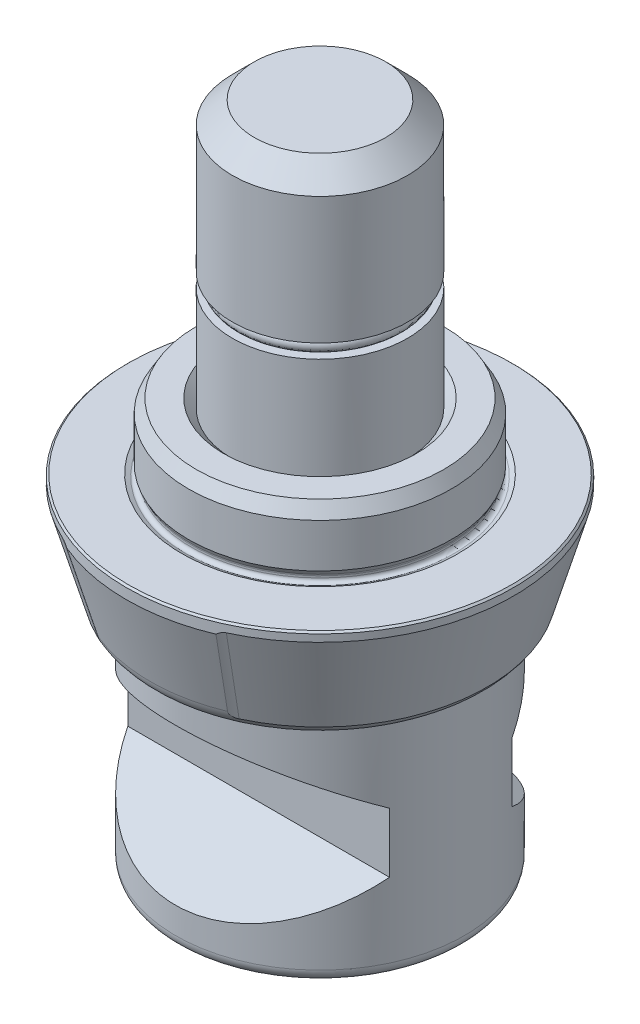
ISO-10303-21;
HEADER;
FILE_DESCRIPTION(('STEP AP214'),'2;1');
FILE_NAME('part.step','',(''),(''),'','','');
FILE_SCHEMA(('AUTOMOTIVE_DESIGN { 1 0 10303 214 1 1 1 1 }'));
ENDSEC;
DATA;
#1=APPLICATION_CONTEXT('core data for automotive mechanical design processes');
#2=APPLICATION_PROTOCOL_DEFINITION('international standard','automotive_design',2000,#1);
#3=PRODUCT_CONTEXT('',#1,'mechanical');
#4=PRODUCT('Part','Part','',(#3));
#5=PRODUCT_RELATED_PRODUCT_CATEGORY('part','',(#4));
#6=PRODUCT_DEFINITION_FORMATION('','',#4);
#7=PRODUCT_DEFINITION_CONTEXT('part definition',#1,'design');
#8=PRODUCT_DEFINITION('design','',#6,#7);
#9=PRODUCT_DEFINITION_SHAPE('','',#8);
#10=(LENGTH_UNIT() NAMED_UNIT(*) SI_UNIT(.MILLI.,.METRE.));
#11=(NAMED_UNIT(*) PLANE_ANGLE_UNIT() SI_UNIT($,.RADIAN.));
#12=(NAMED_UNIT(*) SI_UNIT($,.STERADIAN.) SOLID_ANGLE_UNIT());
#13=UNCERTAINTY_MEASURE_WITH_UNIT(LENGTH_MEASURE(1.E-05),#10,'distance_accuracy_value','');
#14=(GEOMETRIC_REPRESENTATION_CONTEXT(3) GLOBAL_UNCERTAINTY_ASSIGNED_CONTEXT((#13)) GLOBAL_UNIT_ASSIGNED_CONTEXT((#10,
#11,#12)) REPRESENTATION_CONTEXT('',''));
#15=CARTESIAN_POINT('',(0.,0.,0.));
#16=DIRECTION('',(0.,0.,1.));
#17=DIRECTION('',(1.,0.,0.));
#18=AXIS2_PLACEMENT_3D('',#15,#16,#17);
#19=CARTESIAN_POINT('',(0.,-13.,0.));
#20=DIRECTION('',(0.,1.,0.));
#21=DIRECTION('',(0.,0.,1.));
#22=AXIS2_PLACEMENT_3D('',#19,#20,#21);
#23=CONICAL_SURFACE('',#22,18.7723099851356,0.279252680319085);
#24=CARTESIAN_POINT('',(0.,-1.3949657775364,0.));
#25=DIRECTION('',(0.,-1.,0.));
#26=DIRECTION('',(0.,0.,-1.));
#27=AXIS2_PLACEMENT_3D('',#24,#25,#26);
#28=CIRCLE('',#27,22.1);
#29=CARTESIAN_POINT('',(8.51349298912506,-1.39496577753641,20.3943726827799));
#30=VERTEX_POINT('',#29);
#31=CARTESIAN_POINT('',(-8.51349298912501,-1.39496577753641,20.3943726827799));
#32=VERTEX_POINT('',#31);
#33=EDGE_CURVE('E1574',#30,#32,#28,.T.);
#34=ORIENTED_EDGE('',*,*,#33,.T.);
#35=CARTESIAN_POINT('',(-8.51351705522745,-1.3947657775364,20.3944247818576));
#36=CARTESIAN_POINT('',(-8.24755369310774,-3.6048860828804,19.818711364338));
#37=CARTESIAN_POINT('',(-7.98176343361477,-5.81499633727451,19.242879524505));
#38=CARTESIAN_POINT('',(-7.60389422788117,-8.95910351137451,18.4235278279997));
#39=CARTESIAN_POINT('',(-7.49167309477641,-9.89310868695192,18.1801052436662));
#40=CARTESIAN_POINT('',(-7.37948287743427,-10.827112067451,17.9366615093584));
#41=B_SPLINE_CURVE_WITH_KNOTS('',3,(#35,#36,#37,#38,#39,#40),.UNSPECIFIED.,.F.,.F.,(4,2,4),(0.,
6.89792193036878,9.81304186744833),.UNSPECIFIED.);
#42=CARTESIAN_POINT('',(-7.37950690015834,-10.8269120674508,17.9367136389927));
#43=VERTEX_POINT('',#42);
#44=EDGE_CURVE('E679',#32,#43,#41,.T.);
#45=ORIENTED_EDGE('',*,*,#44,.T.);
#46=CARTESIAN_POINT('',(0.,-10.826912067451,0.));
#47=DIRECTION('',(0.,-1.,0.));
#48=DIRECTION('',(0.,0.,-1.));
#49=AXIS2_PLACEMENT_3D('',#46,#47,#48);
#50=CIRCLE('',#49,19.3954329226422);
#51=CARTESIAN_POINT('',(7.37950690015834,-10.826912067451,17.9367136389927));
#52=VERTEX_POINT('',#51);
#53=EDGE_CURVE('E573',#43,#52,#50,.F.);
#54=ORIENTED_EDGE('',*,*,#53,.T.);
#55=CARTESIAN_POINT('',(7.37948287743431,-10.827112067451,17.9366615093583));
#56=CARTESIAN_POINT('',(7.56831744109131,-9.25506429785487,18.3464058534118));
#57=CARTESIAN_POINT('',(7.75723757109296,-7.68301155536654,18.7560916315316));
#58=CARTESIAN_POINT('',(8.13524896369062,-4.53889612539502,19.5753460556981));
#59=CARTESIAN_POINT('',(8.32434022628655,-2.96683343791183,19.9849147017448));
#60=CARTESIAN_POINT('',(8.51351705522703,-1.3947657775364,20.3944247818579));
#61=B_SPLINE_CURVE_WITH_KNOTS('',3,(#55,#56,#57,#58,#59,#60),.UNSPECIFIED.,.F.,.F.,(4,2,4),(0.,
4.90652093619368,9.81304186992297),.UNSPECIFIED.);
#62=EDGE_CURVE('E701',#52,#30,#61,.T.);
#63=ORIENTED_EDGE('',*,*,#62,.T.);
#64=EDGE_LOOP('',(#34,#45,#54,#63));
#65=FACE_BOUND('',#64,.T.);
#66=ADVANCED_FACE('F16',(#65),#23,.T.);
#67=CARTESIAN_POINT('',(0.,0.,0.));
#68=DIRECTION('',(0.,-1.,0.));
#69=DIRECTION('',(0.,0.,-1.));
#70=AXIS2_PLACEMENT_3D('',#67,#68,#69);
#71=CYLINDRICAL_SURFACE('',#70,22.1);
#72=CARTESIAN_POINT('',(0.,-0.199999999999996,0.));
#73=DIRECTION('',(0.,1.,0.));
#74=DIRECTION('',(0.,0.,1.));
#75=AXIS2_PLACEMENT_3D('',#72,#73,#74);
#76=CIRCLE('',#75,22.1);
#77=CARTESIAN_POINT('',(0.,-0.199999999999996,22.1));
#78=VERTEX_POINT('',#77);
#79=EDGE_CURVE('E590',#78,#78,#76,.F.);
#80=ORIENTED_EDGE('',*,*,#79,.T.);
#81=EDGE_LOOP('',(#80));
#82=FACE_BOUND('',#81,.T.);
#83=CARTESIAN_POINT('',(0.,-1.03217024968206,0.));
#84=DIRECTION('',(0.,1.,0.));
#85=DIRECTION('',(0.,0.,1.));
#86=AXIS2_PLACEMENT_3D('',#83,#84,#85);
#87=CIRCLE('',#86,22.1);
#88=CARTESIAN_POINT('',(-9.3398635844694,-1.03217024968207,-20.02940209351));
#89=VERTEX_POINT('',#88);
#90=CARTESIAN_POINT('',(-9.3398635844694,-1.03217024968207,20.02940209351));
#91=VERTEX_POINT('',#90);
#92=EDGE_CURVE('E1547',#89,#91,#87,.T.);
#93=ORIENTED_EDGE('',*,*,#92,.T.);
#94=CARTESIAN_POINT('',(-10.1506280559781,-1.39496577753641,19.6309640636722));
#95=CARTESIAN_POINT('',(-10.097135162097,-1.34633121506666,19.6586212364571));
#96=CARTESIAN_POINT('',(-10.0411826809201,-1.30047984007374,19.6872777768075));
#97=CARTESIAN_POINT('',(-9.92349290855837,-1.21648741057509,19.7468664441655));
#98=CARTESIAN_POINT('',(-9.86168347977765,-1.17846784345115,19.7778255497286));
#99=CARTESIAN_POINT('',(-9.73243072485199,-1.11358922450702,19.8417490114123));
#100=CARTESIAN_POINT('',(-9.66494496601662,-1.08682524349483,19.8747278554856));
#101=CARTESIAN_POINT('',(-9.52658153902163,-1.04841254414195,19.9414159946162));
#102=CARTESIAN_POINT('',(-9.45573000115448,-1.03666246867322,19.9751188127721));
#103=CARTESIAN_POINT('',(-9.32058549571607,-1.03017430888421,20.0385044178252));
#104=CARTESIAN_POINT('',(-9.25639363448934,-1.0337645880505,20.0682345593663));
#105=CARTESIAN_POINT('',(-9.12928394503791,-1.05374959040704,20.1263777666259));
#106=CARTESIAN_POINT('',(-9.06636988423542,-1.07017774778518,20.1547871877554));
#107=CARTESIAN_POINT('',(-8.93009267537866,-1.11879338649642,20.2155925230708));
#108=CARTESIAN_POINT('',(-8.8574800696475,-1.15365492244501,20.2474883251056));
#109=CARTESIAN_POINT('',(-8.71800848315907,-1.23537421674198,20.307933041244));
#110=CARTESIAN_POINT('',(-8.65115371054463,-1.28224065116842,20.3364795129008));
#111=CARTESIAN_POINT('',(-8.5621500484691,-1.35327733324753,20.3740106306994));
#112=CARTESIAN_POINT('',(-8.53760965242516,-1.37385098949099,20.3843048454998));
#113=CARTESIAN_POINT('',(-8.51349298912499,-1.39496577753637,20.3943726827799));
#114=B_SPLINE_CURVE_WITH_KNOTS('',3,(#94,#95,#96,#97,#98,#99,#100,#101,#102,#103,#104,#105,#106,
#107,#108,#109,#110,#111,#112,#113),.UNSPECIFIED.,.F.,.F.,(4,2,2,2,2,2,2,2,2,4),(0.,
0.232597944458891,0.468569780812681,0.706496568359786,0.942808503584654,1.15406503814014,
1.36587359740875,1.62433285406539,1.8829794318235,1.98383460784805),.UNSPECIFIED.);
#115=EDGE_CURVE('E733',#91,#32,#114,.T.);
#116=ORIENTED_EDGE('',*,*,#115,.T.);
#117=ORIENTED_EDGE('',*,*,#33,.F.);
#118=CARTESIAN_POINT('',(8.51349298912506,-1.39496577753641,20.3943726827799));
#119=CARTESIAN_POINT('',(8.56906418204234,-1.3463312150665,20.371172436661));
#120=CARTESIAN_POINT('',(8.62698192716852,-1.30047984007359,20.3467304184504));
#121=CARTESIAN_POINT('',(8.74827902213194,-1.21648741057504,20.2948776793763));
#122=CARTESIAN_POINT('',(8.81172540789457,-1.17846784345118,20.2674290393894));
#123=CARTESIAN_POINT('',(8.94377568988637,-1.113589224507,20.2095048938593));
#124=CARTESIAN_POINT('',(9.01241795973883,-1.08682524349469,20.1790061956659));
#125=CARTESIAN_POINT('',(9.15244233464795,-1.04841254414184,20.1158799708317));
#126=CARTESIAN_POINT('',(9.223802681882,-1.03666246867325,20.0832682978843));
#127=CARTESIAN_POINT('',(9.3592280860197,-1.03017430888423,20.0204850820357));
#128=CARTESIAN_POINT('',(9.42326442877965,-1.03376458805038,19.9904214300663));
#129=CARTESIAN_POINT('',(9.54950924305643,-1.05374959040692,19.9304234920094));
#130=CARTESIAN_POINT('',(9.61171250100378,-1.07017774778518,19.900489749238));
#131=CARTESIAN_POINT('',(9.74588939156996,-1.11879338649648,19.8351802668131));
#132=CARTESIAN_POINT('',(9.81699747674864,-1.15365492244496,19.8000580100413));
#133=CARTESIAN_POINT('',(9.95295142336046,-1.2353742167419,19.7320696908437));
#134=CARTESIAN_POINT('',(10.0177927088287,-1.28224065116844,19.6992052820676));
#135=CARTESIAN_POINT('',(10.1037536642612,-1.35327733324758,19.6551490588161));
#136=CARTESIAN_POINT('',(10.1274137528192,-1.37385098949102,19.6429670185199));
#137=CARTESIAN_POINT('',(10.1506280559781,-1.39496577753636,19.6309640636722));
#138=B_SPLINE_CURVE_WITH_KNOTS('',3,(#118,#119,#120,#121,#122,#123,#124,#125,#126,#127,#128,
#129,#130,#131,#132,#133,#134,#135,#136,#137),.UNSPECIFIED.,.F.,.F.,(4,2,2,2,2,2,2,2,2,4),(0.,
0.232597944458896,0.468569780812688,0.706496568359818,0.942808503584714,1.1540650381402,
1.36587359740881,1.62433285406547,1.8829794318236,1.98383460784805),.UNSPECIFIED.);
#139=CARTESIAN_POINT('',(9.3398635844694,-1.03217024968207,20.02940209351));
#140=VERTEX_POINT('',#139);
#141=EDGE_CURVE('E678',#30,#140,#138,.T.);
#142=ORIENTED_EDGE('',*,*,#141,.T.);
#143=CARTESIAN_POINT('',(0.,-1.03217024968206,0.));
#144=DIRECTION('',(0.,1.,0.));
#145=DIRECTION('',(0.,0.,1.));
#146=AXIS2_PLACEMENT_3D('',#143,#144,#145);
#147=CIRCLE('',#146,22.1);
#148=CARTESIAN_POINT('',(9.3398635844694,-1.03217024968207,-20.02940209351));
#149=VERTEX_POINT('',#148);
#150=EDGE_CURVE('E1546',#149,#140,#147,.F.);
#151=ORIENTED_EDGE('',*,*,#150,.F.);
#152=CARTESIAN_POINT('',(10.1506280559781,-1.39496577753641,-19.6309640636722));
#153=CARTESIAN_POINT('',(10.097135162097,-1.34633121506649,-19.6586212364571));
#154=CARTESIAN_POINT('',(10.0411826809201,-1.30047984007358,-19.6872777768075));
#155=CARTESIAN_POINT('',(9.92349290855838,-1.21648741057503,-19.7468664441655));
#156=CARTESIAN_POINT('',(9.86168347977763,-1.17846784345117,-19.7778255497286));
#157=CARTESIAN_POINT('',(9.73243072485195,-1.113589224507,-19.8417490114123));
#158=CARTESIAN_POINT('',(9.6649449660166,-1.08682524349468,-19.8747278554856));
#159=CARTESIAN_POINT('',(9.52658153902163,-1.04841254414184,-19.9414159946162));
#160=CARTESIAN_POINT('',(9.45573000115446,-1.03666246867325,-19.9751188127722));
#161=CARTESIAN_POINT('',(9.32058549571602,-1.03017430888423,-20.0385044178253));
#162=CARTESIAN_POINT('',(9.25639363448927,-1.03376458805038,-20.0682345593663));
#163=CARTESIAN_POINT('',(9.12928394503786,-1.05374959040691,-20.1263777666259));
#164=CARTESIAN_POINT('',(9.0663698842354,-1.07017774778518,-20.1547871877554));
#165=CARTESIAN_POINT('',(8.93009267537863,-1.11879338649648,-20.2155925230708));
#166=CARTESIAN_POINT('',(8.85748006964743,-1.15365492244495,-20.2474883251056));
#167=CARTESIAN_POINT('',(8.71800848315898,-1.2353742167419,-20.3079330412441));
#168=CARTESIAN_POINT('',(8.65115371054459,-1.28224065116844,-20.3364795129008));
#169=CARTESIAN_POINT('',(8.5621500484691,-1.35327733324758,-20.3740106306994));
#170=CARTESIAN_POINT('',(8.53760965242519,-1.37385098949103,-20.3843048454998));
#171=CARTESIAN_POINT('',(8.51349298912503,-1.39496577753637,-20.3943726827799));
#172=B_SPLINE_CURVE_WITH_KNOTS('',3,(#152,#153,#154,#155,#156,#157,#158,#159,#160,#161,#162,
#163,#164,#165,#166,#167,#168,#169,#170,#171),.UNSPECIFIED.,.F.,.F.,(4,2,2,2,2,2,2,2,2,4),(0.,
0.232597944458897,0.468569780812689,0.70649656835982,0.942808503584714,1.1540650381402,
1.3658735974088,1.62433285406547,1.8829794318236,1.98383460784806),.UNSPECIFIED.);
#173=CARTESIAN_POINT('',(8.51349298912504,-1.3949657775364,-20.3943726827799));
#174=VERTEX_POINT('',#173);
#175=EDGE_CURVE('E31',#149,#174,#172,.T.);
#176=ORIENTED_EDGE('',*,*,#175,.T.);
#177=CARTESIAN_POINT('',(-8.51349298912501,-1.3949657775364,-20.3943726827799));
#178=VERTEX_POINT('',#177);
#179=EDGE_CURVE('E1573',#178,#174,#28,.T.);
#180=ORIENTED_EDGE('',*,*,#179,.F.);
#181=CARTESIAN_POINT('',(-8.51349298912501,-1.39496577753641,-20.3943726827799));
#182=CARTESIAN_POINT('',(-8.56906418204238,-1.34633121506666,-20.371172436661));
#183=CARTESIAN_POINT('',(-8.62698192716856,-1.30047984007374,-20.3467304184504));
#184=CARTESIAN_POINT('',(-8.74827902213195,-1.2164874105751,-20.2948776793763));
#185=CARTESIAN_POINT('',(-8.81172540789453,-1.17846784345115,-20.2674290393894));
#186=CARTESIAN_POINT('',(-8.94377568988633,-1.11358922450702,-20.2095048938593));
#187=CARTESIAN_POINT('',(-9.01241795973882,-1.08682524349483,-20.1790061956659));
#188=CARTESIAN_POINT('',(-9.15244233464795,-1.04841254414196,-20.1158799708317));
#189=CARTESIAN_POINT('',(-9.22380268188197,-1.03666246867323,-20.0832682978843));
#190=CARTESIAN_POINT('',(-9.35922808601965,-1.03017430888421,-20.0204850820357));
#191=CARTESIAN_POINT('',(-9.4232644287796,-1.03376458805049,-19.9904214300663));
#192=CARTESIAN_POINT('',(-9.5495092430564,-1.05374959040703,-19.9304234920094));
#193=CARTESIAN_POINT('',(-9.61171250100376,-1.07017774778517,-19.900489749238));
#194=CARTESIAN_POINT('',(-9.74588939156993,-1.11879338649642,-19.8351802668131));
#195=CARTESIAN_POINT('',(-9.81699747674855,-1.15365492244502,-19.8000580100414));
#196=CARTESIAN_POINT('',(-9.95295142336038,-1.23537421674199,-19.7320696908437));
#197=CARTESIAN_POINT('',(-10.0177927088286,-1.28224065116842,-19.6992052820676));
#198=CARTESIAN_POINT('',(-10.1037536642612,-1.35327733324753,-19.6551490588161));
#199=CARTESIAN_POINT('',(-10.1274137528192,-1.373850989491,-19.6429670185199));
#200=CARTESIAN_POINT('',(-10.1506280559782,-1.39496577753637,-19.6309640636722));
#201=B_SPLINE_CURVE_WITH_KNOTS('',3,(#181,#182,#183,#184,#185,#186,#187,#188,#189,#190,#191,
#192,#193,#194,#195,#196,#197,#198,#199,#200),.UNSPECIFIED.,.F.,.F.,(4,2,2,2,2,2,2,2,2,4),(0.,
0.232597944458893,0.468569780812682,0.706496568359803,0.942808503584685,1.15406503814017,
1.36587359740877,1.6243328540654,1.88297943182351,1.98383460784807),.UNSPECIFIED.);
#202=EDGE_CURVE('E713',#178,#89,#201,.T.);
#203=ORIENTED_EDGE('',*,*,#202,.T.);
#204=EDGE_LOOP('',(#93,#116,#117,#142,#151,#176,#180,#203));
#205=FACE_BOUND('',#204,.T.);
#206=ADVANCED_FACE('F535',(#82,#205),#71,.T.);
#207=CARTESIAN_POINT('',(0.,-10.,0.));
#208=DIRECTION('',(0.,-1.,0.));
#209=DIRECTION('',(0.,0.,-1.));
#210=AXIS2_PLACEMENT_3D('',#207,#208,#209);
#211=TOROIDAL_SURFACE('',#210,16.5116478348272,3.);
#212=CARTESIAN_POINT('',(0.,-13.,0.));
#213=DIRECTION('',(0.,-1.,0.));
#214=DIRECTION('',(0.,0.,-1.));
#215=AXIS2_PLACEMENT_3D('',#212,#213,#214);
#216=CIRCLE('',#215,16.5116478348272);
#217=CARTESIAN_POINT('',(0.,-13.,-16.5116478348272));
#218=VERTEX_POINT('',#217);
#219=EDGE_CURVE('E578',#218,#218,#216,.T.);
#220=ORIENTED_EDGE('',*,*,#219,.F.);
#221=EDGE_LOOP('',(#220));
#222=FACE_BOUND('',#221,.T.);
#223=ORIENTED_EDGE('',*,*,#53,.F.);
#224=CARTESIAN_POINT('',(-7.37953094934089,-10.826712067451,17.9367657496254));
#225=CARTESIAN_POINT('',(-7.37448321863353,-10.8681473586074,17.9260413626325));
#226=CARTESIAN_POINT('',(-7.37298862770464,-10.9092972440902,17.912814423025));
#227=CARTESIAN_POINT('',(-7.37685378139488,-10.9894585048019,17.8822708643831));
#228=CARTESIAN_POINT('',(-7.38217500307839,-11.0284806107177,17.8649776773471));
#229=CARTESIAN_POINT('',(-7.39936177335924,-11.1032850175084,17.8270927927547));
#230=CARTESIAN_POINT('',(-7.41122208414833,-11.1390698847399,17.8065037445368));
#231=CARTESIAN_POINT('',(-7.44088594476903,-11.2065689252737,17.7630486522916));
#232=CARTESIAN_POINT('',(-7.45869399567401,-11.2382799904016,17.7401808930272));
#233=CARTESIAN_POINT('',(-7.49857981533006,-11.2957275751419,17.6942723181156));
#234=CARTESIAN_POINT('',(-7.52042758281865,-11.3216696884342,17.6712862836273));
#235=CARTESIAN_POINT('',(-7.5681695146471,-11.3691284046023,17.6249804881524));
#236=CARTESIAN_POINT('',(-7.59406421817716,-11.3906444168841,17.6016606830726));
#237=CARTESIAN_POINT('',(-7.65315662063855,-11.4319505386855,17.5520688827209));
#238=CARTESIAN_POINT('',(-7.68686921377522,-11.4510633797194,17.5258471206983));
#239=CARTESIAN_POINT('',(-7.75780102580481,-11.4835576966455,17.4746306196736));
#240=CARTESIAN_POINT('',(-7.79502230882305,-11.4969357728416,17.4496366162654));
#241=CARTESIAN_POINT('',(-7.8777057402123,-11.5196052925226,17.3980217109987));
#242=CARTESIAN_POINT('',(-7.92358307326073,-11.5280318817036,17.3716840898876));
#243=CARTESIAN_POINT('',(-8.01772265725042,-11.5376846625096,17.3221135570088));
#244=CARTESIAN_POINT('',(-8.0659862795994,-11.5389066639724,17.2988824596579));
#245=CARTESIAN_POINT('',(-8.16829973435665,-11.5339457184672,17.2540974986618));
#246=CARTESIAN_POINT('',(-8.22247261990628,-11.527069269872,17.2328960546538));
#247=CARTESIAN_POINT('',(-8.33076831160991,-11.5045863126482,17.1954335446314));
#248=CARTESIAN_POINT('',(-8.38489108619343,-11.4889760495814,17.1791746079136));
#249=CARTESIAN_POINT('',(-8.4902058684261,-11.4491378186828,17.1523329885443));
#250=CARTESIAN_POINT('',(-8.54143314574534,-11.4250705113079,17.1416531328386));
#251=CARTESIAN_POINT('',(-8.63966746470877,-11.3681395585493,17.1258955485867));
#252=CARTESIAN_POINT('',(-8.68668306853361,-11.3352943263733,17.1208062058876));
#253=CARTESIAN_POINT('',(-8.76185338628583,-11.2713027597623,17.1169503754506));
#254=CARTESIAN_POINT('',(-8.79164847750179,-11.2421515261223,17.1168346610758));
#255=CARTESIAN_POINT('',(-8.84646221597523,-11.1797473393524,17.1195647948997));
#256=CARTESIAN_POINT('',(-8.87148200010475,-11.1464953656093,17.1224099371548));
#257=CARTESIAN_POINT('',(-8.91573408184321,-11.0764013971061,17.1309367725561));
#258=CARTESIAN_POINT('',(-8.93493494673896,-11.0395412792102,17.1366334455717));
#259=CARTESIAN_POINT('',(-8.96637582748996,-10.963475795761,17.1506015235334));
#260=CARTESIAN_POINT('',(-8.97863052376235,-10.9242755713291,17.158867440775));
#261=CARTESIAN_POINT('',(-8.9912844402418,-10.8653787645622,17.1727660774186));
#262=CARTESIAN_POINT('',(-8.9945379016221,-10.8460634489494,17.1775544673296));
#263=CARTESIAN_POINT('',(-8.99688867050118,-10.8267120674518,17.182579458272));
#264=B_SPLINE_CURVE_WITH_KNOTS('',3,(#224,#225,#226,#227,#228,#229,#230,#231,#232,#233,#234,
#235,#236,#237,#238,#239,#240,#241,#242,#243,#244,#245,#246,#247,#248,#249,#250,#251,#252,#253,
#254,#255,#256,#257,#258,#259,#260,#261,#262,#263),.UNSPECIFIED.,.F.,.F.,(4,2,2,2,2,2,2,2,2,2,2,
2,2,2,2,2,2,2,2,4),(0.,0.128987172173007,0.257248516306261,0.385407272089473,0.513663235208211,
0.636108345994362,0.758569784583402,0.898394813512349,1.03830261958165,1.19833902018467,
1.35846848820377,1.53336981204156,1.70834637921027,1.88016414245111,2.051624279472,
2.17616001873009,2.30066607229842,2.42583316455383,2.55073472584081,2.61114030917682),.UNSPECIFIED.);
#265=CARTESIAN_POINT('',(-8.06676228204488,-11.5377074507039,17.2992275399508));
#266=VERTEX_POINT('',#265);
#267=EDGE_CURVE('E739',#43,#266,#264,.T.);
#268=ORIENTED_EDGE('',*,*,#267,.T.);
#269=CARTESIAN_POINT('',(0.,-11.5377074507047,0.));
#270=DIRECTION('',(0.,1.,0.));
#271=DIRECTION('',(0.,0.,1.));
#272=AXIS2_PLACEMENT_3D('',#269,#270,#271);
#273=CIRCLE('',#272,19.0875856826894);
#274=CARTESIAN_POINT('',(-8.06676228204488,-11.5377074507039,-17.2992275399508));
#275=VERTEX_POINT('',#274);
#276=EDGE_CURVE('E599',#266,#275,#273,.F.);
#277=ORIENTED_EDGE('',*,*,#276,.T.);
#278=CARTESIAN_POINT('',(-8.99688867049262,-10.826712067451,-17.1825794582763));
#279=CARTESIAN_POINT('',(-8.99191793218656,-10.8681473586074,-17.171819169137));
#280=CARTESIAN_POINT('',(-8.98274621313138,-10.9092972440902,-17.1621721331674));
#281=CARTESIAN_POINT('',(-8.95686401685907,-10.9894585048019,-17.1454999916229));
#282=CARTESIAN_POINT('',(-8.94019625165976,-11.0284806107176,-17.1384604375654));
#283=CARTESIAN_POINT('',(-8.90012730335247,-11.1032850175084,-17.1272743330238));
#284=CARTESIAN_POINT('',(-8.87673151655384,-11.1390698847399,-17.1231254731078));
#285=CARTESIAN_POINT('',(-8.82437542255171,-11.2065689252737,-17.1179169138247));
#286=CARTESIAN_POINT('',(-8.79541090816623,-11.2382799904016,-17.1168595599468));
#287=CARTESIAN_POINT('',(-8.73460478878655,-11.2957275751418,-17.117904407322));
#288=CARTESIAN_POINT('',(-8.70295299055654,-11.3216696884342,-17.1198656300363));
#289=CARTESIAN_POINT('',(-8.63679277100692,-11.3691284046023,-17.1266732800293));
#290=CARTESIAN_POINT('',(-8.60228396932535,-11.3906444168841,-17.1315200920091));
#291=CARTESIAN_POINT('',(-8.52631058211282,-11.4319505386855,-17.1449105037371));
#292=CARTESIAN_POINT('',(-8.48455350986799,-11.4510633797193,-17.1538808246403));
#293=CARTESIAN_POINT('',(-8.39972530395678,-11.4835576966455,-17.1752964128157));
#294=CARTESIAN_POINT('',(-8.35665340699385,-11.4969357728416,-17.1877437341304));
#295=CARTESIAN_POINT('',(-8.26396621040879,-11.5196052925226,-17.2179054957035));
#296=CARTESIAN_POINT('',(-8.21430104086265,-11.5280318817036,-17.2361200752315));
#297=CARTESIAN_POINT('',(-8.1158160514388,-11.5376846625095,-17.2763718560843));
#298=CARTESIAN_POINT('',(-8.06699673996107,-11.5389066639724,-17.298411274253));
#299=CARTESIAN_POINT('',(-7.96692364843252,-11.5339457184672,-17.3480007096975));
#300=CARTESIAN_POINT('',(-7.91586074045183,-11.527069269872,-17.3758715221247));
#301=CARTESIAN_POINT('',(-7.81755166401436,-11.5045863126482,-17.4347503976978));
#302=CARTESIAN_POINT('',(-7.77030714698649,-11.4889760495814,-17.4657598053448));
#303=CARTESIAN_POINT('',(-7.68205023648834,-11.4491378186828,-17.5291821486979));
#304=CARTESIAN_POINT('',(-7.64094073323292,-11.4250705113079,-17.5615596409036));
#305=CARTESIAN_POINT('',(-7.56572592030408,-11.3681395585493,-17.6266827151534));
#306=CARTESIAN_POINT('',(-7.53160621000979,-11.3352943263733,-17.6594273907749));
#307=CARTESIAN_POINT('',(-7.48033392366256,-11.2713027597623,-17.7145327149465));
#308=CARTESIAN_POINT('',(-7.46109336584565,-11.2421515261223,-17.7372826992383));
#309=CARTESIAN_POINT('',(-7.4279511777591,-11.1797473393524,-17.7810273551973));
#310=CARTESIAN_POINT('',(-7.41404827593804,-11.1464953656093,-17.8020224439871));
#311=CARTESIAN_POINT('',(-7.39213552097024,-11.0764013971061,-17.8414024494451));
#312=CARTESIAN_POINT('',(-7.38415734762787,-11.0395412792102,-17.8597729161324));
#313=CARTESIAN_POINT('',(-7.37464770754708,-10.963475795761,-17.8928365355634));
#314=CARTESIAN_POINT('',(-7.37310260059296,-10.9242755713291,-17.9075374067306));
#315=CARTESIAN_POINT('',(-7.37561579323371,-10.8653787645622,-17.9261647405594));
#316=CARTESIAN_POINT('',(-7.37719262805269,-10.8460634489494,-17.9317349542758));
#317=CARTESIAN_POINT('',(-7.37953094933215,-10.8267120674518,-17.9367657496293));
#318=B_SPLINE_CURVE_WITH_KNOTS('',3,(#278,#279,#280,#281,#282,#283,#284,#285,#286,#287,#288,
#289,#290,#291,#292,#293,#294,#295,#296,#297,#298,#299,#300,#301,#302,#303,#304,#305,#306,#307,
#308,#309,#310,#311,#312,#313,#314,#315,#316,#317),.UNSPECIFIED.,.F.,.F.,(4,2,2,2,2,2,2,2,2,2,2,
2,2,2,2,2,2,2,2,4),(0.,0.128987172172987,0.257248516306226,0.385407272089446,0.513663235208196,
0.636108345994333,0.758569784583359,0.898394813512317,1.03830261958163,1.19833902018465,
1.35846848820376,1.53336981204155,1.70834637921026,1.88016414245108,2.05162427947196,
2.17616001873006,2.30066607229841,2.4258331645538,2.55073472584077,2.6111403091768),.UNSPECIFIED.);
#319=CARTESIAN_POINT('',(-7.37950690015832,-10.826912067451,-17.9367136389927));
#320=VERTEX_POINT('',#319);
#321=EDGE_CURVE('E39',#275,#320,#318,.T.);
#322=ORIENTED_EDGE('',*,*,#321,.T.);
#323=CARTESIAN_POINT('',(7.37950690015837,-10.8269120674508,-17.9367136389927));
#324=VERTEX_POINT('',#323);
#325=EDGE_CURVE('E566',#324,#320,#50,.F.);
#326=ORIENTED_EDGE('',*,*,#325,.F.);
#327=CARTESIAN_POINT('',(7.37953094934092,-10.826712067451,-17.9367657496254));
#328=CARTESIAN_POINT('',(7.37448321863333,-10.8681473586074,-17.9260413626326));
#329=CARTESIAN_POINT('',(7.37298862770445,-10.9092972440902,-17.9128144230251));
#330=CARTESIAN_POINT('',(7.37685378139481,-10.9894585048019,-17.8822708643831));
#331=CARTESIAN_POINT('',(7.38217500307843,-11.0284806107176,-17.8649776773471));
#332=CARTESIAN_POINT('',(7.39936177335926,-11.1032850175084,-17.8270927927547));
#333=CARTESIAN_POINT('',(7.41122208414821,-11.13906988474,-17.8065037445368));
#334=CARTESIAN_POINT('',(7.44088594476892,-11.2065689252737,-17.7630486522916));
#335=CARTESIAN_POINT('',(7.45869399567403,-11.2382799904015,-17.7401808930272));
#336=CARTESIAN_POINT('',(7.49857981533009,-11.2957275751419,-17.6942723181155));
#337=CARTESIAN_POINT('',(7.52042758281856,-11.3216696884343,-17.6712862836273));
#338=CARTESIAN_POINT('',(7.56816951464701,-11.3691284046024,-17.6249804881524));
#339=CARTESIAN_POINT('',(7.59406421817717,-11.3906444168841,-17.6016606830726));
#340=CARTESIAN_POINT('',(7.6531566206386,-11.4319505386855,-17.5520688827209));
#341=CARTESIAN_POINT('',(7.68686921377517,-11.4510633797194,-17.5258471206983));
#342=CARTESIAN_POINT('',(7.75780102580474,-11.4835576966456,-17.4746306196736));
#343=CARTESIAN_POINT('',(7.79502230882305,-11.4969357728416,-17.4496366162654));
#344=CARTESIAN_POINT('',(7.87770574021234,-11.5196052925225,-17.3980217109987));
#345=CARTESIAN_POINT('',(7.92358307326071,-11.5280318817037,-17.3716840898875));
#346=CARTESIAN_POINT('',(8.01772265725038,-11.5376846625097,-17.3221135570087));
#347=CARTESIAN_POINT('',(8.06598627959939,-11.5389066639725,-17.2988824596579));
#348=CARTESIAN_POINT('',(8.16829973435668,-11.5339457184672,-17.2540974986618));
#349=CARTESIAN_POINT('',(8.2224726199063,-11.5270692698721,-17.2328960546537));
#350=CARTESIAN_POINT('',(8.33076831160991,-11.5045863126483,-17.1954335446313));
#351=CARTESIAN_POINT('',(8.38489108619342,-11.4889760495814,-17.1791746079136));
#352=CARTESIAN_POINT('',(8.49020586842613,-11.4491378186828,-17.1523329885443));
#353=CARTESIAN_POINT('',(8.54143314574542,-11.425070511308,-17.1416531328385));
#354=CARTESIAN_POINT('',(8.63966746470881,-11.3681395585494,-17.1258955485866));
#355=CARTESIAN_POINT('',(8.68668306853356,-11.3352943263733,-17.1208062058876));
#356=CARTESIAN_POINT('',(8.76185338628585,-11.2713027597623,-17.1169503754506));
#357=CARTESIAN_POINT('',(8.79164847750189,-11.2421515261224,-17.1168346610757));
#358=CARTESIAN_POINT('',(8.84646221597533,-11.1797473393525,-17.1195647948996));
#359=CARTESIAN_POINT('',(8.87148200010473,-11.1464953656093,-17.1224099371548));
#360=CARTESIAN_POINT('',(8.91573408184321,-11.0764013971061,-17.1309367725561));
#361=CARTESIAN_POINT('',(8.9349349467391,-11.0395412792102,-17.1366334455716));
#362=CARTESIAN_POINT('',(8.9663758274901,-10.9634757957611,-17.1506015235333));
#363=CARTESIAN_POINT('',(8.97863052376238,-10.9242755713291,-17.158867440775));
#364=CARTESIAN_POINT('',(8.99128444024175,-10.8653787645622,-17.1727660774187));
#365=CARTESIAN_POINT('',(8.99453790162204,-10.8460634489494,-17.1775544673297));
#366=CARTESIAN_POINT('',(8.99688867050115,-10.8267120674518,-17.182579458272));
#367=B_SPLINE_CURVE_WITH_KNOTS('',3,(#327,#328,#329,#330,#331,#332,#333,#334,#335,#336,#337,
#338,#339,#340,#341,#342,#343,#344,#345,#346,#347,#348,#349,#350,#351,#352,#353,#354,#355,#356,
#357,#358,#359,#360,#361,#362,#363,#364,#365,#366),.UNSPECIFIED.,.F.,.F.,(4,2,2,2,2,2,2,2,2,2,2,
2,2,2,2,2,2,2,2,4),(0.,0.128987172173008,0.25724851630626,0.38540727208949,0.513663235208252,
0.636108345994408,0.758569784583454,0.898394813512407,1.03830261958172,1.19833902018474,
1.35846848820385,1.53336981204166,1.70834637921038,1.88016414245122,2.05162427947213,
2.17616001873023,2.30066607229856,2.42583316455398,2.55073472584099,2.61114030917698),.UNSPECIFIED.);
#368=CARTESIAN_POINT('',(8.06676228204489,-11.5377074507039,-17.2992275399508));
#369=VERTEX_POINT('',#368);
#370=EDGE_CURVE('E650',#324,#369,#367,.T.);
#371=ORIENTED_EDGE('',*,*,#370,.T.);
#372=CARTESIAN_POINT('',(0.,-11.5377074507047,0.));
#373=DIRECTION('',(0.,1.,0.));
#374=DIRECTION('',(0.,0.,1.));
#375=AXIS2_PLACEMENT_3D('',#372,#373,#374);
#376=CIRCLE('',#375,19.0875856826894);
#377=CARTESIAN_POINT('',(8.06676228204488,-11.5377074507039,17.2992275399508));
#378=VERTEX_POINT('',#377);
#379=EDGE_CURVE('E596',#378,#369,#376,.T.);
#380=ORIENTED_EDGE('',*,*,#379,.F.);
#381=CARTESIAN_POINT('',(8.99688867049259,-10.826712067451,17.1825794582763));
#382=CARTESIAN_POINT('',(8.99191793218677,-10.8681473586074,17.1718191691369));
#383=CARTESIAN_POINT('',(8.98274621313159,-10.9092972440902,17.1621721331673));
#384=CARTESIAN_POINT('',(8.95686401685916,-10.9894585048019,17.1454999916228));
#385=CARTESIAN_POINT('',(8.94019625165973,-11.0284806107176,17.1384604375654));
#386=CARTESIAN_POINT('',(8.90012730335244,-11.1032850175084,17.1272743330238));
#387=CARTESIAN_POINT('',(8.87673151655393,-11.13906988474,17.1231254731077));
#388=CARTESIAN_POINT('',(8.8243754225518,-11.2065689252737,17.1179169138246));
#389=CARTESIAN_POINT('',(8.7954109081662,-11.2382799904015,17.1168595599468));
#390=CARTESIAN_POINT('',(8.7346047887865,-11.2957275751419,17.117904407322));
#391=CARTESIAN_POINT('',(8.70295299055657,-11.3216696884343,17.1198656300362));
#392=CARTESIAN_POINT('',(8.63679277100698,-11.3691284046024,17.1266732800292));
#393=CARTESIAN_POINT('',(8.60228396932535,-11.3906444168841,17.1315200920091));
#394=CARTESIAN_POINT('',(8.52631058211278,-11.4319505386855,17.1449105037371));
#395=CARTESIAN_POINT('',(8.48455350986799,-11.4510633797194,17.1538808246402));
#396=CARTESIAN_POINT('',(8.3997253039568,-11.4835576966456,17.1752964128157));
#397=CARTESIAN_POINT('',(8.35665340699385,-11.4969357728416,17.1877437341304));
#398=CARTESIAN_POINT('',(8.26396621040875,-11.5196052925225,17.2179054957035));
#399=CARTESIAN_POINT('',(8.21430104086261,-11.5280318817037,17.2361200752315));
#400=CARTESIAN_POINT('',(8.11581605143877,-11.5376846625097,17.2763718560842));
#401=CARTESIAN_POINT('',(8.06699673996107,-11.5389066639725,17.298411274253));
#402=CARTESIAN_POINT('',(7.9669236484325,-11.5339457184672,17.3480007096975));
#403=CARTESIAN_POINT('',(7.91586074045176,-11.5270692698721,17.3758715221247));
#404=CARTESIAN_POINT('',(7.81755166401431,-11.5045863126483,17.4347503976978));
#405=CARTESIAN_POINT('',(7.77030714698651,-11.4889760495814,17.4657598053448));
#406=CARTESIAN_POINT('',(7.68205023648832,-11.4491378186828,17.529182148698));
#407=CARTESIAN_POINT('',(7.64094073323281,-11.425070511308,17.5615596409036));
#408=CARTESIAN_POINT('',(7.565725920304,-11.3681395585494,17.6266827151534));
#409=CARTESIAN_POINT('',(7.53160621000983,-11.3352943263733,17.6594273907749));
#410=CARTESIAN_POINT('',(7.48033392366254,-11.2713027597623,17.7145327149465));
#411=CARTESIAN_POINT('',(7.46109336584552,-11.2421515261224,17.7372826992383));
#412=CARTESIAN_POINT('',(7.427951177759,-11.1797473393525,17.7810273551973));
#413=CARTESIAN_POINT('',(7.41404827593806,-11.1464953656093,17.8020224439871));
#414=CARTESIAN_POINT('',(7.39213552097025,-11.0764013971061,17.8414024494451));
#415=CARTESIAN_POINT('',(7.38415734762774,-11.0395412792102,17.8597729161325));
#416=CARTESIAN_POINT('',(7.37464770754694,-10.9634757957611,17.8928365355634));
#417=CARTESIAN_POINT('',(7.37310260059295,-10.9242755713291,17.9075374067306));
#418=CARTESIAN_POINT('',(7.37561579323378,-10.8653787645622,17.9261647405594));
#419=CARTESIAN_POINT('',(7.37719262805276,-10.8460634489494,17.9317349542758));
#420=CARTESIAN_POINT('',(7.37953094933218,-10.8267120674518,17.9367657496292));
#421=B_SPLINE_CURVE_WITH_KNOTS('',3,(#381,#382,#383,#384,#385,#386,#387,#388,#389,#390,#391,
#392,#393,#394,#395,#396,#397,#398,#399,#400,#401,#402,#403,#404,#405,#406,#407,#408,#409,#410,
#411,#412,#413,#414,#415,#416,#417,#418,#419,#420),.UNSPECIFIED.,.F.,.F.,(4,2,2,2,2,2,2,2,2,2,2,
2,2,2,2,2,2,2,2,4),(0.,0.128987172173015,0.257248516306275,0.385407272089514,0.513663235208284,
0.636108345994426,0.758569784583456,0.89839481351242,1.03830261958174,1.19833902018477,
1.35846848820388,1.53336981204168,1.7083463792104,1.88016414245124,2.05162427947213,
2.17616001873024,2.30066607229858,2.425833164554,2.55073472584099,2.61114030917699),.UNSPECIFIED.);
#422=EDGE_CURVE('E669',#378,#52,#421,.T.);
#423=ORIENTED_EDGE('',*,*,#422,.T.);
#424=EDGE_LOOP('',(#223,#268,#277,#322,#326,#371,#380,#423));
#425=FACE_BOUND('',#424,.T.);
#426=ADVANCED_FACE('F544',(#222,#425),#211,.T.);
#427=ORIENTED_EDGE('',*,*,#325,.T.);
#428=CARTESIAN_POINT('',(-7.37948287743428,-10.827112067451,-17.9366615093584));
#429=CARTESIAN_POINT('',(-7.56831744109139,-9.25506429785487,-18.3464058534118));
#430=CARTESIAN_POINT('',(-7.75723757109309,-7.68301155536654,-18.7560916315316));
#431=CARTESIAN_POINT('',(-8.13524896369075,-4.53889612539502,-19.575346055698));
#432=CARTESIAN_POINT('',(-8.32434022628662,-2.96683343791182,-19.9849147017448));
#433=CARTESIAN_POINT('',(-8.513517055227,-1.39476577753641,-20.3944247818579));
#434=B_SPLINE_CURVE_WITH_KNOTS('',3,(#428,#429,#430,#431,#432,#433),.UNSPECIFIED.,.F.,.F.,(4,2,
4),(0.,4.90652093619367,9.81304186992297),.UNSPECIFIED.);
#435=EDGE_CURVE('E567',#320,#178,#434,.T.);
#436=ORIENTED_EDGE('',*,*,#435,.T.);
#437=ORIENTED_EDGE('',*,*,#179,.T.);
#438=CARTESIAN_POINT('',(8.51351705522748,-1.3947657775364,-20.3944247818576));
#439=CARTESIAN_POINT('',(8.24755369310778,-3.60488608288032,-19.818711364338));
#440=CARTESIAN_POINT('',(7.98176343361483,-5.81499633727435,-19.2428795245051));
#441=CARTESIAN_POINT('',(7.60389422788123,-8.95910351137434,-18.4235278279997));
#442=CARTESIAN_POINT('',(7.49167309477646,-9.89310868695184,-18.1801052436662));
#443=CARTESIAN_POINT('',(7.37948287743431,-10.827112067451,-17.9366615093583));
#444=B_SPLINE_CURVE_WITH_KNOTS('',3,(#438,#439,#440,#441,#442,#443),.UNSPECIFIED.,.F.,.F.,(4,2,
4),(0.,6.89792193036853,9.81304186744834),.UNSPECIFIED.);
#445=EDGE_CURVE('E569',#174,#324,#444,.T.);
#446=ORIENTED_EDGE('',*,*,#445,.T.);
#447=EDGE_LOOP('',(#427,#436,#437,#446));
#448=FACE_BOUND('',#447,.T.);
#449=ADVANCED_FACE('F538',(#448),#23,.T.);
#450=CARTESIAN_POINT('',(0.,0.,0.));
#451=DIRECTION('',(0.,-1.,0.));
#452=DIRECTION('',(0.,0.,-1.));
#453=AXIS2_PLACEMENT_3D('',#450,#451,#452);
#454=CYLINDRICAL_SURFACE('',#453,15.);
#455=CARTESIAN_POINT('',(0.,1.,0.));
#456=DIRECTION('',(0.,-1.,0.));
#457=DIRECTION('',(0.,0.,-1.));
#458=AXIS2_PLACEMENT_3D('',#455,#456,#457);
#459=CIRCLE('',#458,15.);
#460=CARTESIAN_POINT('',(0.,1.,-15.));
#461=VERTEX_POINT('',#460);
#462=EDGE_CURVE('E1571',#461,#461,#459,.T.);
#463=ORIENTED_EDGE('',*,*,#462,.F.);
#464=EDGE_LOOP('',(#463));
#465=FACE_BOUND('',#464,.T.);
#466=CARTESIAN_POINT('',(0.,6.,0.));
#467=DIRECTION('',(0.,1.,0.));
#468=DIRECTION('',(0.,0.,1.));
#469=AXIS2_PLACEMENT_3D('',#466,#467,#468);
#470=CIRCLE('',#469,15.);
#471=CARTESIAN_POINT('',(0.,6.,15.));
#472=VERTEX_POINT('',#471);
#473=EDGE_CURVE('E572',#472,#472,#470,.F.);
#474=ORIENTED_EDGE('',*,*,#473,.T.);
#475=EDGE_LOOP('',(#474));
#476=FACE_BOUND('',#475,.T.);
#477=ADVANCED_FACE('F551',(#465,#476),#454,.T.);
#478=CARTESIAN_POINT('',(15.,0.,0.));
#479=DIRECTION('',(0.,1.,0.));
#480=DIRECTION('',(0.,0.,1.));
#481=AXIS2_PLACEMENT_3D('',#478,#479,#480);
#482=PLANE('',#481);
#483=CARTESIAN_POINT('',(0.,0.,0.));
#484=DIRECTION('',(0.,-1.,0.));
#485=DIRECTION('',(0.,0.,-1.));
#486=AXIS2_PLACEMENT_3D('',#483,#484,#485);
#487=CIRCLE('',#486,15.774174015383);
#488=CARTESIAN_POINT('',(0.,0.,-15.774174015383));
#489=VERTEX_POINT('',#488);
#490=EDGE_CURVE('E1553',#489,#489,#487,.T.);
#491=ORIENTED_EDGE('',*,*,#490,.T.);
#492=EDGE_LOOP('',(#491));
#493=FACE_BOUND('',#492,.T.);
#494=CARTESIAN_POINT('',(0.,0.,0.));
#495=DIRECTION('',(0.,1.,0.));
#496=DIRECTION('',(0.,0.,1.));
#497=AXIS2_PLACEMENT_3D('',#494,#495,#496);
#498=CIRCLE('',#497,21.9);
#499=CARTESIAN_POINT('',(0.,0.,21.9));
#500=VERTEX_POINT('',#499);
#501=EDGE_CURVE('E593',#500,#500,#498,.T.);
#502=ORIENTED_EDGE('',*,*,#501,.T.);
#503=EDGE_LOOP('',(#502));
#504=FACE_BOUND('',#503,.T.);
#505=ADVANCED_FACE('F556',(#493,#504),#482,.T.);
#506=CARTESIAN_POINT('',(10.,-13.,0.));
#507=DIRECTION('',(0.,-1.,0.));
#508=DIRECTION('',(0.,0.,-1.));
#509=AXIS2_PLACEMENT_3D('',#506,#507,#508);
#510=PLANE('',#509);
#511=CARTESIAN_POINT('',(0.,-13.,0.));
#512=DIRECTION('',(0.,-1.,0.));
#513=DIRECTION('',(0.,0.,-1.));
#514=AXIS2_PLACEMENT_3D('',#511,#512,#513);
#515=CIRCLE('',#514,16.);
#516=CARTESIAN_POINT('',(0.,-13.,-16.));
#517=VERTEX_POINT('',#516);
#518=EDGE_CURVE('E602',#517,#517,#515,.T.);
#519=ORIENTED_EDGE('',*,*,#518,.F.);
#520=EDGE_LOOP('',(#519));
#521=FACE_BOUND('',#520,.T.);
#522=ORIENTED_EDGE('',*,*,#219,.T.);
#523=EDGE_LOOP('',(#522));
#524=FACE_BOUND('',#523,.T.);
#525=ADVANCED_FACE('F633',(#521,#524),#510,.T.);
#526=CARTESIAN_POINT('',(10.,7.5,0.));
#527=DIRECTION('',(0.,1.,0.));
#528=DIRECTION('',(0.,0.,1.));
#529=AXIS2_PLACEMENT_3D('',#526,#527,#528);
#530=PLANE('',#529);
#531=CARTESIAN_POINT('',(0.,7.5,0.));
#532=DIRECTION('',(0.,1.,0.));
#533=DIRECTION('',(0.,0.,1.));
#534=AXIS2_PLACEMENT_3D('',#531,#532,#533);
#535=CIRCLE('',#534,11.);
#536=CARTESIAN_POINT('',(0.,7.5,11.));
#537=VERTEX_POINT('',#536);
#538=EDGE_CURVE('E584',#537,#537,#535,.F.);
#539=ORIENTED_EDGE('',*,*,#538,.T.);
#540=EDGE_LOOP('',(#539));
#541=FACE_BOUND('',#540,.T.);
#542=CARTESIAN_POINT('',(0.,7.5,0.));
#543=DIRECTION('',(0.,1.,0.));
#544=DIRECTION('',(0.,0.,1.));
#545=AXIS2_PLACEMENT_3D('',#542,#543,#544);
#546=CIRCLE('',#545,14.1339745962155);
#547=CARTESIAN_POINT('',(0.,7.5,14.1339745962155));
#548=VERTEX_POINT('',#547);
#549=EDGE_CURVE('E576',#548,#548,#546,.T.);
#550=ORIENTED_EDGE('',*,*,#549,.T.);
#551=EDGE_LOOP('',(#550));
#552=FACE_BOUND('',#551,.T.);
#553=ADVANCED_FACE('F630',(#541,#552),#530,.T.);
#554=CARTESIAN_POINT('',(0.,6.,0.));
#555=DIRECTION('',(0.,-1.,0.));
#556=DIRECTION('',(0.,0.,-1.));
#557=AXIS2_PLACEMENT_3D('',#554,#555,#556);
#558=CONICAL_SURFACE('',#557,15.,0.523598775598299);
#559=ORIENTED_EDGE('',*,*,#549,.F.);
#560=EDGE_LOOP('',(#559));
#561=FACE_BOUND('',#560,.T.);
#562=ORIENTED_EDGE('',*,*,#473,.F.);
#563=EDGE_LOOP('',(#562));
#564=FACE_BOUND('',#563,.T.);
#565=ADVANCED_FACE('F627',(#561,#564),#558,.T.);
#566=CARTESIAN_POINT('',(0.,7.5,0.));
#567=DIRECTION('',(0.,1.,0.));
#568=DIRECTION('',(0.,0.,1.));
#569=AXIS2_PLACEMENT_3D('',#566,#567,#568);
#570=CONICAL_SURFACE('',#569,11.,0.785398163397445);
#571=CARTESIAN_POINT('',(0.,6.5,0.));
#572=DIRECTION('',(0.,1.,0.));
#573=DIRECTION('',(0.,0.,1.));
#574=AXIS2_PLACEMENT_3D('',#571,#572,#573);
#575=CIRCLE('',#574,10.);
#576=CARTESIAN_POINT('',(0.,6.5,10.));
#577=VERTEX_POINT('',#576);
#578=EDGE_CURVE('E587',#577,#577,#575,.T.);
#579=ORIENTED_EDGE('',*,*,#578,.F.);
#580=EDGE_LOOP('',(#579));
#581=FACE_BOUND('',#580,.T.);
#582=ORIENTED_EDGE('',*,*,#538,.F.);
#583=EDGE_LOOP('',(#582));
#584=FACE_BOUND('',#583,.T.);
#585=ADVANCED_FACE('F624',(#581,#584),#570,.F.);
#586=CARTESIAN_POINT('',(0.,-0.199999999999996,0.));
#587=DIRECTION('',(0.,-1.,0.));
#588=DIRECTION('',(0.,0.,-1.));
#589=AXIS2_PLACEMENT_3D('',#586,#587,#588);
#590=CONICAL_SURFACE('',#589,22.1,0.785398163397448);
#591=ORIENTED_EDGE('',*,*,#501,.F.);
#592=EDGE_LOOP('',(#591));
#593=FACE_BOUND('',#592,.T.);
#594=ORIENTED_EDGE('',*,*,#79,.F.);
#595=EDGE_LOOP('',(#594));
#596=FACE_BOUND('',#595,.T.);
#597=ADVANCED_FACE('F18',(#593,#596),#590,.T.);
#598=CARTESIAN_POINT('',(0.,1.,0.));
#599=DIRECTION('',(0.,1.,0.));
#600=DIRECTION('',(0.,0.,1.));
#601=AXIS2_PLACEMENT_3D('',#598,#599,#600);
#602=CONICAL_SURFACE('',#601,15.,0.471238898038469);
#603=CARTESIAN_POINT('',(0.,0.496781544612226,0.));
#604=DIRECTION('',(0.,-1.,0.));
#605=DIRECTION('',(0.,0.,-1.));
#606=AXIS2_PLACEMENT_3D('',#603,#604,#605);
#607=CIRCLE('',#606,14.7435973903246);
#608=CARTESIAN_POINT('',(0.,0.496781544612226,-14.7435973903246));
#609=VERTEX_POINT('',#608);
#610=EDGE_CURVE('E1568',#609,#609,#607,.T.);
#611=ORIENTED_EDGE('',*,*,#610,.F.);
#612=EDGE_LOOP('',(#611));
#613=FACE_BOUND('',#612,.T.);
#614=ORIENTED_EDGE('',*,*,#462,.T.);
#615=EDGE_LOOP('',(#614));
#616=FACE_BOUND('',#615,.T.);
#617=ADVANCED_FACE('F1473',(#613,#616),#602,.T.);
#618=CARTESIAN_POINT('',(0.,0.315185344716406,0.));
#619=DIRECTION('',(0.,-1.,0.));
#620=DIRECTION('',(0.,0.,-1.));
#621=AXIS2_PLACEMENT_3D('',#618,#619,#620);
#622=TOROIDAL_SURFACE('',#621,15.1,0.4);
#623=CARTESIAN_POINT('',(0.,0.315185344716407,0.));
#624=DIRECTION('',(0.,-1.,0.));
#625=DIRECTION('',(0.,0.,-1.));
#626=AXIS2_PLACEMENT_3D('',#623,#624,#625);
#627=CIRCLE('',#626,14.7);
#628=CARTESIAN_POINT('',(0.,0.315185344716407,-14.7));
#629=VERTEX_POINT('',#628);
#630=EDGE_CURVE('E1565',#629,#629,#627,.T.);
#631=ORIENTED_EDGE('',*,*,#630,.F.);
#632=EDGE_LOOP('',(#631));
#633=FACE_BOUND('',#632,.T.);
#634=ORIENTED_EDGE('',*,*,#610,.T.);
#635=EDGE_LOOP('',(#634));
#636=FACE_BOUND('',#635,.T.);
#637=ADVANCED_FACE('F1480',(#633,#636),#622,.F.);
#638=CARTESIAN_POINT('',(0.,0.,0.));
#639=DIRECTION('',(0.,-1.,0.));
#640=DIRECTION('',(0.,0.,-1.));
#641=AXIS2_PLACEMENT_3D('',#638,#639,#640);
#642=CYLINDRICAL_SURFACE('',#641,14.7);
#643=CARTESIAN_POINT('',(0.,0.1,0.));
#644=DIRECTION('',(0.,-1.,0.));
#645=DIRECTION('',(0.,0.,-1.));
#646=AXIS2_PLACEMENT_3D('',#643,#644,#645);
#647=CIRCLE('',#646,14.7);
#648=CARTESIAN_POINT('',(0.,0.1,-14.7));
#649=VERTEX_POINT('',#648);
#650=EDGE_CURVE('E1562',#649,#649,#647,.T.);
#651=ORIENTED_EDGE('',*,*,#650,.F.);
#652=EDGE_LOOP('',(#651));
#653=FACE_BOUND('',#652,.T.);
#654=ORIENTED_EDGE('',*,*,#630,.T.);
#655=EDGE_LOOP('',(#654));
#656=FACE_BOUND('',#655,.T.);
#657=ADVANCED_FACE('F1488',(#653,#656),#642,.T.);
#658=CARTESIAN_POINT('',(0.,0.1,0.));
#659=DIRECTION('',(0.,-1.,0.));
#660=DIRECTION('',(0.,0.,-1.));
#661=AXIS2_PLACEMENT_3D('',#658,#659,#660);
#662=TOROIDAL_SURFACE('',#661,15.1,0.4);
#663=CARTESIAN_POINT('',(0.,-0.25480433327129,0.));
#664=DIRECTION('',(0.,-1.,0.));
#665=DIRECTION('',(0.,0.,-1.));
#666=AXIS2_PLACEMENT_3D('',#663,#664,#665);
#667=CIRCLE('',#666,15.284699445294);
#668=CARTESIAN_POINT('',(0.,-0.25480433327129,-15.284699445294));
#669=VERTEX_POINT('',#668);
#670=EDGE_CURVE('E1556',#669,#669,#667,.T.);
#671=ORIENTED_EDGE('',*,*,#670,.F.);
#672=EDGE_LOOP('',(#671));
#673=FACE_BOUND('',#672,.T.);
#674=ORIENTED_EDGE('',*,*,#650,.T.);
#675=EDGE_LOOP('',(#674));
#676=FACE_BOUND('',#675,.T.);
#677=ADVANCED_FACE('F1496',(#673,#676),#662,.F.);
#678=CARTESIAN_POINT('',(0.,-0.25480433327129,0.));
#679=DIRECTION('',(0.,1.,0.));
#680=DIRECTION('',(0.,0.,1.));
#681=AXIS2_PLACEMENT_3D('',#678,#679,#680);
#682=CONICAL_SURFACE('',#681,15.284699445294,1.09083078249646);
#683=ORIENTED_EDGE('',*,*,#490,.F.);
#684=EDGE_LOOP('',(#683));
#685=FACE_BOUND('',#684,.T.);
#686=ORIENTED_EDGE('',*,*,#670,.T.);
#687=EDGE_LOOP('',(#686));
#688=FACE_BOUND('',#687,.T.);
#689=ADVANCED_FACE('F1504',(#685,#688),#682,.F.);
#690=CARTESIAN_POINT('',(0.,0.,0.));
#691=DIRECTION('',(0.,1.,0.));
#692=DIRECTION('',(0.,0.,1.));
#693=AXIS2_PLACEMENT_3D('',#690,#691,#692);
#694=CONICAL_SURFACE('',#693,22.3959700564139,0.279252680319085);
#695=ORIENTED_EDGE('',*,*,#150,.T.);
#696=DIRECTION('',(-0.116489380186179,-0.961261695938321,-0.249812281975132));
#697=VECTOR('',#696,1.);
#698=CARTESIAN_POINT('',(7.88955606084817,-13.,16.9192075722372));
#699=LINE('',#698,#697);
#700=EDGE_CURVE('E709',#140,#378,#699,.T.);
#701=ORIENTED_EDGE('',*,*,#700,.T.);
#702=ORIENTED_EDGE('',*,*,#379,.T.);
#703=DIRECTION('',(-0.116489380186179,-0.961261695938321,0.249812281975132));
#704=VECTOR('',#703,1.);
#705=CARTESIAN_POINT('',(7.88955606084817,-13.,-16.9192075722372));
#706=LINE('',#705,#704);
#707=EDGE_CURVE('E1544',#149,#369,#706,.T.);
#708=ORIENTED_EDGE('',*,*,#707,.F.);
#709=EDGE_LOOP('',(#695,#701,#702,#708));
#710=FACE_BOUND('',#709,.T.);
#711=ADVANCED_FACE('F1512',(#710),#694,.T.);
#712=CARTESIAN_POINT('',(0.,0.,0.));
#713=DIRECTION('',(0.,1.,0.));
#714=DIRECTION('',(0.,0.,1.));
#715=AXIS2_PLACEMENT_3D('',#712,#713,#714);
#716=CONICAL_SURFACE('',#715,22.3959700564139,0.279252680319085);
#717=DIRECTION('',(0.116489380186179,-0.961261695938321,0.249812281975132));
#718=VECTOR('',#717,1.);
#719=CARTESIAN_POINT('',(-7.88955606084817,-13.,-16.9192075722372));
#720=LINE('',#719,#718);
#721=EDGE_CURVE('E1541',#89,#275,#720,.T.);
#722=ORIENTED_EDGE('',*,*,#721,.T.);
#723=ORIENTED_EDGE('',*,*,#276,.F.);
#724=DIRECTION('',(0.116489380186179,-0.961261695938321,-0.249812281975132));
#725=VECTOR('',#724,1.);
#726=CARTESIAN_POINT('',(-7.88955606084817,-13.,16.9192075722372));
#727=LINE('',#726,#725);
#728=EDGE_CURVE('E708',#91,#266,#727,.T.);
#729=ORIENTED_EDGE('',*,*,#728,.F.);
#730=ORIENTED_EDGE('',*,*,#92,.F.);
#731=EDGE_LOOP('',(#722,#723,#729,#730));
#732=FACE_BOUND('',#731,.T.);
#733=ADVANCED_FACE('F1520',(#732),#716,.T.);
#734=CARTESIAN_POINT('',(9.38757893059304,-18.7782031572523,-20.1317279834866));
#735=DIRECTION('',(-0.116489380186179,-0.961261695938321,0.249812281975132));
#736=DIRECTION('',(0.,-0.251524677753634,-0.967850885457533));
#737=AXIS2_PLACEMENT_3D('',#734,#735,#736);
#738=CYLINDRICAL_SURFACE('',#737,5.);
#739=ORIENTED_EDGE('',*,*,#707,.T.);
#740=ORIENTED_EDGE('',*,*,#370,.F.);
#741=ORIENTED_EDGE('',*,*,#445,.F.);
#742=ORIENTED_EDGE('',*,*,#175,.F.);
#743=EDGE_LOOP('',(#739,#740,#741,#742));
#744=FACE_BOUND('',#743,.T.);
#745=ADVANCED_FACE('F1470',(#744),#738,.F.);
#746=CARTESIAN_POINT('',(-11.889459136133,1.86712610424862,-25.4970273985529));
#747=DIRECTION('',(-0.116489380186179,0.961261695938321,-0.249812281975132));
#748=DIRECTION('',(0.,0.251524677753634,0.967850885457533));
#749=AXIS2_PLACEMENT_3D('',#746,#747,#748);
#750=CYLINDRICAL_SURFACE('',#749,5.);
#751=ORIENTED_EDGE('',*,*,#435,.F.);
#752=ORIENTED_EDGE('',*,*,#321,.F.);
#753=ORIENTED_EDGE('',*,*,#721,.F.);
#754=ORIENTED_EDGE('',*,*,#202,.F.);
#755=EDGE_LOOP('',(#751,#752,#753,#754));
#756=FACE_BOUND('',#755,.T.);
#757=ADVANCED_FACE('F694',(#756),#750,.F.);
#758=CARTESIAN_POINT('',(9.38757893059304,-18.7782031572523,20.1317279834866));
#759=DIRECTION('',(-0.116489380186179,-0.961261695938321,-0.249812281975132));
#760=DIRECTION('',(0.,-0.251524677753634,0.967850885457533));
#761=AXIS2_PLACEMENT_3D('',#758,#759,#760);
#762=CYLINDRICAL_SURFACE('',#761,5.);
#763=ORIENTED_EDGE('',*,*,#422,.F.);
#764=ORIENTED_EDGE('',*,*,#700,.F.);
#765=ORIENTED_EDGE('',*,*,#141,.F.);
#766=ORIENTED_EDGE('',*,*,#62,.F.);
#767=EDGE_LOOP('',(#763,#764,#765,#766));
#768=FACE_BOUND('',#767,.T.);
#769=ADVANCED_FACE('F691',(#768),#762,.F.);
#770=CARTESIAN_POINT('',(-11.889459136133,1.86712610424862,25.4970273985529));
#771=DIRECTION('',(-0.116489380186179,0.961261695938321,0.249812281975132));
#772=DIRECTION('',(0.,0.251524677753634,-0.967850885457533));
#773=AXIS2_PLACEMENT_3D('',#770,#771,#772);
#774=CYLINDRICAL_SURFACE('',#773,5.);
#775=ORIENTED_EDGE('',*,*,#115,.F.);
#776=ORIENTED_EDGE('',*,*,#728,.T.);
#777=ORIENTED_EDGE('',*,*,#267,.F.);
#778=ORIENTED_EDGE('',*,*,#44,.F.);
#779=EDGE_LOOP('',(#775,#776,#777,#778));
#780=FACE_BOUND('',#779,.T.);
#781=ADVANCED_FACE('F613',(#780),#774,.F.);
#782=CARTESIAN_POINT('',(0.,18.4,-10.));
#783=DIRECTION('',(0.,-1.,0.));
#784=DIRECTION('',(-1.,0.,0.));
#785=AXIS2_PLACEMENT_3D('',#782,#783,#784);
#786=PLANE('',#785);
#787=CARTESIAN_POINT('',(0.,18.4,0.));
#788=DIRECTION('',(0.,-1.,0.));
#789=DIRECTION('',(1.,0.,0.));
#790=AXIS2_PLACEMENT_3D('',#787,#788,#789);
#791=CIRCLE('',#790,8.75);
#792=CARTESIAN_POINT('',(8.75,18.4,0.));
#793=VERTEX_POINT('',#792);
#794=EDGE_CURVE('E24',#793,#793,#791,.F.);
#795=ORIENTED_EDGE('',*,*,#794,.F.);
#796=EDGE_LOOP('',(#795));
#797=FACE_BOUND('',#796,.T.);
#798=CARTESIAN_POINT('',(0.,18.4,0.));
#799=DIRECTION('',(0.,-1.,0.));
#800=DIRECTION('',(-1.,0.,0.));
#801=AXIS2_PLACEMENT_3D('',#798,#799,#800);
#802=CIRCLE('',#801,10.);
#803=CARTESIAN_POINT('',(-10.,18.4,0.));
#804=VERTEX_POINT('',#803);
#805=EDGE_CURVE('E413',#804,#804,#802,.T.);
#806=ORIENTED_EDGE('',*,*,#805,.F.);
#807=EDGE_LOOP('',(#806));
#808=FACE_BOUND('',#807,.T.);
#809=ADVANCED_FACE('F609',(#797,#808),#786,.F.);
#810=CARTESIAN_POINT('',(0.,-13.,0.));
#811=DIRECTION('',(0.,-1.,0.));
#812=DIRECTION('',(-1.,0.,0.));
#813=AXIS2_PLACEMENT_3D('',#810,#811,#812);
#814=CYLINDRICAL_SURFACE('',#813,10.);
#815=ORIENTED_EDGE('',*,*,#805,.T.);
#816=EDGE_LOOP('',(#815));
#817=FACE_BOUND('',#816,.T.);
#818=ORIENTED_EDGE('',*,*,#578,.T.);
#819=EDGE_LOOP('',(#818));
#820=FACE_BOUND('',#819,.T.);
#821=ADVANCED_FACE('F612',(#817,#820),#814,.T.);
#822=CARTESIAN_POINT('',(0.,-38.9,-16.5));
#823=DIRECTION('',(0.,-1.,0.));
#824=DIRECTION('',(-1.,0.,0.));
#825=AXIS2_PLACEMENT_3D('',#822,#823,#824);
#826=PLANE('',#825);
#827=CARTESIAN_POINT('',(4.93069951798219,-38.9,-10.6893213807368));
#828=CARTESIAN_POINT('',(4.91262329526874,-38.9,-10.6187363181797));
#829=CARTESIAN_POINT('',(4.87794209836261,-38.9,-10.4833112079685));
#830=CARTESIAN_POINT('',(4.81377090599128,-38.9,-10.2929381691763));
#831=CARTESIAN_POINT('',(4.74656599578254,-38.9,-10.1216299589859));
#832=CARTESIAN_POINT('',(4.67162061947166,-38.9,-9.97117401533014));
#833=CARTESIAN_POINT('',(4.59306373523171,-38.9,-9.83925692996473));
#834=CARTESIAN_POINT('',(4.50756230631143,-38.9,-9.72781064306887));
#835=CARTESIAN_POINT('',(4.41674468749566,-38.9,-9.63527612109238));
#836=CARTESIAN_POINT('',(4.34837624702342,-38.9,-9.58871595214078));
#837=CARTESIAN_POINT('',(4.31554173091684,-38.9,-9.5663550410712));
#838=B_SPLINE_CURVE_WITH_KNOTS('',3,(#827,#828,#829,#830,#831,#832,#833,#834,#835,#836,#837),
.UNSPECIFIED.,.F.,.F.,(4,1,1,1,1,1,1,1,4),(0.,0.166836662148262,0.320094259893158,
0.459852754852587,0.587984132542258,0.704714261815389,0.810917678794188,0.909191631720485,1.),.UNSPECIFIED.);
#839=CARTESIAN_POINT('',(4.93069951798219,-38.9,-10.6893213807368));
#840=VERTEX_POINT('',#839);
#841=CARTESIAN_POINT('',(4.31554173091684,-38.9,-9.5663550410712));
#842=VERTEX_POINT('',#841);
#843=EDGE_CURVE('E799',#840,#842,#838,.T.);
#844=ORIENTED_EDGE('',*,*,#843,.T.);
#845=CARTESIAN_POINT('',(4.31554173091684,-38.9,-9.5663550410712));
#846=CARTESIAN_POINT('',(4.27549423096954,-38.9,-9.54443528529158));
#847=CARTESIAN_POINT('',(4.19816909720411,-38.9,-9.50211184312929));
#848=CARTESIAN_POINT('',(4.07286134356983,-38.9,-9.46778390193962));
#849=CARTESIAN_POINT('',(3.94734563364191,-38.9,-9.45590536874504));
#850=CARTESIAN_POINT('',(3.86609386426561,-38.9,-9.47166339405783));
#851=CARTESIAN_POINT('',(3.82546913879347,-38.9,-9.47954218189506));
#852=B_SPLINE_CURVE_WITH_KNOTS('',3,(#845,#846,#847,#848,#849,#850,#851),.UNSPECIFIED.,.F.,.F.,
(4,1,1,1,4),(0.,0.267292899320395,0.516098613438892,0.758056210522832,1.),.UNSPECIFIED.);
#853=CARTESIAN_POINT('',(3.82546913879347,-38.9,-9.47954218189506));
#854=VERTEX_POINT('',#853);
#855=EDGE_CURVE('E746',#842,#854,#852,.T.);
#856=ORIENTED_EDGE('',*,*,#855,.T.);
#857=CARTESIAN_POINT('',(3.82546913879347,-38.9,-9.47954218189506));
#858=CARTESIAN_POINT('',(3.78619091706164,-38.9,-9.49192921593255));
#859=CARTESIAN_POINT('',(3.7077429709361,-38.9,-9.51666906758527));
#860=CARTESIAN_POINT('',(3.60145998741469,-38.9,-9.58344895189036));
#861=CARTESIAN_POINT('',(3.50771371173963,-38.9,-9.6733197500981));
#862=CARTESIAN_POINT('',(3.45881470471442,-38.9,-9.74667726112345));
#863=CARTESIAN_POINT('',(3.43341106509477,-38.9,-9.78478739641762));
#864=B_SPLINE_CURVE_WITH_KNOTS('',3,(#857,#858,#859,#860,#861,#862,#863),.UNSPECIFIED.,.F.,.F.,
(4,1,1,1,4),(0.,0.241563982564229,0.482460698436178,0.731131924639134,1.),.UNSPECIFIED.);
#865=CARTESIAN_POINT('',(3.43341106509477,-38.9,-9.78478739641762));
#866=VERTEX_POINT('',#865);
#867=EDGE_CURVE('E750',#854,#866,#864,.T.);
#868=ORIENTED_EDGE('',*,*,#867,.T.);
#869=CARTESIAN_POINT('',(3.43341106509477,-38.9,-9.78478739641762));
#870=CARTESIAN_POINT('',(3.41444379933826,-38.9,-9.82003941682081));
#871=CARTESIAN_POINT('',(3.3751918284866,-38.9,-9.89299201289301));
#872=CARTESIAN_POINT('',(3.33859033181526,-38.9,-10.0176029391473));
#873=CARTESIAN_POINT('',(3.31445025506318,-38.9,-10.1559608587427));
#874=CARTESIAN_POINT('',(3.3047340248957,-38.9,-10.309296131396));
#875=CARTESIAN_POINT('',(3.31034841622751,-38.9,-10.4775558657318));
#876=CARTESIAN_POINT('',(3.3296411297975,-38.9,-10.6605286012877));
#877=CARTESIAN_POINT('',(3.36216029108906,-38.9,-10.8589001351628));
#878=CARTESIAN_POINT('',(3.39427735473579,-38.9,-10.9947458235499));
#879=CARTESIAN_POINT('',(3.4110077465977,-38.9,-11.0655104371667));
#880=B_SPLINE_CURVE_WITH_KNOTS('',3,(#869,#870,#871,#872,#873,#874,#875,#876,#877,#878,#879),
.UNSPECIFIED.,.F.,.F.,(4,1,1,1,1,1,1,1,4),(0.,0.0914273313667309,0.18920507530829,
0.295541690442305,0.412625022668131,0.54018043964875,0.680520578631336,0.833577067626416,1.),.UNSPECIFIED.);
#881=CARTESIAN_POINT('',(3.4110077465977,-38.9,-11.0655104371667));
#882=VERTEX_POINT('',#881);
#883=EDGE_CURVE('E757',#866,#882,#880,.T.);
#884=ORIENTED_EDGE('',*,*,#883,.T.);
#885=DIRECTION('',(0.239883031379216,0.,-0.970801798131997));
#886=VECTOR('',#885,1.);
#887=CARTESIAN_POINT('',(3.4110077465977,-38.9,-11.0655104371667));
#888=LINE('',#887,#886);
#889=CARTESIAN_POINT('',(3.55009501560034,-38.9,-11.6283938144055));
#890=VERTEX_POINT('',#889);
#891=EDGE_CURVE('E764',#882,#890,#888,.T.);
#892=ORIENTED_EDGE('',*,*,#891,.T.);
#893=CARTESIAN_POINT('',(3.55009501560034,-38.9,-11.6283938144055));
#894=CARTESIAN_POINT('',(3.56831647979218,-38.9,-11.6970691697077));
#895=CARTESIAN_POINT('',(3.6032968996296,-38.9,-11.8289077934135));
#896=CARTESIAN_POINT('',(3.66596824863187,-38.9,-12.0158777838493));
#897=CARTESIAN_POINT('',(3.73532849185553,-38.9,-12.1844624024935));
#898=CARTESIAN_POINT('',(3.81276202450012,-38.9,-12.3338728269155));
#899=CARTESIAN_POINT('',(3.89553386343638,-38.9,-12.4655787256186));
#900=CARTESIAN_POINT('',(3.98695379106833,-38.9,-12.5771204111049));
#901=CARTESIAN_POINT('',(4.08317607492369,-38.9,-12.6728651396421));
#902=CARTESIAN_POINT('',(4.15601414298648,-38.9,-12.721301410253));
#903=CARTESIAN_POINT('',(4.19139000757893,-38.9,-12.7448258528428));
#904=B_SPLINE_CURVE_WITH_KNOTS('',3,(#893,#894,#895,#896,#897,#898,#899,#900,#901,#902,#903),
.UNSPECIFIED.,.F.,.F.,(4,1,1,1,1,1,1,1,4),(0.,0.161614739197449,0.310257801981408,
0.448299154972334,0.575896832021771,0.692737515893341,0.801418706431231,0.903553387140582,1.),.UNSPECIFIED.);
#905=CARTESIAN_POINT('',(4.19139000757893,-38.9,-12.7448258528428));
#906=VERTEX_POINT('',#905);
#907=EDGE_CURVE('E769',#890,#906,#904,.T.);
#908=ORIENTED_EDGE('',*,*,#907,.T.);
#909=CARTESIAN_POINT('',(4.19139000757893,-38.9,-12.7448258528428));
#910=CARTESIAN_POINT('',(4.23088363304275,-38.9,-12.7664988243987));
#911=CARTESIAN_POINT('',(4.3067000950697,-38.9,-12.808104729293));
#912=CARTESIAN_POINT('',(4.42629886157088,-38.9,-12.8450126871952));
#913=CARTESIAN_POINT('',(4.54413524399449,-38.9,-12.8576410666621));
#914=CARTESIAN_POINT('',(4.61903120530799,-38.9,-12.844013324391));
#915=CARTESIAN_POINT('',(4.6562588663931,-38.9,-12.8372395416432));
#916=B_SPLINE_CURVE_WITH_KNOTS('',3,(#909,#910,#911,#912,#913,#914,#915),.UNSPECIFIED.,.F.,.F.,
(4,1,1,1,4),(0.,0.27733065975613,0.532395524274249,0.767573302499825,1.),.UNSPECIFIED.);
#917=CARTESIAN_POINT('',(4.6562588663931,-38.9,-12.8372395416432));
#918=VERTEX_POINT('',#917);
#919=EDGE_CURVE('E773',#906,#918,#916,.T.);
#920=ORIENTED_EDGE('',*,*,#919,.T.);
#921=CARTESIAN_POINT('',(4.6562588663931,-38.9,-12.8372395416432));
#922=CARTESIAN_POINT('',(4.69586520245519,-38.9,-12.8248962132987));
#923=CARTESIAN_POINT('',(4.77468887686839,-38.9,-12.800330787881));
#924=CARTESIAN_POINT('',(4.88119580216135,-38.9,-12.7333160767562));
#925=CARTESIAN_POINT('',(4.97494934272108,-38.9,-12.643466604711));
#926=CARTESIAN_POINT('',(5.02384731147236,-38.9,-12.5701060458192));
#927=CARTESIAN_POINT('',(5.04925041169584,-38.9,-12.5319943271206));
#928=B_SPLINE_CURVE_WITH_KNOTS('',3,(#921,#922,#923,#924,#925,#926,#927),.UNSPECIFIED.,.F.,.F.,
(4,1,1,1,4),(0.,0.242867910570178,0.483350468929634,0.731594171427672,1.),.UNSPECIFIED.);
#929=CARTESIAN_POINT('',(5.04925041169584,-38.9,-12.5319943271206));
#930=VERTEX_POINT('',#929);
#931=EDGE_CURVE('E780',#918,#930,#928,.T.);
#932=ORIENTED_EDGE('',*,*,#931,.T.);
#933=CARTESIAN_POINT('',(5.04925041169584,-38.9,-12.5319943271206));
#934=CARTESIAN_POINT('',(5.06781336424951,-38.9,-12.4967011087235));
#935=CARTESIAN_POINT('',(5.1061586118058,-38.9,-12.4237963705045));
#936=CARTESIAN_POINT('',(5.14336704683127,-38.9,-12.2998878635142));
#937=CARTESIAN_POINT('',(5.16723795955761,-38.9,-12.1617316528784));
#938=CARTESIAN_POINT('',(5.17694060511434,-38.9,-12.0084328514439));
#939=CARTESIAN_POINT('',(5.17167421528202,-38.9,-11.8400934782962));
#940=CARTESIAN_POINT('',(5.15078650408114,-38.9,-11.6572582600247));
#941=CARTESIAN_POINT('',(5.11874043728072,-38.9,-11.4588037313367));
#942=CARTESIAN_POINT('',(5.08655355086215,-38.9,-11.3229654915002));
#943=CARTESIAN_POINT('',(5.06978678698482,-38.9,-11.2522047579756));
#944=B_SPLINE_CURVE_WITH_KNOTS('',3,(#933,#934,#935,#936,#937,#938,#939,#940,#941,#942,#943),
.UNSPECIFIED.,.F.,.F.,(4,1,1,1,1,1,1,1,4),(0.,0.0911970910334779,0.188384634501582,
0.294819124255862,0.412010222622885,0.539683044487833,0.680226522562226,0.833423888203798,1.),.UNSPECIFIED.);
#945=CARTESIAN_POINT('',(5.06978678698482,-38.9,-11.2522047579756));
#946=VERTEX_POINT('',#945);
#947=EDGE_CURVE('E787',#930,#946,#944,.T.);
#948=ORIENTED_EDGE('',*,*,#947,.T.);
#949=DIRECTION('',(-0.239883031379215,0.,0.970801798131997));
#950=VECTOR('',#949,1.);
#951=CARTESIAN_POINT('',(5.06978678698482,-38.9,-11.2522047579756));
#952=LINE('',#951,#950);
#953=EDGE_CURVE('E794',#946,#840,#952,.T.);
#954=ORIENTED_EDGE('',*,*,#953,.T.);
#955=EDGE_LOOP('',(#844,#856,#868,#884,#892,#908,#920,#932,#948,#954));
#956=FACE_BOUND('',#955,.T.);
#957=ADVANCED_FACE('F619',(#956),#826,.T.);
#958=CARTESIAN_POINT('',(0.,-38.9,0.));
#959=DIRECTION('',(0.,1.,0.));
#960=DIRECTION('',(1.,0.,0.));
#961=AXIS2_PLACEMENT_3D('',#958,#959,#960);
#962=CIRCLE('',#961,5.);
#963=CARTESIAN_POINT('',(5.,-38.9,0.));
#964=VERTEX_POINT('',#963);
#965=EDGE_CURVE('E1691',#964,#964,#962,.T.);
#966=ORIENTED_EDGE('',*,*,#965,.T.);
#967=EDGE_LOOP('',(#966));
#968=FACE_BOUND('',#967,.T.);
#969=CARTESIAN_POINT('',(0.,-38.9,0.));
#970=DIRECTION('',(0.,-1.,0.));
#971=DIRECTION('',(-1.,0.,0.));
#972=AXIS2_PLACEMENT_3D('',#969,#970,#971);
#973=CIRCLE('',#972,15.);
#974=CARTESIAN_POINT('',(-15.,-38.9,0.));
#975=VERTEX_POINT('',#974);
#976=EDGE_CURVE('E453',#975,#975,#973,.T.);
#977=ORIENTED_EDGE('',*,*,#976,.T.);
#978=EDGE_LOOP('',(#977));
#979=FACE_BOUND('',#978,.T.);
#980=DIRECTION('',(0.986899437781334,0.,-0.161336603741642));
#981=VECTOR('',#980,1.);
#982=CARTESIAN_POINT('',(-2.65856856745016,-38.9,-8.51610282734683));
#983=LINE('',#982,#981);
#984=CARTESIAN_POINT('',(-2.65856856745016,-38.9,-8.51610282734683));
#985=VERTEX_POINT('',#984);
#986=CARTESIAN_POINT('',(-2.12182239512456,-38.9,-8.60384915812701));
#987=VERTEX_POINT('',#986);
#988=EDGE_CURVE('E377',#985,#987,#983,.T.);
#989=ORIENTED_EDGE('',*,*,#988,.T.);
#990=DIRECTION('',(-0.159839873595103,0.,-0.987142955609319));
#991=VECTOR('',#990,1.);
#992=CARTESIAN_POINT('',(-2.12182239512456,-38.9,-8.60384915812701));
#993=LINE('',#992,#991);
#994=CARTESIAN_POINT('',(-2.20676831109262,-38.9,-9.12846019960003));
#995=VERTEX_POINT('',#994);
#996=EDGE_CURVE('E1110',#987,#995,#993,.T.);
#997=ORIENTED_EDGE('',*,*,#996,.T.);
#998=CARTESIAN_POINT('',(-2.20676831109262,-38.9,-9.12846019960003));
#999=CARTESIAN_POINT('',(-2.12902312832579,-38.9,-9.14643456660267));
#1000=CARTESIAN_POINT('',(-1.97856963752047,-38.9,-9.18121879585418));
#1001=CARTESIAN_POINT('',(-1.76421930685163,-38.9,-9.24821801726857));
#1002=CARTESIAN_POINT('',(-1.56734124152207,-38.9,-9.32242536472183));
#1003=CARTESIAN_POINT('',(-1.39008613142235,-38.9,-9.41001909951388));
#1004=CARTESIAN_POINT('',(-1.23044139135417,-38.9,-9.50606407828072));
#1005=CARTESIAN_POINT('',(-1.08850183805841,-38.9,-9.6113247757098));
#1006=CARTESIAN_POINT('',(-0.964974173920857,-38.9,-9.72757530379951));
#1007=CARTESIAN_POINT('',(-0.897014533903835,-38.9,-9.81459223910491));
#1008=CARTESIAN_POINT('',(-0.863502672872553,-38.9,-9.8575015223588));
#1009=B_SPLINE_CURVE_WITH_KNOTS('',3,(#998,#999,#1000,#1001,#1002,#1003,#1004,#1005,#1006,#1007,
#1008),.UNSPECIFIED.,.F.,.F.,(4,1,1,1,1,1,1,1,4),(0.,0.153177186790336,0.296430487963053,
0.430916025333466,0.556774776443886,0.675539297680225,0.788228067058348,0.895572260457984,1.),.UNSPECIFIED.);
#1010=CARTESIAN_POINT('',(-0.863502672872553,-38.9,-9.8575015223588));
#1011=VERTEX_POINT('',#1010);
#1012=EDGE_CURVE('E1115',#995,#1011,#1009,.T.);
#1013=ORIENTED_EDGE('',*,*,#1012,.T.);
#1014=CARTESIAN_POINT('',(-0.863502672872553,-38.9,-9.8575015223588));
#1015=CARTESIAN_POINT('',(-0.830308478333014,-38.9,-9.90659860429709));
#1016=CARTESIAN_POINT('',(-0.764504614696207,-38.9,-10.0039282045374));
#1017=CARTESIAN_POINT('',(-0.686136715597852,-38.9,-10.1619109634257));
#1018=CARTESIAN_POINT('',(-0.623961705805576,-38.9,-10.326600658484));
#1019=CARTESIAN_POINT('',(-0.580317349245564,-38.9,-10.4995365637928));
#1020=CARTESIAN_POINT('',(-0.553224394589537,-38.9,-10.6799366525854));
#1021=CARTESIAN_POINT('',(-0.543245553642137,-38.9,-10.8677420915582));
#1022=CARTESIAN_POINT('',(-0.550401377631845,-38.9,-11.063428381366));
#1023=CARTESIAN_POINT('',(-0.569175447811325,-38.9,-11.1949795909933));
#1024=CARTESIAN_POINT('',(-0.578793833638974,-38.9,-11.2623762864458));
#1025=B_SPLINE_CURVE_WITH_KNOTS('',3,(#1014,#1015,#1016,#1017,#1018,#1019,#1020,#1021,#1022,
#1023,#1024),.UNSPECIFIED.,.F.,.F.,(4,1,1,1,1,1,1,1,4),(0.,0.120632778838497,0.239141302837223,
0.358304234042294,0.47869690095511,0.601796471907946,0.729411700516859,0.861371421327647,1.),.UNSPECIFIED.);
#1026=CARTESIAN_POINT('',(-0.578793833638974,-38.9,-11.2623762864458));
#1027=VERTEX_POINT('',#1026);
#1028=EDGE_CURVE('E1119',#1011,#1027,#1025,.T.);
#1029=ORIENTED_EDGE('',*,*,#1028,.T.);
#1030=CARTESIAN_POINT('',(-0.578793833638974,-38.9,-11.2623762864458));
#1031=CARTESIAN_POINT('',(-0.59100639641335,-38.9,-11.3292234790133));
#1032=CARTESIAN_POINT('',(-0.6148699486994,-38.9,-11.4598440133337));
#1033=CARTESIAN_POINT('',(-0.669546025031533,-38.9,-11.6472910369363));
#1034=CARTESIAN_POINT('',(-0.738036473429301,-38.9,-11.8222080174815));
#1035=CARTESIAN_POINT('',(-0.819606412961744,-38.9,-11.9850392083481));
#1036=CARTESIAN_POINT('',(-0.916748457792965,-38.9,-12.1346656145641));
#1037=CARTESIAN_POINT('',(-1.02725355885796,-38.9,-12.2715593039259));
#1038=CARTESIAN_POINT('',(-1.15192701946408,-38.9,-12.3962401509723));
#1039=CARTESIAN_POINT('',(-1.24507877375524,-38.9,-12.4678494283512));
#1040=CARTESIAN_POINT('',(-1.29196613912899,-38.9,-12.503893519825));
#1041=B_SPLINE_CURVE_WITH_KNOTS('',3,(#1030,#1031,#1032,#1033,#1034,#1035,#1036,#1037,#1038,
#1039,#1040),.UNSPECIFIED.,.F.,.F.,(4,1,1,1,1,1,1,1,4),(0.,0.13852023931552,0.270670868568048,
0.397473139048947,0.521213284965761,0.64143731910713,0.760567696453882,0.879483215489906,1.),.UNSPECIFIED.);
#1042=CARTESIAN_POINT('',(-1.29196613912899,-38.9,-12.503893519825));
#1043=VERTEX_POINT('',#1042);
#1044=EDGE_CURVE('E1126',#1027,#1043,#1041,.T.);
#1045=ORIENTED_EDGE('',*,*,#1044,.T.);
#1046=CARTESIAN_POINT('',(-1.29196613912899,-38.9,-12.503893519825));
#1047=CARTESIAN_POINT('',(-1.33733293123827,-38.9,-12.5340087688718));
#1048=CARTESIAN_POINT('',(-1.4294882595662,-38.9,-12.5951830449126));
#1049=CARTESIAN_POINT('',(-1.58335207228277,-38.9,-12.6664302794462));
#1050=CARTESIAN_POINT('',(-1.75091934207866,-38.9,-12.7225173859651));
#1051=CARTESIAN_POINT('',(-1.93270769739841,-38.9,-12.7630993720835));
#1052=CARTESIAN_POINT('',(-2.12886601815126,-38.9,-12.7889692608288));
#1053=CARTESIAN_POINT('',(-2.33918307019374,-38.9,-12.7994081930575));
#1054=CARTESIAN_POINT('',(-2.56380567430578,-38.9,-12.7961471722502));
#1055=CARTESIAN_POINT('',(-2.71744861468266,-38.9,-12.781318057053));
#1056=CARTESIAN_POINT('',(-2.79672236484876,-38.9,-12.7736668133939));
#1057=B_SPLINE_CURVE_WITH_KNOTS('',3,(#1046,#1047,#1048,#1049,#1050,#1051,#1052,#1053,#1054,
#1055,#1056),.UNSPECIFIED.,.F.,.F.,(4,1,1,1,1,1,1,1,4),(0.,0.104422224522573,0.212116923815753,
0.324332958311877,0.443172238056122,0.56914456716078,0.703750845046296,0.847147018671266,1.),.UNSPECIFIED.);
#1058=CARTESIAN_POINT('',(-2.79672236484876,-38.9,-12.7736668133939));
#1059=VERTEX_POINT('',#1058);
#1060=EDGE_CURVE('E1133',#1043,#1059,#1057,.T.);
#1061=ORIENTED_EDGE('',*,*,#1060,.T.);
#1062=DIRECTION('',(-0.160140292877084,0.,-0.987094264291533));
#1063=VECTOR('',#1062,1.);
#1064=CARTESIAN_POINT('',(-2.79672236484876,-38.9,-12.7736668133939));
#1065=LINE('',#1064,#1063);
#1066=CARTESIAN_POINT('',(-2.91060590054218,-38.9,-13.4756374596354));
#1067=VERTEX_POINT('',#1066);
#1068=EDGE_CURVE('E1140',#1059,#1067,#1065,.T.);
#1069=ORIENTED_EDGE('',*,*,#1068,.T.);
#1070=DIRECTION('',(-0.986899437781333,0.,0.161336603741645));
#1071=VECTOR('',#1070,1.);
#1072=CARTESIAN_POINT('',(-2.91060590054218,-38.9,-13.4756374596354));
#1073=LINE('',#1072,#1071);
#1074=CARTESIAN_POINT('',(-3.44735207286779,-38.9,-13.3878911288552));
#1075=VERTEX_POINT('',#1074);
#1076=EDGE_CURVE('E1145',#1067,#1075,#1073,.T.);
#1077=ORIENTED_EDGE('',*,*,#1076,.T.);
#1078=DIRECTION('',(0.160140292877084,0.,0.987094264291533));
#1079=VECTOR('',#1078,1.);
#1080=CARTESIAN_POINT('',(-3.44735207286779,-38.9,-13.3878911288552));
#1081=LINE('',#1080,#1079);
#1082=CARTESIAN_POINT('',(-3.33346853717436,-38.9,-12.6859204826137));
#1083=VERTEX_POINT('',#1082);
#1084=EDGE_CURVE('E1147',#1075,#1083,#1081,.T.);
#1085=ORIENTED_EDGE('',*,*,#1084,.T.);
#1086=CARTESIAN_POINT('',(-3.33346853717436,-38.9,-12.6859204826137));
#1087=CARTESIAN_POINT('',(-3.40901575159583,-38.9,-12.6681943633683));
#1088=CARTESIAN_POINT('',(-3.55538372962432,-38.9,-12.6338511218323));
#1089=CARTESIAN_POINT('',(-3.76421080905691,-38.9,-12.5684534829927));
#1090=CARTESIAN_POINT('',(-3.95497455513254,-38.9,-12.4931758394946));
#1091=CARTESIAN_POINT('',(-4.12804352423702,-38.9,-12.4082999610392));
#1092=CARTESIAN_POINT('',(-4.28316029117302,-38.9,-12.313054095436));
#1093=CARTESIAN_POINT('',(-4.42024173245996,-38.9,-12.2070692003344));
#1094=CARTESIAN_POINT('',(-4.54061658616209,-38.9,-12.0917923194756));
#1095=CARTESIAN_POINT('',(-4.60622385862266,-38.9,-12.0050857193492));
#1096=CARTESIAN_POINT('',(-4.63846183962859,-38.9,-11.9624799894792));
#1097=B_SPLINE_CURVE_WITH_KNOTS('',3,(#1086,#1087,#1088,#1089,#1090,#1091,#1092,#1093,#1094,
#1095,#1096),.UNSPECIFIED.,.F.,.F.,(4,1,1,1,1,1,1,1,4),(0.,0.152456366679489,0.295374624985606,
0.42958805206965,0.555106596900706,0.673721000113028,0.786611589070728,0.895145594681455,1.),.UNSPECIFIED.);
#1098=CARTESIAN_POINT('',(-4.63846183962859,-38.9,-11.9624799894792));
#1099=VERTEX_POINT('',#1098);
#1100=EDGE_CURVE('E1149',#1083,#1099,#1097,.T.);
#1101=ORIENTED_EDGE('',*,*,#1100,.T.);
#1102=CARTESIAN_POINT('',(-4.63846183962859,-38.9,-11.9624799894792));
#1103=CARTESIAN_POINT('',(-4.67164935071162,-38.9,-11.9133810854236));
#1104=CARTESIAN_POINT('',(-4.73743996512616,-38.9,-11.8160478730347));
#1105=CARTESIAN_POINT('',(-4.81590607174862,-38.9,-11.6580918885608));
#1106=CARTESIAN_POINT('',(-4.87773335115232,-38.9,-11.493227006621));
#1107=CARTESIAN_POINT('',(-4.92281392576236,-38.9,-11.3206013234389));
#1108=CARTESIAN_POINT('',(-4.94984590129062,-38.9,-11.1403636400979));
#1109=CARTESIAN_POINT('',(-4.95845027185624,-38.9,-10.9525184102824));
#1110=CARTESIAN_POINT('',(-4.95150600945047,-38.9,-10.7572356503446));
#1111=CARTESIAN_POINT('',(-4.93335727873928,-38.9,-10.6256351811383));
#1112=CARTESIAN_POINT('',(-4.92410415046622,-38.9,-10.5585386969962));
#1113=B_SPLINE_CURVE_WITH_KNOTS('',3,(#1102,#1103,#1104,#1105,#1106,#1107,#1108,#1109,#1110,
#1111,#1112),.UNSPECIFIED.,.F.,.F.,(4,1,1,1,1,1,1,1,4),(0.,0.12070285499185,0.239280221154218,
0.35851237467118,0.479133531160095,0.602304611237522,0.72932734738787,0.861997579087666,1.),.UNSPECIFIED.);
#1114=CARTESIAN_POINT('',(-4.92410415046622,-38.9,-10.5585386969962));
#1115=VERTEX_POINT('',#1114);
#1116=EDGE_CURVE('E1153',#1099,#1115,#1113,.T.);
#1117=ORIENTED_EDGE('',*,*,#1116,.T.);
#1118=CARTESIAN_POINT('',(-4.92410415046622,-38.9,-10.5585386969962));
#1119=CARTESIAN_POINT('',(-4.91188072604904,-38.9,-10.4916950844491));
#1120=CARTESIAN_POINT('',(-4.88799594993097,-38.9,-10.3610815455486));
#1121=CARTESIAN_POINT('',(-4.83335849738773,-38.9,-10.1731963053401));
#1122=CARTESIAN_POINT('',(-4.76422557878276,-38.9,-9.99835946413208));
#1123=CARTESIAN_POINT('',(-4.68184332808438,-38.9,-9.83556102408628));
#1124=CARTESIAN_POINT('',(-4.58554723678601,-38.9,-9.68541381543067));
#1125=CARTESIAN_POINT('',(-4.4746668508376,-38.9,-9.54845018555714));
#1126=CARTESIAN_POINT('',(-4.35004868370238,-38.9,-9.4237342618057));
#1127=CARTESIAN_POINT('',(-4.2568894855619,-38.9,-9.35212970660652));
#1128=CARTESIAN_POINT('',(-4.20999837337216,-38.9,-9.31608799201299));
#1129=B_SPLINE_CURVE_WITH_KNOTS('',3,(#1118,#1119,#1120,#1121,#1122,#1123,#1124,#1125,#1126,
#1127,#1128),.UNSPECIFIED.,.F.,.F.,(4,1,1,1,1,1,1,1,4),(0.,0.138410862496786,0.270457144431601,
0.397981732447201,0.521058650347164,0.64172044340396,0.76075675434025,0.879578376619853,1.),.UNSPECIFIED.);
#1130=CARTESIAN_POINT('',(-4.20999837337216,-38.9,-9.31608799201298));
#1131=VERTEX_POINT('',#1130);
#1132=EDGE_CURVE('E1160',#1115,#1131,#1129,.T.);
#1133=ORIENTED_EDGE('',*,*,#1132,.T.);
#1134=CARTESIAN_POINT('',(-4.20999837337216,-38.9,-9.31608799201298));
#1135=CARTESIAN_POINT('',(-4.16585830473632,-38.9,-9.2860421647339));
#1136=CARTESIAN_POINT('',(-4.07611530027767,-38.9,-9.22495474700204));
#1137=CARTESIAN_POINT('',(-3.92625528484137,-38.9,-9.15256296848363));
#1138=CARTESIAN_POINT('',(-3.76262328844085,-38.9,-9.09571943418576));
#1139=CARTESIAN_POINT('',(-3.58521969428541,-38.9,-9.05408885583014));
#1140=CARTESIAN_POINT('',(-3.39403439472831,-38.9,-9.02698990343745));
#1141=CARTESIAN_POINT('',(-3.18922984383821,-38.9,-9.01716284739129));
#1142=CARTESIAN_POINT('',(-2.97054674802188,-38.9,-9.01907465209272));
#1143=CARTESIAN_POINT('',(-2.82092549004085,-38.9,-9.033335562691));
#1144=CARTESIAN_POINT('',(-2.74351448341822,-38.9,-9.04071386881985));
#1145=B_SPLINE_CURVE_WITH_KNOTS('',3,(#1134,#1135,#1136,#1137,#1138,#1139,#1140,#1141,#1142,
#1143,#1144),.UNSPECIFIED.,.F.,.F.,(4,1,1,1,1,1,1,1,4),(0.,0.104819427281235,0.213112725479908,
0.325858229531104,0.444657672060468,0.570652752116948,0.70476673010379,0.847252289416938,1.),.UNSPECIFIED.);
#1146=CARTESIAN_POINT('',(-2.74351448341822,-38.9,-9.04071386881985));
#1147=VERTEX_POINT('',#1146);
#1148=EDGE_CURVE('E1167',#1131,#1147,#1145,.T.);
#1149=ORIENTED_EDGE('',*,*,#1148,.T.);
#1150=DIRECTION('',(0.159839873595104,0.,0.987142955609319));
#1151=VECTOR('',#1150,1.);
#1152=CARTESIAN_POINT('',(-2.74351448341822,-38.9,-9.04071386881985));
#1153=LINE('',#1152,#1151);
#1154=EDGE_CURVE('E1173',#1147,#985,#1153,.T.);
#1155=ORIENTED_EDGE('',*,*,#1154,.T.);
#1156=EDGE_LOOP('',(#989,#997,#1013,#1029,#1045,#1061,#1069,#1077,#1085,#1101,#1117,#1133,#1149,#1155));
#1157=FACE_BOUND('',#1156,.T.);
#1158=CARTESIAN_POINT('',(0.907542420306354,-38.9,-10.097154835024));
#1159=CARTESIAN_POINT('',(0.89272846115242,-38.9,-10.1161042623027));
#1160=CARTESIAN_POINT('',(0.862443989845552,-38.9,-10.1548429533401));
#1161=CARTESIAN_POINT('',(0.825355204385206,-38.9,-10.2213230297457));
#1162=CARTESIAN_POINT('',(0.793508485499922,-38.9,-10.2946546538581));
#1163=CARTESIAN_POINT('',(0.769700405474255,-38.9,-10.3760346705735));
#1164=CARTESIAN_POINT('',(0.751111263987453,-38.9,-10.4640471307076));
#1165=CARTESIAN_POINT('',(0.738103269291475,-38.9,-10.5594845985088));
#1166=CARTESIAN_POINT('',(0.731558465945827,-38.9,-10.6624373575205));
#1167=CARTESIAN_POINT('',(0.732497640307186,-38.9,-10.7334641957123));
#1168=CARTESIAN_POINT('',(0.732983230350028,-38.9,-10.7701878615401));
#1169=B_SPLINE_CURVE_WITH_KNOTS('',3,(#1158,#1159,#1160,#1161,#1162,#1163,#1164,#1165,#1166,
#1167,#1168),.UNSPECIFIED.,.F.,.F.,(4,1,1,1,1,1,1,1,4),(0.,0.101452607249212,0.207401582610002,
0.320424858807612,0.438492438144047,0.564786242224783,0.700084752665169,0.844932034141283,1.),.UNSPECIFIED.);
#1170=CARTESIAN_POINT('',(0.907542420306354,-38.9,-10.097154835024));
#1171=VERTEX_POINT('',#1170);
#1172=CARTESIAN_POINT('',(0.732983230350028,-38.9,-10.7701878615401));
#1173=VERTEX_POINT('',#1172);
#1174=EDGE_CURVE('E1040',#1171,#1173,#1169,.T.);
#1175=ORIENTED_EDGE('',*,*,#1174,.T.);
#1176=DIRECTION('',(-0.996750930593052,0.,-0.0805455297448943));
#1177=VECTOR('',#1176,1.);
#1178=CARTESIAN_POINT('',(0.732983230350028,-38.9,-10.7701878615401));
#1179=LINE('',#1178,#1177);
#1180=CARTESIAN_POINT('',(0.178501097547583,-38.9,-10.8149944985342));
#1181=VERTEX_POINT('',#1180);
#1182=EDGE_CURVE('E865',#1173,#1181,#1179,.T.);
#1183=ORIENTED_EDGE('',*,*,#1182,.T.);
#1184=CARTESIAN_POINT('',(0.178501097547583,-38.9,-10.8149944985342));
#1185=CARTESIAN_POINT('',(0.175789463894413,-38.9,-10.7677152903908));
#1186=CARTESIAN_POINT('',(0.170454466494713,-38.9,-10.6746959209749));
#1187=CARTESIAN_POINT('',(0.177059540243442,-38.9,-10.537083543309));
#1188=CARTESIAN_POINT('',(0.196703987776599,-38.9,-10.4048620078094));
#1189=CARTESIAN_POINT('',(0.228637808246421,-38.9,-10.277923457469));
#1190=CARTESIAN_POINT('',(0.272469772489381,-38.9,-10.1561282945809));
#1191=CARTESIAN_POINT('',(0.329000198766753,-38.9,-10.0399196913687));
#1192=CARTESIAN_POINT('',(0.396950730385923,-38.9,-9.92847405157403));
#1193=CARTESIAN_POINT('',(0.452124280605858,-38.9,-9.86070351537));
#1194=CARTESIAN_POINT('',(0.480012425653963,-38.9,-9.82644806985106));
#1195=B_SPLINE_CURVE_WITH_KNOTS('',3,(#1184,#1185,#1186,#1187,#1188,#1189,#1190,#1191,#1192,
#1193,#1194),.UNSPECIFIED.,.F.,.F.,(4,1,1,1,1,1,1,1,4),(0.,0.13371632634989,0.263079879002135,
0.388389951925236,0.5107644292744,0.632277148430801,0.753366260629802,0.875335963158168,1.),.UNSPECIFIED.);
#1196=CARTESIAN_POINT('',(0.480012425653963,-38.9,-9.82644806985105));
#1197=VERTEX_POINT('',#1196);
#1198=EDGE_CURVE('E870',#1181,#1197,#1195,.T.);
#1199=ORIENTED_EDGE('',*,*,#1198,.T.);
#1200=CARTESIAN_POINT('',(0.480012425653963,-38.9,-9.82644806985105));
#1201=CARTESIAN_POINT('',(0.505652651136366,-38.9,-9.79826193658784));
#1202=CARTESIAN_POINT('',(0.556225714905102,-38.9,-9.74266729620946));
#1203=CARTESIAN_POINT('',(0.640209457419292,-38.9,-9.66841826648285));
#1204=CARTESIAN_POINT('',(0.729492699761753,-38.9,-9.60342329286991));
#1205=CARTESIAN_POINT('',(0.825901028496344,-38.9,-9.55086450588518));
#1206=CARTESIAN_POINT('',(0.9257148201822,-38.9,-9.50477759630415));
#1207=CARTESIAN_POINT('',(1.03256883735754,-38.9,-9.47175675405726));
#1208=CARTESIAN_POINT('',(1.14438164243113,-38.9,-9.44709481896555));
#1209=CARTESIAN_POINT('',(1.22138986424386,-38.9,-9.43866149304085));
#1210=CARTESIAN_POINT('',(1.26039468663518,-38.9,-9.43438999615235));
#1211=B_SPLINE_CURVE_WITH_KNOTS('',3,(#1200,#1201,#1202,#1203,#1204,#1205,#1206,#1207,#1208,
#1209,#1210),.UNSPECIFIED.,.F.,.F.,(4,1,1,1,1,1,1,1,4),(0.,0.12733006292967,0.251147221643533,
0.374153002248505,0.495724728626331,0.617740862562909,0.741133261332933,0.868883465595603,1.),.UNSPECIFIED.);
#1212=CARTESIAN_POINT('',(1.26039468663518,-38.9,-9.43438999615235));
#1213=VERTEX_POINT('',#1212);
#1214=EDGE_CURVE('E874',#1197,#1213,#1211,.T.);
#1215=ORIENTED_EDGE('',*,*,#1214,.T.);
#1216=CARTESIAN_POINT('',(1.26039468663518,-38.9,-9.43438999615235));
#1217=CARTESIAN_POINT('',(1.30549579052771,-38.9,-9.43181001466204));
#1218=CARTESIAN_POINT('',(1.3938227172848,-38.9,-9.42675732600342));
#1219=CARTESIAN_POINT('',(1.52348399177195,-38.9,-9.43137388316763));
#1220=CARTESIAN_POINT('',(1.64701066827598,-38.9,-9.44703317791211));
#1221=CARTESIAN_POINT('',(1.76408164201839,-38.9,-9.47451233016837));
#1222=CARTESIAN_POINT('',(1.8756257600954,-38.9,-9.51109958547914));
#1223=CARTESIAN_POINT('',(1.97987539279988,-38.9,-9.56080920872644));
#1224=CARTESIAN_POINT('',(2.07905864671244,-38.9,-9.61894084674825));
#1225=CARTESIAN_POINT('',(2.13871727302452,-38.9,-9.66698114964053));
#1226=CARTESIAN_POINT('',(2.1686625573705,-38.9,-9.6910946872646));
#1227=B_SPLINE_CURVE_WITH_KNOTS('',3,(#1216,#1217,#1218,#1219,#1220,#1221,#1222,#1223,#1224,
#1225,#1226),.UNSPECIFIED.,.F.,.F.,(4,1,1,1,1,1,1,1,4),(0.,0.139729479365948,0.273649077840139,
0.400837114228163,0.524387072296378,0.645263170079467,0.763283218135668,0.88118145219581,1.),.UNSPECIFIED.);
#1228=CARTESIAN_POINT('',(2.1686625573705,-38.9,-9.6910946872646));
#1229=VERTEX_POINT('',#1228);
#1230=EDGE_CURVE('E881',#1213,#1229,#1227,.T.);
#1231=ORIENTED_EDGE('',*,*,#1230,.T.);
#1232=CARTESIAN_POINT('',(2.1686625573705,-38.9,-9.6910946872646));
#1233=CARTESIAN_POINT('',(2.19508246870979,-38.9,-9.7147706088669));
#1234=CARTESIAN_POINT('',(2.24766854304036,-38.9,-9.76189505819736));
#1235=CARTESIAN_POINT('',(2.31592178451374,-38.9,-9.84313123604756));
#1236=CARTESIAN_POINT('',(2.37482971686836,-38.9,-9.931395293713));
#1237=CARTESIAN_POINT('',(2.42527108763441,-38.9,-10.0262032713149));
#1238=CARTESIAN_POINT('',(2.46807622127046,-38.9,-10.1274099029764));
#1239=CARTESIAN_POINT('',(2.49904785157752,-38.9,-10.2366772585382));
#1240=CARTESIAN_POINT('',(2.5227762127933,-38.9,-10.3524588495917));
#1241=CARTESIAN_POINT('',(2.53121041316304,-38.9,-10.4324834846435));
#1242=CARTESIAN_POINT('',(2.53551689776,-38.9,-10.4733438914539));
#1243=B_SPLINE_CURVE_WITH_KNOTS('',3,(#1232,#1233,#1234,#1235,#1236,#1237,#1238,#1239,#1240,
#1241,#1242),.UNSPECIFIED.,.F.,.F.,(4,1,1,1,1,1,1,1,4),(0.,0.119800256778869,0.238449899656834,
0.357471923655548,0.477935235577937,0.600997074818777,0.72814005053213,0.861188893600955,1.),.UNSPECIFIED.);
#1244=CARTESIAN_POINT('',(2.53551689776,-38.9,-10.4733438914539));
#1245=VERTEX_POINT('',#1244);
#1246=EDGE_CURVE('E888',#1229,#1245,#1243,.T.);
#1247=ORIENTED_EDGE('',*,*,#1246,.T.);
#1248=CARTESIAN_POINT('',(2.53551689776,-38.9,-10.4733438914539));
#1249=CARTESIAN_POINT('',(2.53786301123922,-38.9,-10.514085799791));
#1250=CARTESIAN_POINT('',(2.54242783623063,-38.9,-10.5933571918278));
#1251=CARTESIAN_POINT('',(2.54115311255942,-38.9,-10.7088757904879));
#1252=CARTESIAN_POINT('',(2.52974387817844,-38.9,-10.8172104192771));
#1253=CARTESIAN_POINT('',(2.51055182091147,-38.9,-10.918256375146));
#1254=CARTESIAN_POINT('',(2.48228494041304,-38.9,-11.0123568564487));
#1255=CARTESIAN_POINT('',(2.44648277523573,-38.9,-11.0996369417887));
#1256=CARTESIAN_POINT('',(2.40013444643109,-38.9,-11.1788703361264));
#1257=CARTESIAN_POINT('',(2.36334547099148,-38.9,-11.2264035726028));
#1258=CARTESIAN_POINT('',(2.34508869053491,-38.9,-11.2499922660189));
#1259=B_SPLINE_CURVE_WITH_KNOTS('',3,(#1248,#1249,#1250,#1251,#1252,#1253,#1254,#1255,#1256,
#1257,#1258),.UNSPECIFIED.,.F.,.F.,(4,1,1,1,1,1,1,1,4),(0.,0.149172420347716,0.290244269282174,
0.421770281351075,0.546924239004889,0.665685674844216,0.780401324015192,0.891022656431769,1.),.UNSPECIFIED.);
#1260=CARTESIAN_POINT('',(2.34508869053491,-38.9,-11.2499922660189));
#1261=VERTEX_POINT('',#1260);
#1262=EDGE_CURVE('E895',#1245,#1261,#1259,.T.);
#1263=ORIENTED_EDGE('',*,*,#1262,.T.);
#1264=CARTESIAN_POINT('',(2.34508869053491,-38.9,-11.2499922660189));
#1265=CARTESIAN_POINT('',(2.31830509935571,-38.9,-11.2795965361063));
#1266=CARTESIAN_POINT('',(2.26657973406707,-38.9,-11.3367692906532));
#1267=CARTESIAN_POINT('',(2.17667776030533,-38.9,-11.4039148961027));
#1268=CARTESIAN_POINT('',(2.08302527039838,-38.9,-11.4553893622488));
#1269=CARTESIAN_POINT('',(2.01606896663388,-38.9,-11.4728459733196));
#1270=CARTESIAN_POINT('',(1.98290170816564,-38.9,-11.481493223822));
#1271=B_SPLINE_CURVE_WITH_KNOTS('',3,(#1264,#1265,#1266,#1267,#1268,#1269,#1270),.UNSPECIFIED.,
.F.,.F.,(4,1,1,1,4),(0.,0.273046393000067,0.527316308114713,0.765852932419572,1.),.UNSPECIFIED.);
#1272=CARTESIAN_POINT('',(1.98290170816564,-38.9,-11.481493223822));
#1273=VERTEX_POINT('',#1272);
#1274=EDGE_CURVE('E902',#1261,#1273,#1271,.T.);
#1275=ORIENTED_EDGE('',*,*,#1274,.T.);
#1276=CARTESIAN_POINT('',(1.98290170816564,-38.9,-11.481493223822));
#1277=CARTESIAN_POINT('',(2.02494825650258,-38.9,-11.4919157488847));
#1278=CARTESIAN_POINT('',(2.10754838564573,-38.9,-11.5123907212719));
#1279=CARTESIAN_POINT('',(2.22431608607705,-38.9,-11.5616043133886));
#1280=CARTESIAN_POINT('',(2.33418562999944,-38.9,-11.6214702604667));
#1281=CARTESIAN_POINT('',(2.39927827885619,-38.9,-11.673110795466));
#1282=CARTESIAN_POINT('',(2.43190154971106,-38.9,-11.6989921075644));
#1283=B_SPLINE_CURVE_WITH_KNOTS('',3,(#1276,#1277,#1278,#1279,#1280,#1281,#1282),.UNSPECIFIED.,
.F.,.F.,(4,1,1,1,4),(0.,0.257594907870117,0.506043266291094,0.752437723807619,1.),.UNSPECIFIED.);
#1284=CARTESIAN_POINT('',(2.43190154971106,-38.9,-11.6989921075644));
#1285=VERTEX_POINT('',#1284);
#1286=EDGE_CURVE('E909',#1273,#1285,#1283,.T.);
#1287=ORIENTED_EDGE('',*,*,#1286,.T.);
#1288=CARTESIAN_POINT('',(2.43190154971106,-38.9,-11.6989921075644));
#1289=CARTESIAN_POINT('',(2.45832146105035,-38.9,-11.7226680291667));
#1290=CARTESIAN_POINT('',(2.51090753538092,-38.9,-11.7697924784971));
#1291=CARTESIAN_POINT('',(2.5791607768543,-38.9,-11.8510286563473));
#1292=CARTESIAN_POINT('',(2.63806870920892,-38.9,-11.9392927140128));
#1293=CARTESIAN_POINT('',(2.68851007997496,-38.9,-12.0341006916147));
#1294=CARTESIAN_POINT('',(2.73131521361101,-38.9,-12.1353073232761));
#1295=CARTESIAN_POINT('',(2.76228684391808,-38.9,-12.244574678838));
#1296=CARTESIAN_POINT('',(2.78601520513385,-38.9,-12.3603562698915));
#1297=CARTESIAN_POINT('',(2.79444940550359,-38.9,-12.4403809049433));
#1298=CARTESIAN_POINT('',(2.79875589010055,-38.9,-12.4812413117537));
#1299=B_SPLINE_CURVE_WITH_KNOTS('',3,(#1288,#1289,#1290,#1291,#1292,#1293,#1294,#1295,#1296,
#1297,#1298),.UNSPECIFIED.,.F.,.F.,(4,1,1,1,1,1,1,1,4),(0.,0.119800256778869,0.238449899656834,
0.357471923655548,0.477935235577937,0.600997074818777,0.72814005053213,0.861188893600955,1.),.UNSPECIFIED.);
#1300=CARTESIAN_POINT('',(2.79875589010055,-38.9,-12.4812413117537));
#1301=VERTEX_POINT('',#1300);
#1302=EDGE_CURVE('E916',#1285,#1301,#1299,.T.);
#1303=ORIENTED_EDGE('',*,*,#1302,.T.);
#1304=CARTESIAN_POINT('',(2.79875589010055,-38.9,-12.4812413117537));
#1305=CARTESIAN_POINT('',(2.80152111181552,-38.9,-12.5266566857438));
#1306=CARTESIAN_POINT('',(2.8069200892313,-38.9,-12.6153282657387));
#1307=CARTESIAN_POINT('',(2.7997339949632,-38.9,-12.7462928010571));
#1308=CARTESIAN_POINT('',(2.78212455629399,-38.9,-12.8718786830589));
#1309=CARTESIAN_POINT('',(2.75373657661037,-38.9,-12.9925866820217));
#1310=CARTESIAN_POINT('',(2.71187089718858,-38.9,-13.1074510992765));
#1311=CARTESIAN_POINT('',(2.65947624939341,-38.9,-13.2169078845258));
#1312=CARTESIAN_POINT('',(2.59616006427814,-38.9,-13.3217610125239));
#1313=CARTESIAN_POINT('',(2.54468888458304,-38.9,-13.3853989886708));
#1314=CARTESIAN_POINT('',(2.51871440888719,-38.9,-13.4175133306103));
#1315=B_SPLINE_CURVE_WITH_KNOTS('',3,(#1304,#1305,#1306,#1307,#1308,#1309,#1310,#1311,#1312,
#1313,#1314),.UNSPECIFIED.,.F.,.F.,(4,1,1,1,1,1,1,1,4),(0.,0.135865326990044,0.265271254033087,
0.391110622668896,0.514469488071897,0.635057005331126,0.7556624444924,0.876697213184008,1.),.UNSPECIFIED.);
#1316=CARTESIAN_POINT('',(2.51871440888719,-38.9,-13.4175133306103));
#1317=VERTEX_POINT('',#1316);
#1318=EDGE_CURVE('E923',#1301,#1317,#1315,.T.);
#1319=ORIENTED_EDGE('',*,*,#1318,.T.);
#1320=CARTESIAN_POINT('',(2.51871440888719,-38.9,-13.4175133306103));
#1321=CARTESIAN_POINT('',(2.49071867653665,-38.9,-13.4480188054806));
#1322=CARTESIAN_POINT('',(2.43463236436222,-38.9,-13.5091331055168));
#1323=CARTESIAN_POINT('',(2.33886091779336,-38.9,-13.5895571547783));
#1324=CARTESIAN_POINT('',(2.23295329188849,-38.9,-13.6589833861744));
#1325=CARTESIAN_POINT('',(2.11810099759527,-38.9,-13.7190169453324));
#1326=CARTESIAN_POINT('',(1.9929851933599,-38.9,-13.7673327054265));
#1327=CARTESIAN_POINT('',(1.85891948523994,-38.9,-13.8054381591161));
#1328=CARTESIAN_POINT('',(1.71529491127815,-38.9,-13.8338518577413));
#1329=CARTESIAN_POINT('',(1.6158508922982,-38.9,-13.8437081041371));
#1330=CARTESIAN_POINT('',(1.56470642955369,-38.9,-13.8487772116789));
#1331=B_SPLINE_CURVE_WITH_KNOTS('',3,(#1320,#1321,#1322,#1323,#1324,#1325,#1326,#1327,#1328,
#1329,#1330),.UNSPECIFIED.,.F.,.F.,(4,1,1,1,1,1,1,1,4),(0.,0.115436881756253,0.231264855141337,
0.347806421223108,0.468181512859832,0.592159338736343,0.721309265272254,0.856668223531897,1.),.UNSPECIFIED.);
#1332=CARTESIAN_POINT('',(1.56470642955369,-38.9,-13.8487772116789));
#1333=VERTEX_POINT('',#1332);
#1334=EDGE_CURVE('E930',#1317,#1333,#1331,.T.);
#1335=ORIENTED_EDGE('',*,*,#1334,.T.);
#1336=CARTESIAN_POINT('',(1.56470642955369,-38.9,-13.8487772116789));
#1337=CARTESIAN_POINT('',(1.52146584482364,-38.9,-13.8511292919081));
#1338=CARTESIAN_POINT('',(1.43619977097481,-38.9,-13.8557673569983));
#1339=CARTESIAN_POINT('',(1.31022053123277,-38.9,-13.848905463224));
#1340=CARTESIAN_POINT('',(1.18892747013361,-38.9,-13.8312924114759));
#1341=CARTESIAN_POINT('',(1.07215757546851,-38.9,-13.8022679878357));
#1342=CARTESIAN_POINT('',(0.9596729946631,-38.9,-13.7611942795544));
#1343=CARTESIAN_POINT('',(0.852542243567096,-38.9,-13.7074570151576));
#1344=CARTESIAN_POINT('',(0.749084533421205,-38.9,-13.6438342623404));
#1345=CARTESIAN_POINT('',(0.685788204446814,-38.9,-13.5927937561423));
#1346=CARTESIAN_POINT('',(0.653638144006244,-38.9,-13.5668687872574));
#1347=B_SPLINE_CURVE_WITH_KNOTS('',3,(#1336,#1337,#1338,#1339,#1340,#1341,#1342,#1343,#1344,
#1345,#1346),.UNSPECIFIED.,.F.,.F.,(4,1,1,1,1,1,1,1,4),(0.,0.13250105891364,0.261278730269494,
0.385493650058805,0.507255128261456,0.629012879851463,0.751283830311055,0.873669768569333,1.),.UNSPECIFIED.);
#1348=CARTESIAN_POINT('',(0.653638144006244,-38.9,-13.5668687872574));
#1349=VERTEX_POINT('',#1348);
#1350=EDGE_CURVE('E937',#1333,#1349,#1347,.T.);
#1351=ORIENTED_EDGE('',*,*,#1350,.T.);
#1352=CARTESIAN_POINT('',(0.653638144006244,-38.9,-13.5668687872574));
#1353=CARTESIAN_POINT('',(0.622053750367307,-38.9,-13.5396907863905));
#1354=CARTESIAN_POINT('',(0.559927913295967,-38.9,-13.4862322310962));
#1355=CARTESIAN_POINT('',(0.476202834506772,-38.9,-13.3984452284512));
#1356=CARTESIAN_POINT('',(0.405297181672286,-38.9,-13.3041650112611));
#1357=CARTESIAN_POINT('',(0.343848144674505,-38.9,-13.2063027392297));
#1358=CARTESIAN_POINT('',(0.295104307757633,-38.9,-13.1027262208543));
#1359=CARTESIAN_POINT('',(0.258046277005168,-38.9,-12.9946314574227));
#1360=CARTESIAN_POINT('',(0.229656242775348,-38.9,-12.8820044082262));
#1361=CARTESIAN_POINT('',(0.221727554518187,-38.9,-12.804380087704));
#1362=CARTESIAN_POINT('',(0.217706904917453,-38.9,-12.7650166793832));
#1363=B_SPLINE_CURVE_WITH_KNOTS('',3,(#1352,#1353,#1354,#1355,#1356,#1357,#1358,#1359,#1360,
#1361,#1362),.UNSPECIFIED.,.F.,.F.,(4,1,1,1,1,1,1,1,4),(0.,0.133030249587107,0.261667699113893,
0.386482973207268,0.509199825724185,0.63010887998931,0.751103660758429,0.873784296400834,1.),.UNSPECIFIED.);
#1364=CARTESIAN_POINT('',(0.217706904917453,-38.9,-12.7650166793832));
#1365=VERTEX_POINT('',#1364);
#1366=EDGE_CURVE('E944',#1349,#1365,#1363,.T.);
#1367=ORIENTED_EDGE('',*,*,#1366,.T.);
#1368=DIRECTION('',(-0.0830454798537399,0.,0.99654575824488));
#1369=VECTOR('',#1368,1.);
#1370=CARTESIAN_POINT('',(0.217706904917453,-38.9,-12.7650166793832));
#1371=LINE('',#1370,#1369);
#1372=CARTESIAN_POINT('',(0.200904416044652,-38.9,-12.5633868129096));
#1373=VERTEX_POINT('',#1372);
#1374=EDGE_CURVE('E951',#1365,#1373,#1371,.T.);
#1375=ORIENTED_EDGE('',*,*,#1374,.T.);
#1376=DIRECTION('',(0.996830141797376,0.,0.0795592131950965));
#1377=VECTOR('',#1376,1.);
#1378=CARTESIAN_POINT('',(0.200904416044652,-38.9,-12.5633868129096));
#1379=LINE('',#1378,#1377);
#1380=CARTESIAN_POINT('',(0.7973927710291,-38.9,-12.5157797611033));
#1381=VERTEX_POINT('',#1380);
#1382=EDGE_CURVE('E956',#1373,#1381,#1379,.T.);
#1383=ORIENTED_EDGE('',*,*,#1382,.T.);
#1384=DIRECTION('',(0.0843543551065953,0.,-0.996435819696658));
#1385=VECTOR('',#1384,1.);
#1386=CARTESIAN_POINT('',(0.7973927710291,-38.9,-12.5157797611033));
#1387=LINE('',#1386,#1385);
#1388=CARTESIAN_POINT('',(0.812328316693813,-38.9,-12.6922058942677));
#1389=VERTEX_POINT('',#1388);
#1390=EDGE_CURVE('E958',#1381,#1389,#1387,.T.);
#1391=ORIENTED_EDGE('',*,*,#1390,.T.);
#1392=CARTESIAN_POINT('',(0.812328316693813,-38.9,-12.6922058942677));
#1393=CARTESIAN_POINT('',(0.815252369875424,-38.9,-12.719042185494));
#1394=CARTESIAN_POINT('',(0.821007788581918,-38.9,-12.7718641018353));
#1395=CARTESIAN_POINT('',(0.838039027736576,-38.9,-12.8484288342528));
#1396=CARTESIAN_POINT('',(0.861344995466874,-38.9,-12.9214752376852));
#1397=CARTESIAN_POINT('',(0.892649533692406,-38.9,-12.9901037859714));
#1398=CARTESIAN_POINT('',(0.928658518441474,-38.9,-13.0566899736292));
#1399=CARTESIAN_POINT('',(0.9739617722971,-38.9,-13.1175268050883));
#1400=CARTESIAN_POINT('',(1.02479431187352,-38.9,-13.1757517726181));
#1401=CARTESIAN_POINT('',(1.06335631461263,-38.9,-13.2103583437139));
#1402=CARTESIAN_POINT('',(1.08303508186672,-38.9,-13.2280185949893));
#1403=B_SPLINE_CURVE_WITH_KNOTS('',3,(#1392,#1393,#1394,#1395,#1396,#1397,#1398,#1399,#1400,
#1401,#1402),.UNSPECIFIED.,.F.,.F.,(4,1,1,1,1,1,1,1,4),(0.,0.131217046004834,0.258274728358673,
0.380798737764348,0.503425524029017,0.624699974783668,0.74821082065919,0.871508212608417,1.),.UNSPECIFIED.);
#1404=CARTESIAN_POINT('',(1.08303508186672,-38.9,-13.2280185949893));
#1405=VERTEX_POINT('',#1404);
#1406=EDGE_CURVE('E960',#1389,#1405,#1403,.T.);
#1407=ORIENTED_EDGE('',*,*,#1406,.T.);
#1408=CARTESIAN_POINT('',(1.08303508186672,-38.9,-13.2280185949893));
#1409=CARTESIAN_POINT('',(1.11541924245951,-38.9,-13.2528423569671));
#1410=CARTESIAN_POINT('',(1.1786547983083,-38.9,-13.3013149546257));
#1411=CARTESIAN_POINT('',(1.28858014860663,-38.9,-13.3482811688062));
#1412=CARTESIAN_POINT('',(1.40542600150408,-38.9,-13.3741998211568));
#1413=CARTESIAN_POINT('',(1.48554816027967,-38.9,-13.3713569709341));
#1414=CARTESIAN_POINT('',(1.52643409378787,-38.9,-13.369906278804));
#1415=B_SPLINE_CURVE_WITH_KNOTS('',3,(#1408,#1409,#1410,#1411,#1412,#1413,#1414),.UNSPECIFIED.,
.F.,.F.,(4,1,1,1,4),(0.,0.255273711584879,0.498465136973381,0.744069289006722,1.),.UNSPECIFIED.);
#1416=CARTESIAN_POINT('',(1.52643409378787,-38.9,-13.369906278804));
#1417=VERTEX_POINT('',#1416);
#1418=EDGE_CURVE('E964',#1405,#1417,#1415,.T.);
#1419=ORIENTED_EDGE('',*,*,#1418,.T.);
#1420=CARTESIAN_POINT('',(1.52643409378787,-38.9,-13.369906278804));
#1421=CARTESIAN_POINT('',(1.55295633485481,-38.9,-13.3673060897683));
#1422=CARTESIAN_POINT('',(1.60512646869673,-38.9,-13.3621914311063));
#1423=CARTESIAN_POINT('',(1.68064101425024,-38.9,-13.3459287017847));
#1424=CARTESIAN_POINT('',(1.75189044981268,-38.9,-13.3245633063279));
#1425=CARTESIAN_POINT('',(1.8187901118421,-38.9,-13.2976452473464));
#1426=CARTESIAN_POINT('',(1.88054209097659,-38.9,-13.2637246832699));
#1427=CARTESIAN_POINT('',(1.93815473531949,-38.9,-13.2241101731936));
#1428=CARTESIAN_POINT('',(1.991558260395,-38.9,-13.1785670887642));
#1429=CARTESIAN_POINT('',(2.02308960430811,-38.9,-13.1437427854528));
#1430=CARTESIAN_POINT('',(2.03891000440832,-38.9,-13.1262701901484));
#1431=B_SPLINE_CURVE_WITH_KNOTS('',3,(#1420,#1421,#1422,#1423,#1424,#1425,#1426,#1427,#1428,
#1429,#1430),.UNSPECIFIED.,.F.,.F.,(4,1,1,1,1,1,1,1,4),(0.,0.137037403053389,0.269557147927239,
0.396695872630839,0.519495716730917,0.639870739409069,0.758454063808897,0.87880778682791,1.),.UNSPECIFIED.);
#1432=CARTESIAN_POINT('',(2.03891000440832,-38.9,-13.1262701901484));
#1433=VERTEX_POINT('',#1432);
#1434=EDGE_CURVE('E971',#1417,#1433,#1431,.T.);
#1435=ORIENTED_EDGE('',*,*,#1434,.T.);
#1436=CARTESIAN_POINT('',(2.03891000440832,-38.9,-13.1262701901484));
#1437=CARTESIAN_POINT('',(2.05372664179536,-38.9,-13.1073273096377));
#1438=CARTESIAN_POINT('',(2.08375489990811,-38.9,-13.0689365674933));
#1439=CARTESIAN_POINT('',(2.12007895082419,-38.9,-13.0038521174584));
#1440=CARTESIAN_POINT('',(2.14893175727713,-38.9,-12.9322099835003));
#1441=CARTESIAN_POINT('',(2.17118334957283,-38.9,-12.8542830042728));
#1442=CARTESIAN_POINT('',(2.18729848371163,-38.9,-12.7696491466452));
#1443=CARTESIAN_POINT('',(2.19487959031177,-38.9,-12.6783770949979));
#1444=CARTESIAN_POINT('',(2.19727111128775,-38.9,-12.5807228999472));
#1445=CARTESIAN_POINT('',(2.19256405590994,-38.9,-12.5138966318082));
#1446=CARTESIAN_POINT('',(2.19013240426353,-38.9,-12.4793743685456));
#1447=B_SPLINE_CURVE_WITH_KNOTS('',3,(#1436,#1437,#1438,#1439,#1440,#1441,#1442,#1443,#1444,
#1445,#1446),.UNSPECIFIED.,.F.,.F.,(4,1,1,1,1,1,1,1,4),(0.,0.105736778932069,0.214292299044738,
0.326710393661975,0.445046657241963,0.570493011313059,0.705281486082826,0.847749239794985,1.),.UNSPECIFIED.);
#1448=CARTESIAN_POINT('',(2.19013240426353,-38.9,-12.4793743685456));
#1449=VERTEX_POINT('',#1448);
#1450=EDGE_CURVE('E978',#1433,#1449,#1447,.T.);
#1451=ORIENTED_EDGE('',*,*,#1450,.T.);
#1452=CARTESIAN_POINT('',(2.19013240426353,-38.9,-12.4793743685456));
#1453=CARTESIAN_POINT('',(2.18713103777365,-38.9,-12.4506958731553));
#1454=CARTESIAN_POINT('',(2.18128998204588,-38.9,-12.3948837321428));
#1455=CARTESIAN_POINT('',(2.16573815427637,-38.9,-12.3140849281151));
#1456=CARTESIAN_POINT('',(2.14250791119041,-38.9,-12.2392765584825));
#1457=CARTESIAN_POINT('',(2.1165635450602,-38.9,-12.1683194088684));
#1458=CARTESIAN_POINT('',(2.0808822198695,-38.9,-12.1041919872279));
#1459=CARTESIAN_POINT('',(2.04217931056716,-38.9,-12.0436307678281));
#1460=CARTESIAN_POINT('',(1.99620769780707,-38.9,-11.9891516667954));
#1461=CARTESIAN_POINT('',(1.96118154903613,-38.9,-11.9574971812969));
#1462=CARTESIAN_POINT('',(1.94369590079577,-38.9,-11.9416947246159));
#1463=B_SPLINE_CURVE_WITH_KNOTS('',3,(#1452,#1453,#1454,#1455,#1456,#1457,#1458,#1459,#1460,
#1461,#1462),.UNSPECIFIED.,.F.,.F.,(4,1,1,1,1,1,1,1,4),(0.,0.142389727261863,0.277109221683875,
0.405463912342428,0.5290377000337,0.649357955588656,0.766998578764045,0.88368173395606,1.),.UNSPECIFIED.);
#1464=CARTESIAN_POINT('',(1.94369590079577,-38.9,-11.9416947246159));
#1465=VERTEX_POINT('',#1464);
#1466=EDGE_CURVE('E985',#1449,#1465,#1463,.T.);
#1467=ORIENTED_EDGE('',*,*,#1466,.T.);
#1468=CARTESIAN_POINT('',(1.94369590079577,-38.9,-11.9416947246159));
#1469=CARTESIAN_POINT('',(1.90764522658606,-38.9,-11.9134209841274));
#1470=CARTESIAN_POINT('',(1.8382040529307,-38.9,-11.8589598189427));
#1471=CARTESIAN_POINT('',(1.72055161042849,-38.9,-11.8038713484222));
#1472=CARTESIAN_POINT('',(1.59828857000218,-38.9,-11.7738115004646));
#1473=CARTESIAN_POINT('',(1.51569888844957,-38.9,-11.7755805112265));
#1474=CARTESIAN_POINT('',(1.47415968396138,-38.9,-11.7764702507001));
#1475=B_SPLINE_CURVE_WITH_KNOTS('',3,(#1468,#1469,#1470,#1471,#1472,#1473,#1474),.UNSPECIFIED.,
.F.,.F.,(4,1,1,1,4),(0.,0.268260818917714,0.51672670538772,0.756933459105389,1.),.UNSPECIFIED.);
#1476=CARTESIAN_POINT('',(1.47415968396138,-38.9,-11.7764702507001));
#1477=VERTEX_POINT('',#1476);
#1478=EDGE_CURVE('E992',#1465,#1477,#1475,.T.);
#1479=ORIENTED_EDGE('',*,*,#1478,.T.);
#1480=DIRECTION('',(-0.996917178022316,0.,-0.0784610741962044));
#1481=VECTOR('',#1480,1.);
#1482=CARTESIAN_POINT('',(1.47415968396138,-38.9,-11.7764702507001));
#1483=LINE('',#1482,#1481);
#1484=CARTESIAN_POINT('',(1.27252981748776,-38.9,-11.7923392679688));
#1485=VERTEX_POINT('',#1484);
#1486=EDGE_CURVE('E999',#1477,#1485,#1483,.T.);
#1487=ORIENTED_EDGE('',*,*,#1486,.T.);
#1488=DIRECTION('',(-0.0803493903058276,0.,0.996766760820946));
#1489=VECTOR('',#1488,1.);
#1490=CARTESIAN_POINT('',(1.27252981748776,-38.9,-11.7923392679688));
#1491=LINE('',#1490,#1489);
#1492=CARTESIAN_POINT('',(1.23799136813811,-38.9,-11.3638758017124));
#1493=VERTEX_POINT('',#1492);
#1494=EDGE_CURVE('E1004',#1485,#1493,#1491,.T.);
#1495=ORIENTED_EDGE('',*,*,#1494,.T.);
#1496=DIRECTION('',(0.996795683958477,0.,0.0799897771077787));
#1497=VECTOR('',#1496,1.);
#1498=CARTESIAN_POINT('',(1.23799136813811,-38.9,-11.3638758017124));
#1499=LINE('',#1498,#1497);
#1500=CARTESIAN_POINT('',(1.38921376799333,-38.9,-11.3517406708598));
#1501=VERTEX_POINT('',#1500);
#1502=EDGE_CURVE('E1006',#1493,#1501,#1499,.T.);
#1503=ORIENTED_EDGE('',*,*,#1502,.T.);
#1504=CARTESIAN_POINT('',(1.38921376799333,-38.9,-11.3517406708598));
#1505=CARTESIAN_POINT('',(1.42672865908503,-38.9,-11.3463627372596));
#1506=CARTESIAN_POINT('',(1.50249061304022,-38.9,-11.3355019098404));
#1507=CARTESIAN_POINT('',(1.60971856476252,-38.9,-11.2853857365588));
#1508=CARTESIAN_POINT('',(1.71222606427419,-38.9,-11.2132174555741));
#1509=CARTESIAN_POINT('',(1.77031638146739,-38.9,-11.1492319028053));
#1510=CARTESIAN_POINT('',(1.80087474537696,-38.9,-11.1155723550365));
#1511=B_SPLINE_CURVE_WITH_KNOTS('',3,(#1504,#1505,#1506,#1507,#1508,#1509,#1510),.UNSPECIFIED.,
.F.,.F.,(4,1,1,1,4),(0.,0.232328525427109,0.469191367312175,0.720768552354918,1.),.UNSPECIFIED.);
#1512=CARTESIAN_POINT('',(1.80087474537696,-38.9,-11.1155723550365));
#1513=VERTEX_POINT('',#1512);
#1514=EDGE_CURVE('E1008',#1501,#1513,#1511,.T.);
#1515=ORIENTED_EDGE('',*,*,#1514,.T.);
#1516=CARTESIAN_POINT('',(1.80087474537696,-38.9,-11.1155723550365));
#1517=CARTESIAN_POINT('',(1.81564835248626,-38.9,-11.0969157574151));
#1518=CARTESIAN_POINT('',(1.84524610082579,-38.9,-11.0595387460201));
#1519=CARTESIAN_POINT('',(1.88168274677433,-38.9,-10.9970119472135));
#1520=CARTESIAN_POINT('',(1.91174137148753,-38.9,-10.9298113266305));
#1521=CARTESIAN_POINT('',(1.93387414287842,-38.9,-10.8572847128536));
#1522=CARTESIAN_POINT('',(1.94987278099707,-38.9,-10.7801033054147));
#1523=CARTESIAN_POINT('',(1.95880205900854,-38.9,-10.6979324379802));
#1524=CARTESIAN_POINT('',(1.96205265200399,-38.9,-10.6105021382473));
#1525=CARTESIAN_POINT('',(1.9579481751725,-38.9,-10.5508083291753));
#1526=CARTESIAN_POINT('',(1.95583103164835,-38.9,-10.5200174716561));
#1527=B_SPLINE_CURVE_WITH_KNOTS('',3,(#1516,#1517,#1518,#1519,#1520,#1521,#1522,#1523,#1524,
#1525,#1526),.UNSPECIFIED.,.F.,.F.,(4,1,1,1,1,1,1,1,4),(0.,0.112852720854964,0.22609146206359,
0.34247539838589,0.461610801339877,0.585310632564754,0.716134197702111,0.853578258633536,1.),.UNSPECIFIED.);
#1528=CARTESIAN_POINT('',(1.95583103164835,-38.9,-10.5200174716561));
#1529=VERTEX_POINT('',#1528);
#1530=EDGE_CURVE('E1012',#1513,#1529,#1527,.T.);
#1531=ORIENTED_EDGE('',*,*,#1530,.T.);
#1532=CARTESIAN_POINT('',(1.95583103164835,-38.9,-10.5200174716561));
#1533=CARTESIAN_POINT('',(1.95323051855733,-38.9,-10.4934954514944));
#1534=CARTESIAN_POINT('',(1.94811522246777,-38.9,-10.4413257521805));
#1535=CARTESIAN_POINT('',(1.93185709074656,-38.9,-10.3658080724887));
#1536=CARTESIAN_POINT('',(1.91047521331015,-38.9,-10.2945698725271));
#1537=CARTESIAN_POINT('',(1.88361582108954,-38.9,-10.2276302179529));
#1538=CARTESIAN_POINT('',(1.84935826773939,-38.9,-10.1657977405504));
#1539=CARTESIAN_POINT('',(1.8103549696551,-38.9,-10.1074553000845));
#1540=CARTESIAN_POINT('',(1.76445326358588,-38.9,-10.0539861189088));
#1541=CARTESIAN_POINT('',(1.72965464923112,-38.9,-10.0224372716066));
#1542=CARTESIAN_POINT('',(1.71219494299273,-38.9,-10.0066080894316));
#1543=B_SPLINE_CURVE_WITH_KNOTS('',3,(#1532,#1533,#1534,#1535,#1536,#1537,#1538,#1539,#1540,
#1541,#1542),.UNSPECIFIED.,.F.,.F.,(4,1,1,1,1,1,1,1,4),(0.,0.13685644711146,0.26920120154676,
0.396172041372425,0.518809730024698,0.639025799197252,0.758773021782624,0.878967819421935,1.),.UNSPECIFIED.);
#1544=CARTESIAN_POINT('',(1.71219494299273,-38.9,-10.0066080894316));
#1545=VERTEX_POINT('',#1544);
#1546=EDGE_CURVE('E1019',#1529,#1545,#1543,.T.);
#1547=ORIENTED_EDGE('',*,*,#1546,.T.);
#1548=CARTESIAN_POINT('',(1.71219494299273,-38.9,-10.0066080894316));
#1549=CARTESIAN_POINT('',(1.68412367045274,-38.9,-9.98520160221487));
#1550=CARTESIAN_POINT('',(1.62770169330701,-38.9,-9.94217553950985));
#1551=CARTESIAN_POINT('',(1.52572212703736,-38.9,-9.90417317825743));
#1552=CARTESIAN_POINT('',(1.41433082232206,-38.9,-9.88354923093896));
#1553=CARTESIAN_POINT('',(1.33703007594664,-38.9,-9.88651414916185));
#1554=CARTESIAN_POINT('',(1.29680007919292,-38.9,-9.88805719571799));
#1555=B_SPLINE_CURVE_WITH_KNOTS('',3,(#1548,#1549,#1550,#1551,#1552,#1553,#1554),.UNSPECIFIED.,
.F.,.F.,(4,1,1,1,4),(0.,0.237780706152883,0.477928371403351,0.72829576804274,1.),.UNSPECIFIED.);
#1556=CARTESIAN_POINT('',(1.29680007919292,-38.9,-9.88805719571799));
#1557=VERTEX_POINT('',#1556);
#1558=EDGE_CURVE('E1026',#1545,#1557,#1555,.T.);
#1559=ORIENTED_EDGE('',*,*,#1558,.T.);
#1560=CARTESIAN_POINT('',(1.29680007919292,-38.9,-9.88805719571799));
#1561=CARTESIAN_POINT('',(1.25996580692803,-38.9,-9.89291830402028));
#1562=CARTESIAN_POINT('',(1.18659039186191,-38.9,-9.90260183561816));
#1563=CARTESIAN_POINT('',(1.08361679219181,-38.9,-9.94725212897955));
#1564=CARTESIAN_POINT('',(0.9873278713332,-38.9,-10.0102361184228));
#1565=CARTESIAN_POINT('',(0.934723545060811,-38.9,-10.0675435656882));
#1566=CARTESIAN_POINT('',(0.907542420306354,-38.9,-10.097154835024));
#1567=B_SPLINE_CURVE_WITH_KNOTS('',3,(#1560,#1561,#1562,#1563,#1564,#1565,#1566),.UNSPECIFIED.,
.F.,.F.,(4,1,1,1,4),(0.,0.244659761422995,0.487372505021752,0.735120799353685,1.),.UNSPECIFIED.);
#1568=EDGE_CURVE('E1033',#1557,#1171,#1567,.T.);
#1569=ORIENTED_EDGE('',*,*,#1568,.T.);
#1570=EDGE_LOOP('',(#1175,#1183,#1199,#1215,#1231,#1247,#1263,#1275,#1287,#1303,#1319,#1335,
#1351,#1367,#1375,#1383,#1391,#1407,#1419,#1435,#1451,#1467,#1479,#1487,#1495,#1503,#1515,#1531,
#1547,#1559,#1569));
#1571=FACE_BOUND('',#1570,.T.);
#1572=CARTESIAN_POINT('',(3.82826955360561,-38.9,-13.1723558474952));
#1573=CARTESIAN_POINT('',(3.77810804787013,-38.9,-13.1394498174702));
#1574=CARTESIAN_POINT('',(3.67648834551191,-38.9,-13.0727871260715));
#1575=CARTESIAN_POINT('',(3.54006527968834,-38.9,-12.9461288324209));
#1576=CARTESIAN_POINT('',(3.41441686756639,-38.9,-12.7992208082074));
#1577=CARTESIAN_POINT('',(3.29943119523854,-38.9,-12.6310948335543));
#1578=CARTESIAN_POINT('',(3.1959340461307,-38.9,-12.4413861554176));
#1579=CARTESIAN_POINT('',(3.10388355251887,-38.9,-12.2303724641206));
#1580=CARTESIAN_POINT('',(3.02252547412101,-38.9,-11.9980974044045));
#1581=CARTESIAN_POINT('',(2.97894400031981,-38.9,-11.8343977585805));
#1582=CARTESIAN_POINT('',(2.95640707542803,-38.9,-11.7497451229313));
#1583=B_SPLINE_CURVE_WITH_KNOTS('',3,(#1572,#1573,#1574,#1575,#1576,#1577,#1578,#1579,#1580,
#1581,#1582),.UNSPECIFIED.,.F.,.F.,(4,1,1,1,1,1,1,1,4),(0.,0.105005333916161,0.21272508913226,
0.324891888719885,0.443350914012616,0.569065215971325,0.703140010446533,0.846487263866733,1.),.UNSPECIFIED.);
#1584=CARTESIAN_POINT('',(3.82826955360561,-38.9,-13.1723558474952));
#1585=VERTEX_POINT('',#1584);
#1586=CARTESIAN_POINT('',(2.95640707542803,-38.9,-11.7497451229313));
#1587=VERTEX_POINT('',#1586);
#1588=EDGE_CURVE('E857',#1585,#1587,#1583,.T.);
#1589=ORIENTED_EDGE('',*,*,#1588,.T.);
#1590=DIRECTION('',(-0.240359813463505,0.,0.970683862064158));
#1591=VECTOR('',#1590,1.);
#1592=CARTESIAN_POINT('',(2.95640707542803,-38.9,-11.7497451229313));
#1593=LINE('',#1592,#1591);
#1594=CARTESIAN_POINT('',(2.83505576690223,-38.9,-11.259672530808));
#1595=VERTEX_POINT('',#1594);
#1596=EDGE_CURVE('E804',#1587,#1595,#1593,.T.);
#1597=ORIENTED_EDGE('',*,*,#1596,.T.);
#1598=CARTESIAN_POINT('',(2.83505576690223,-38.9,-11.259672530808));
#1599=CARTESIAN_POINT('',(2.81477677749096,-38.9,-11.1724913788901));
#1600=CARTESIAN_POINT('',(2.77560745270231,-38.9,-11.0040990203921));
#1601=CARTESIAN_POINT('',(2.73984842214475,-38.9,-10.7555636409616));
#1602=CARTESIAN_POINT('',(2.72071695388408,-38.9,-10.5219849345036));
#1603=CARTESIAN_POINT('',(2.72280053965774,-38.9,-10.3025009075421));
#1604=CARTESIAN_POINT('',(2.74627508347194,-38.9,-10.0976891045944));
#1605=CARTESIAN_POINT('',(2.78753245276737,-38.9,-9.90701371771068));
#1606=CARTESIAN_POINT('',(2.84946161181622,-38.9,-9.73008157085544));
#1607=CARTESIAN_POINT('',(2.90796049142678,-38.9,-9.62292429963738));
#1608=CARTESIAN_POINT('',(2.93680417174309,-38.9,-9.57008892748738));
#1609=B_SPLINE_CURVE_WITH_KNOTS('',3,(#1598,#1599,#1600,#1601,#1602,#1603,#1604,#1605,#1606,
#1607,#1608),.UNSPECIFIED.,.F.,.F.,(4,1,1,1,1,1,1,1,4),(0.,0.154648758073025,0.298707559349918,
0.433551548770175,0.559412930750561,0.677427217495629,0.789256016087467,0.896089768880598,1.),.UNSPECIFIED.);
#1610=CARTESIAN_POINT('',(2.93680417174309,-38.9,-9.57008892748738));
#1611=VERTEX_POINT('',#1610);
#1612=EDGE_CURVE('E809',#1595,#1611,#1609,.T.);
#1613=ORIENTED_EDGE('',*,*,#1612,.T.);
#1614=CARTESIAN_POINT('',(2.93680417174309,-38.9,-9.57008892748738));
#1615=CARTESIAN_POINT('',(2.95921246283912,-38.9,-9.53573421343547));
#1616=CARTESIAN_POINT('',(3.00361664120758,-38.9,-9.46765705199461));
#1617=CARTESIAN_POINT('',(3.08034772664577,-38.9,-9.37424526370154));
#1618=CARTESIAN_POINT('',(3.16536320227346,-38.9,-9.2900054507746));
#1619=CARTESIAN_POINT('',(3.25846186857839,-38.9,-9.21581134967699));
#1620=CARTESIAN_POINT('',(3.35952022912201,-38.9,-9.15019692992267));
#1621=CARTESIAN_POINT('',(3.46930067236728,-38.9,-9.09598923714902));
#1622=CARTESIAN_POINT('',(3.58590135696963,-38.9,-9.04815166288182));
#1623=CARTESIAN_POINT('',(3.66804826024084,-38.9,-9.02594037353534));
#1624=CARTESIAN_POINT('',(3.70971865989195,-38.9,-9.01467332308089));
#1625=B_SPLINE_CURVE_WITH_KNOTS('',3,(#1614,#1615,#1616,#1617,#1618,#1619,#1620,#1621,#1622,
#1623,#1624),.UNSPECIFIED.,.F.,.F.,(4,1,1,1,1,1,1,1,4),(0.,0.125797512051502,0.249279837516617,
0.370138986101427,0.492419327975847,0.613989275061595,0.739107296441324,0.867657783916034,1.),.UNSPECIFIED.);
#1626=CARTESIAN_POINT('',(3.70971865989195,-38.9,-9.01467332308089));
#1627=VERTEX_POINT('',#1626);
#1628=EDGE_CURVE('E813',#1611,#1627,#1625,.T.);
#1629=ORIENTED_EDGE('',*,*,#1628,.T.);
#1630=CARTESIAN_POINT('',(3.70971865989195,-38.9,-9.01467332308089));
#1631=CARTESIAN_POINT('',(3.75187615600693,-38.9,-9.00502723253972));
#1632=CARTESIAN_POINT('',(3.83493932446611,-38.9,-8.98602148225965));
#1633=CARTESIAN_POINT('',(3.96022389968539,-38.9,-8.97402530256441));
#1634=CARTESIAN_POINT('',(4.08268058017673,-38.9,-8.97141234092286));
#1635=CARTESIAN_POINT('',(4.20249985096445,-38.9,-8.98181774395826));
#1636=CARTESIAN_POINT('',(4.31988669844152,-38.9,-9.0041446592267));
#1637=CARTESIAN_POINT('',(4.43403348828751,-38.9,-9.03938495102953));
#1638=CARTESIAN_POINT('',(4.54643264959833,-38.9,-9.08445981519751));
#1639=CARTESIAN_POINT('',(4.61686276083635,-38.9,-9.12488838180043));
#1640=CARTESIAN_POINT('',(4.65252497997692,-38.9,-9.14535934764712));
#1641=B_SPLINE_CURVE_WITH_KNOTS('',3,(#1630,#1631,#1632,#1633,#1634,#1635,#1636,#1637,#1638,
#1639,#1640),.UNSPECIFIED.,.F.,.F.,(4,1,1,1,1,1,1,1,4),(0.,0.132551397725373,0.261166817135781,
0.385282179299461,0.507923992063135,0.629431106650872,0.751133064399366,0.873986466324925,1.),.UNSPECIFIED.);
#1642=CARTESIAN_POINT('',(4.65252497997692,-38.9,-9.14535934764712));
#1643=VERTEX_POINT('',#1642);
#1644=EDGE_CURVE('E820',#1627,#1643,#1641,.T.);
#1645=ORIENTED_EDGE('',*,*,#1644,.T.);
#1646=CARTESIAN_POINT('',(4.65252497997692,-38.9,-9.14535934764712));
#1647=CARTESIAN_POINT('',(4.70269459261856,-38.9,-9.17857892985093));
#1648=CARTESIAN_POINT('',(4.80435329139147,-38.9,-9.24589177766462));
#1649=CARTESIAN_POINT('',(4.94101985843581,-38.9,-9.373831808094));
#1650=CARTESIAN_POINT('',(5.06757172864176,-38.9,-9.52238183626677));
#1651=CARTESIAN_POINT('',(5.18343435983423,-38.9,-9.69339830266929));
#1652=CARTESIAN_POINT('',(5.28767683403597,-38.9,-9.88663758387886));
#1653=CARTESIAN_POINT('',(5.38058846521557,-38.9,-10.1018007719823));
#1654=CARTESIAN_POINT('',(5.46426090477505,-38.9,-10.3383821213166));
#1655=CARTESIAN_POINT('',(5.50819273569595,-38.9,-10.5056835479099));
#1656=CARTESIAN_POINT('',(5.53092175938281,-38.9,-10.5922403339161));
#1657=B_SPLINE_CURVE_WITH_KNOTS('',3,(#1646,#1647,#1648,#1649,#1650,#1651,#1652,#1653,#1654,
#1655,#1656),.UNSPECIFIED.,.F.,.F.,(4,1,1,1,1,1,1,1,4),(0.,0.10384860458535,0.210428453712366,
0.322197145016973,0.440638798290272,0.566744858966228,0.701135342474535,0.845376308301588,1.),.UNSPECIFIED.);
#1658=CARTESIAN_POINT('',(5.53092175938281,-38.9,-10.5922403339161));
#1659=VERTEX_POINT('',#1658);
#1660=EDGE_CURVE('E827',#1643,#1659,#1657,.T.);
#1661=ORIENTED_EDGE('',*,*,#1660,.T.);
#1662=DIRECTION('',(0.240359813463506,0.,-0.970683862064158));
#1663=VECTOR('',#1662,1.);
#1664=CARTESIAN_POINT('',(5.53092175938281,-38.9,-10.5922403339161));
#1665=LINE('',#1664,#1663);
#1666=CARTESIAN_POINT('',(5.6522730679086,-38.9,-11.0823129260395));
#1667=VERTEX_POINT('',#1666);
#1668=EDGE_CURVE('E834',#1659,#1667,#1665,.T.);
#1669=ORIENTED_EDGE('',*,*,#1668,.T.);
#1670=CARTESIAN_POINT('',(5.6522730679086,-38.9,-11.0823129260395));
#1671=CARTESIAN_POINT('',(5.67181351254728,-38.9,-11.1676448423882));
#1672=CARTESIAN_POINT('',(5.709609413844,-38.9,-11.3326972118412));
#1673=CARTESIAN_POINT('',(5.74520932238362,-38.9,-11.5761095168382));
#1674=CARTESIAN_POINT('',(5.76132135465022,-38.9,-11.8057592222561));
#1675=CARTESIAN_POINT('',(5.7602678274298,-38.9,-12.021806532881));
#1676=CARTESIAN_POINT('',(5.73538262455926,-38.9,-12.2241585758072));
#1677=CARTESIAN_POINT('',(5.69291929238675,-38.9,-12.4127355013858));
#1678=CARTESIAN_POINT('',(5.63139024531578,-38.9,-12.5886111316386));
#1679=CARTESIAN_POINT('',(5.57285427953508,-38.9,-12.6951113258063));
#1680=CARTESIAN_POINT('',(5.54399036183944,-38.9,-12.7476262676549));
#1681=B_SPLINE_CURVE_WITH_KNOTS('',3,(#1670,#1671,#1672,#1673,#1674,#1675,#1676,#1677,#1678,
#1679,#1680),.UNSPECIFIED.,.F.,.F.,(4,1,1,1,1,1,1,1,4),(0.,0.153407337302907,0.29672654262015,
0.430678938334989,0.556684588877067,0.674807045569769,0.787273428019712,0.895105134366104,1.),.UNSPECIFIED.);
#1682=CARTESIAN_POINT('',(5.54399036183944,-38.9,-12.7476262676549));
#1683=VERTEX_POINT('',#1682);
#1684=EDGE_CURVE('E839',#1667,#1683,#1681,.T.);
#1685=ORIENTED_EDGE('',*,*,#1684,.T.);
#1686=CARTESIAN_POINT('',(5.54399036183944,-38.9,-12.7476262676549));
#1687=CARTESIAN_POINT('',(5.52157843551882,-38.9,-12.7819762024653));
#1688=CARTESIAN_POINT('',(5.47716705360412,-38.9,-12.8500438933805));
#1689=CARTESIAN_POINT('',(5.40048885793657,-38.9,-12.9435252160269));
#1690=CARTESIAN_POINT('',(5.31544947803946,-38.9,-13.0273357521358));
#1691=CARTESIAN_POINT('',(5.22309836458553,-38.9,-13.1025397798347));
#1692=CARTESIAN_POINT('',(5.12133476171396,-38.9,-13.1671132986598));
#1693=CARTESIAN_POINT('',(5.01174926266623,-38.9,-13.2220182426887));
#1694=CARTESIAN_POINT('',(4.89466045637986,-38.9,-13.2683633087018));
#1695=CARTESIAN_POINT('',(4.81270516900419,-38.9,-13.2907414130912));
#1696=CARTESIAN_POINT('',(4.77107587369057,-38.9,-13.3021084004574));
#1697=B_SPLINE_CURVE_WITH_KNOTS('',3,(#1686,#1687,#1688,#1689,#1690,#1691,#1692,#1693,#1694,
#1695,#1696),.UNSPECIFIED.,.F.,.F.,(4,1,1,1,1,1,1,1,4),(0.,0.125834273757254,0.249352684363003,
0.370247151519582,0.491818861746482,0.61422813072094,0.739382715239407,0.867619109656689,1.),.UNSPECIFIED.);
#1698=CARTESIAN_POINT('',(4.77107587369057,-38.9,-13.3021084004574));
#1699=VERTEX_POINT('',#1698);
#1700=EDGE_CURVE('E843',#1683,#1699,#1697,.T.);
#1701=ORIENTED_EDGE('',*,*,#1700,.T.);
#1702=CARTESIAN_POINT('',(4.77107587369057,-38.9,-13.3021084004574));
#1703=CARTESIAN_POINT('',(4.72890645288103,-38.9,-13.3116444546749));
#1704=CARTESIAN_POINT('',(4.64578711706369,-38.9,-13.3304407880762));
#1705=CARTESIAN_POINT('',(4.52063840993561,-38.9,-13.3440057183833));
#1706=CARTESIAN_POINT('',(4.39810502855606,-38.9,-13.3462204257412));
#1707=CARTESIAN_POINT('',(4.27829703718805,-38.9,-13.3359191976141));
#1708=CARTESIAN_POINT('',(4.16090720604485,-38.9,-13.3135647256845));
#1709=CARTESIAN_POINT('',(4.04676121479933,-38.9,-13.2783318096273));
#1710=CARTESIAN_POINT('',(3.93436184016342,-38.9,-13.2332549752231));
#1711=CARTESIAN_POINT('',(3.86393175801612,-38.9,-13.1928266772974));
#1712=CARTESIAN_POINT('',(3.82826955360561,-38.9,-13.1723558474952));
#1713=B_SPLINE_CURVE_WITH_KNOTS('',3,(#1702,#1703,#1704,#1705,#1706,#1707,#1708,#1709,#1710,
#1711,#1712),.UNSPECIFIED.,.F.,.F.,(4,1,1,1,1,1,1,1,4),(0.,0.132537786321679,0.261242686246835,
0.385345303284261,0.507974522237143,0.62946915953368,0.751158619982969,0.873999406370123,1.),.UNSPECIFIED.);
#1714=EDGE_CURVE('E850',#1699,#1585,#1713,.T.);
#1715=ORIENTED_EDGE('',*,*,#1714,.T.);
#1716=EDGE_LOOP('',(#1589,#1597,#1613,#1629,#1645,#1661,#1669,#1685,#1701,#1715));
#1717=FACE_BOUND('',#1716,.T.);
#1718=ADVANCED_FACE('F1181',(#968,#979,#1157,#1571,#1717),#826,.T.);
#1719=ORIENTED_EDGE('',*,*,#855,.F.);
#1720=ORIENTED_EDGE('',*,*,#843,.F.);
#1721=ORIENTED_EDGE('',*,*,#953,.F.);
#1722=ORIENTED_EDGE('',*,*,#947,.F.);
#1723=ORIENTED_EDGE('',*,*,#931,.F.);
#1724=ORIENTED_EDGE('',*,*,#919,.F.);
#1725=ORIENTED_EDGE('',*,*,#907,.F.);
#1726=ORIENTED_EDGE('',*,*,#891,.F.);
#1727=ORIENTED_EDGE('',*,*,#883,.F.);
#1728=ORIENTED_EDGE('',*,*,#867,.F.);
#1729=EDGE_LOOP('',(#1719,#1720,#1721,#1722,#1723,#1724,#1725,#1726,#1727,#1728));
#1730=FACE_BOUND('',#1729,.T.);
#1731=ORIENTED_EDGE('',*,*,#1596,.F.);
#1732=ORIENTED_EDGE('',*,*,#1588,.F.);
#1733=ORIENTED_EDGE('',*,*,#1714,.F.);
#1734=ORIENTED_EDGE('',*,*,#1700,.F.);
#1735=ORIENTED_EDGE('',*,*,#1684,.F.);
#1736=ORIENTED_EDGE('',*,*,#1668,.F.);
#1737=ORIENTED_EDGE('',*,*,#1660,.F.);
#1738=ORIENTED_EDGE('',*,*,#1644,.F.);
#1739=ORIENTED_EDGE('',*,*,#1628,.F.);
#1740=ORIENTED_EDGE('',*,*,#1612,.F.);
#1741=EDGE_LOOP('',(#1731,#1732,#1733,#1734,#1735,#1736,#1737,#1738,#1739,#1740));
#1742=FACE_BOUND('',#1741,.T.);
#1743=ADVANCED_FACE('F1257',(#1730,#1742),#826,.T.);
#1744=CARTESIAN_POINT('',(-4.16519173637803,-38.9,-11.7319125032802));
#1745=CARTESIAN_POINT('',(-4.14388862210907,-38.9,-11.7605995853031));
#1746=CARTESIAN_POINT('',(-4.10037446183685,-38.9,-11.8191963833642));
#1747=CARTESIAN_POINT('',(-4.01820612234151,-38.9,-11.8962214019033));
#1748=CARTESIAN_POINT('',(-3.92439552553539,-38.9,-11.9683743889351));
#1749=CARTESIAN_POINT('',(-3.81747830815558,-38.9,-12.0347235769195));
#1750=CARTESIAN_POINT('',(-3.69715124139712,-38.9,-12.094150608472));
#1751=CARTESIAN_POINT('',(-3.56390768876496,-38.9,-12.1482805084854));
#1752=CARTESIAN_POINT('',(-3.41728545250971,-38.9,-12.1967584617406));
#1753=CARTESIAN_POINT('',(-3.31404188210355,-38.9,-12.2232319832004));
#1754=CARTESIAN_POINT('',(-3.26065775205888,-38.9,-12.2369206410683));
#1755=B_SPLINE_CURVE_WITH_KNOTS('',3,(#1744,#1745,#1746,#1747,#1748,#1749,#1750,#1751,#1752,
#1753,#1754),.UNSPECIFIED.,.F.,.F.,(4,1,1,1,1,1,1,1,4),(0.,0.101121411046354,0.206552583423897,
0.317885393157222,0.436356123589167,0.562595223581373,0.697902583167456,0.843794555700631,1.),.UNSPECIFIED.);
#1756=CARTESIAN_POINT('',(-4.16519173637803,-38.9,-11.7319125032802));
#1757=VERTEX_POINT('',#1756);
#1758=CARTESIAN_POINT('',(-3.26065775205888,-38.9,-12.2369206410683));
#1759=VERTEX_POINT('',#1758);
#1760=EDGE_CURVE('E1071',#1757,#1759,#1755,.T.);
#1761=ORIENTED_EDGE('',*,*,#1760,.T.);
#1762=DIRECTION('',(0.159991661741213,0.,0.987118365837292));
#1763=VECTOR('',#1762,1.);
#1764=CARTESIAN_POINT('',(-3.26065775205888,-38.9,-12.2369206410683));
#1765=LINE('',#1764,#1763);
#1766=CARTESIAN_POINT('',(-2.81539179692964,-38.9,-9.48971371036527));
#1767=VERTEX_POINT('',#1766);
#1768=EDGE_CURVE('E1048',#1759,#1767,#1765,.T.);
#1769=ORIENTED_EDGE('',*,*,#1768,.T.);
#1770=CARTESIAN_POINT('',(-2.81539179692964,-38.9,-9.48971371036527));
#1771=CARTESIAN_POINT('',(-2.87043919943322,-38.9,-9.48594185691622));
#1772=CARTESIAN_POINT('',(-2.97672027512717,-38.9,-9.47865946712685));
#1773=CARTESIAN_POINT('',(-3.13136508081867,-38.9,-9.47880681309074));
#1774=CARTESIAN_POINT('',(-3.27523003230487,-38.9,-9.48746236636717));
#1775=CARTESIAN_POINT('',(-3.40841376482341,-38.9,-9.50660455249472));
#1776=CARTESIAN_POINT('',(-3.53038513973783,-38.9,-9.53688463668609));
#1777=CARTESIAN_POINT('',(-3.64238221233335,-38.9,-9.57474570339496));
#1778=CARTESIAN_POINT('',(-3.74444661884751,-38.9,-9.6225410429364));
#1779=CARTESIAN_POINT('',(-3.8044513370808,-38.9,-9.66435253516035));
#1780=CARTESIAN_POINT('',(-3.83380931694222,-38.9,-9.68480927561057));
#1781=B_SPLINE_CURVE_WITH_KNOTS('',3,(#1770,#1771,#1772,#1773,#1774,#1775,#1776,#1777,#1778,
#1779,#1780),.UNSPECIFIED.,.F.,.F.,(4,1,1,1,1,1,1,1,4),(0.,0.156252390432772,0.301679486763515,
0.437697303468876,0.564213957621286,0.682213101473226,0.793147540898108,0.898795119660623,1.),.UNSPECIFIED.);
#1782=CARTESIAN_POINT('',(-3.83380931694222,-38.9,-9.68480927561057));
#1783=VERTEX_POINT('',#1782);
#1784=EDGE_CURVE('E1053',#1767,#1783,#1781,.T.);
#1785=ORIENTED_EDGE('',*,*,#1784,.T.);
#1786=CARTESIAN_POINT('',(-3.83380931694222,-38.9,-9.68480927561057));
#1787=CARTESIAN_POINT('',(-3.86901942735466,-38.9,-9.7120361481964));
#1788=CARTESIAN_POINT('',(-3.93924947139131,-38.9,-9.76634283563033));
#1789=CARTESIAN_POINT('',(-4.03268766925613,-38.9,-9.86183877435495));
#1790=CARTESIAN_POINT('',(-4.11630125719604,-38.9,-9.96688840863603));
#1791=CARTESIAN_POINT('',(-4.1895071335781,-38.9,-10.0826747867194));
#1792=CARTESIAN_POINT('',(-4.25222113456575,-38.9,-10.2090049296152));
#1793=CARTESIAN_POINT('',(-4.30290305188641,-38.9,-10.3463850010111));
#1794=CARTESIAN_POINT('',(-4.34570690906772,-38.9,-10.4931865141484));
#1795=CARTESIAN_POINT('',(-4.36460970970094,-38.9,-10.5956717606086));
#1796=CARTESIAN_POINT('',(-4.374289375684,-38.9,-10.6481519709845));
#1797=B_SPLINE_CURVE_WITH_KNOTS('',3,(#1786,#1787,#1788,#1789,#1790,#1791,#1792,#1793,#1794,
#1795,#1796),.UNSPECIFIED.,.F.,.F.,(4,1,1,1,1,1,1,1,4),(0.,0.11759643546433,0.234557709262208,
0.352280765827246,0.472135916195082,0.59615898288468,0.724547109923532,0.858947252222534,1.),.UNSPECIFIED.);
#1798=CARTESIAN_POINT('',(-4.374289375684,-38.9,-10.6481519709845));
#1799=VERTEX_POINT('',#1798);
#1800=EDGE_CURVE('E1057',#1783,#1799,#1797,.T.);
#1801=ORIENTED_EDGE('',*,*,#1800,.T.);
#1802=CARTESIAN_POINT('',(-4.374289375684,-38.9,-10.6481519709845));
#1803=CARTESIAN_POINT('',(-4.38171764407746,-38.9,-10.7009570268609));
#1804=CARTESIAN_POINT('',(-4.39622109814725,-38.9,-10.8040571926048));
#1805=CARTESIAN_POINT('',(-4.40249905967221,-38.9,-10.9568344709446));
#1806=CARTESIAN_POINT('',(-4.39632696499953,-38.9,-11.1030481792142));
#1807=CARTESIAN_POINT('',(-4.3769788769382,-38.9,-11.2425757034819));
#1808=CARTESIAN_POINT('',(-4.34400852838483,-38.9,-11.3755207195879));
#1809=CARTESIAN_POINT('',(-4.29833373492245,-38.9,-11.5017223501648));
#1810=CARTESIAN_POINT('',(-4.23956430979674,-38.9,-11.6216883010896));
#1811=CARTESIAN_POINT('',(-4.19002976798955,-38.9,-11.6951011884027));
#1812=CARTESIAN_POINT('',(-4.16519173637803,-38.9,-11.7319125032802));
#1813=B_SPLINE_CURVE_WITH_KNOTS('',3,(#1802,#1803,#1804,#1805,#1806,#1807,#1808,#1809,#1810,
#1811,#1812),.UNSPECIFIED.,.F.,.F.,(4,1,1,1,1,1,1,1,4),(0.,0.141060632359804,0.275416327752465,
0.404013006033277,0.527928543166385,0.647567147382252,0.765837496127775,0.882584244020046,1.),.UNSPECIFIED.);
#1814=EDGE_CURVE('E1064',#1799,#1757,#1813,.T.);
#1815=ORIENTED_EDGE('',*,*,#1814,.T.);
#1816=EDGE_LOOP('',(#1761,#1769,#1785,#1801,#1815));
#1817=FACE_BOUND('',#1816,.T.);
#1818=ADVANCED_FACE('F1223',(#1817),#826,.T.);
#1819=CARTESIAN_POINT('',(-1.33677277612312,-38.9,-10.0890024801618));
#1820=CARTESIAN_POINT('',(-1.35942597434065,-38.9,-10.0603834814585));
#1821=CARTESIAN_POINT('',(-1.40574304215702,-38.9,-10.0018686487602));
#1822=CARTESIAN_POINT('',(-1.49042329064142,-38.9,-9.92349265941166));
#1823=CARTESIAN_POINT('',(-1.5878172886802,-38.9,-9.85025669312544));
#1824=CARTESIAN_POINT('',(-1.70007055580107,-38.9,-9.78476007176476));
#1825=CARTESIAN_POINT('',(-1.82436522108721,-38.9,-9.72250237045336));
#1826=CARTESIAN_POINT('',(-1.9633835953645,-38.9,-9.66815234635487));
#1827=CARTESIAN_POINT('',(-2.11576026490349,-38.9,-9.6183842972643));
#1828=CARTESIAN_POINT('',(-2.22307257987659,-38.9,-9.59142253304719));
#1829=CARTESIAN_POINT('',(-2.27864562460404,-38.9,-9.57746004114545));
#1830=B_SPLINE_CURVE_WITH_KNOTS('',3,(#1819,#1820,#1821,#1822,#1823,#1824,#1825,#1826,#1827,
#1828,#1829),.UNSPECIFIED.,.F.,.F.,(4,1,1,1,1,1,1,1,4),(0.,0.100011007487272,0.204484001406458,
0.315461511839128,0.43375609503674,0.560505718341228,0.696518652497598,0.84283833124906,1.),.UNSPECIFIED.);
#1831=CARTESIAN_POINT('',(-1.33677277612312,-38.9,-10.0890024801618));
#1832=VERTEX_POINT('',#1831);
#1833=CARTESIAN_POINT('',(-2.27864562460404,-38.9,-9.57746004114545));
#1834=VERTEX_POINT('',#1833);
#1835=EDGE_CURVE('E1102',#1832,#1834,#1830,.T.);
#1836=ORIENTED_EDGE('',*,*,#1835,.T.);
#1837=DIRECTION('',(-0.159991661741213,0.,-0.987118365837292));
#1838=VECTOR('',#1837,1.);
#1839=CARTESIAN_POINT('',(-2.27864562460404,-38.9,-9.57746004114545));
#1840=LINE('',#1839,#1838);
#1841=CARTESIAN_POINT('',(-2.72391157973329,-38.9,-12.3246669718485));
#1842=VERTEX_POINT('',#1841);
#1843=EDGE_CURVE('E1079',#1834,#1842,#1840,.T.);
#1844=ORIENTED_EDGE('',*,*,#1843,.T.);
#1845=CARTESIAN_POINT('',(-2.72391157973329,-38.9,-12.3246669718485));
#1846=CARTESIAN_POINT('',(-2.66700651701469,-38.9,-12.3291066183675));
#1847=CARTESIAN_POINT('',(-2.55673063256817,-38.9,-12.3377101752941));
#1848=CARTESIAN_POINT('',(-2.39642221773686,-38.9,-12.3386548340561));
#1849=CARTESIAN_POINT('',(-2.24703517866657,-38.9,-12.329438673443));
#1850=CARTESIAN_POINT('',(-2.10905046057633,-38.9,-12.3111930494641));
#1851=CARTESIAN_POINT('',(-1.98191762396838,-38.9,-12.2836970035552));
#1852=CARTESIAN_POINT('',(-1.86622485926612,-38.9,-12.245105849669));
#1853=CARTESIAN_POINT('',(-1.76087365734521,-38.9,-12.197624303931));
#1854=CARTESIAN_POINT('',(-1.69848400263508,-38.9,-12.1562288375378));
#1855=CARTESIAN_POINT('',(-1.66815519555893,-38.9,-12.1361057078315));
#1856=B_SPLINE_CURVE_WITH_KNOTS('',3,(#1845,#1846,#1847,#1848,#1849,#1850,#1851,#1852,#1853,
#1854,#1855),.UNSPECIFIED.,.F.,.F.,(4,1,1,1,1,1,1,1,4),(0.,0.156439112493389,0.303162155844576,
0.439061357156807,0.566456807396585,0.684424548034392,0.795022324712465,0.900356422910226,1.),.UNSPECIFIED.);
#1857=CARTESIAN_POINT('',(-1.66815519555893,-38.9,-12.1361057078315));
#1858=VERTEX_POINT('',#1857);
#1859=EDGE_CURVE('E1084',#1842,#1858,#1856,.T.);
#1860=ORIENTED_EDGE('',*,*,#1859,.T.);
#1861=CARTESIAN_POINT('',(-1.66815519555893,-38.9,-12.1361057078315));
#1862=CARTESIAN_POINT('',(-1.63299482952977,-38.9,-12.1088291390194));
#1863=CARTESIAN_POINT('',(-1.56303841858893,-38.9,-12.0545586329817));
#1864=CARTESIAN_POINT('',(-1.46898581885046,-38.9,-11.959993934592));
#1865=CARTESIAN_POINT('',(-1.38546624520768,-38.9,-11.8547684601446));
#1866=CARTESIAN_POINT('',(-1.31271118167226,-38.9,-11.7388443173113));
#1867=CARTESIAN_POINT('',(-1.25093205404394,-38.9,-11.6121829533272));
#1868=CARTESIAN_POINT('',(-1.19849002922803,-38.9,-11.4758628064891));
#1869=CARTESIAN_POINT('',(-1.15757584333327,-38.9,-11.3284557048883));
#1870=CARTESIAN_POINT('',(-1.13842386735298,-38.9,-11.2261351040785));
#1871=CARTESIAN_POINT('',(-1.1286086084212,-38.9,-11.1736964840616));
#1872=B_SPLINE_CURVE_WITH_KNOTS('',3,(#1861,#1862,#1863,#1864,#1865,#1866,#1867,#1868,#1869,
#1870,#1871),.UNSPECIFIED.,.F.,.F.,(4,1,1,1,1,1,1,1,4),(0.,0.117704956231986,0.234190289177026,
0.352021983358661,0.472684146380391,0.595718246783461,0.724517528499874,0.858817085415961,1.),.UNSPECIFIED.);
#1873=CARTESIAN_POINT('',(-1.1286086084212,-38.9,-11.1736964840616));
#1874=VERTEX_POINT('',#1873);
#1875=EDGE_CURVE('E1088',#1858,#1874,#1872,.T.);
#1876=ORIENTED_EDGE('',*,*,#1875,.T.);
#1877=CARTESIAN_POINT('',(-1.1286086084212,-38.9,-11.1736964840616));
#1878=CARTESIAN_POINT('',(-1.12114371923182,-38.9,-11.1208896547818));
#1879=CARTESIAN_POINT('',(-1.10652522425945,-38.9,-11.0174780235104));
#1880=CARTESIAN_POINT('',(-1.1007922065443,-38.9,-10.8644227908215));
#1881=CARTESIAN_POINT('',(-1.10521226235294,-38.9,-10.7181344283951));
#1882=CARTESIAN_POINT('',(-1.12531392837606,-38.9,-10.5787040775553));
#1883=CARTESIAN_POINT('',(-1.15775312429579,-38.9,-10.445659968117));
#1884=CARTESIAN_POINT('',(-1.20365682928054,-38.9,-10.3191975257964));
#1885=CARTESIAN_POINT('',(-1.26239368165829,-38.9,-10.1992254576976));
#1886=CARTESIAN_POINT('',(-1.31193256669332,-38.9,-10.1258133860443));
#1887=CARTESIAN_POINT('',(-1.33677277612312,-38.9,-10.0890024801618));
#1888=B_SPLINE_CURVE_WITH_KNOTS('',3,(#1877,#1878,#1879,#1880,#1881,#1882,#1883,#1884,#1885,
#1886,#1887),.UNSPECIFIED.,.F.,.F.,(4,1,1,1,1,1,1,1,4),(0.,0.140951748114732,0.276025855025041,
0.404489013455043,0.52749413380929,0.647839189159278,0.766018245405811,0.882674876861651,1.),.UNSPECIFIED.);
#1889=EDGE_CURVE('E1095',#1874,#1832,#1888,.T.);
#1890=ORIENTED_EDGE('',*,*,#1889,.T.);
#1891=EDGE_LOOP('',(#1836,#1844,#1860,#1876,#1890));
#1892=FACE_BOUND('',#1891,.T.);
#1893=ADVANCED_FACE('F1217',(#1892),#826,.T.);
#1894=ORIENTED_EDGE('',*,*,#1182,.F.);
#1895=ORIENTED_EDGE('',*,*,#1174,.F.);
#1896=ORIENTED_EDGE('',*,*,#1568,.F.);
#1897=ORIENTED_EDGE('',*,*,#1558,.F.);
#1898=ORIENTED_EDGE('',*,*,#1546,.F.);
#1899=ORIENTED_EDGE('',*,*,#1530,.F.);
#1900=ORIENTED_EDGE('',*,*,#1514,.F.);
#1901=ORIENTED_EDGE('',*,*,#1502,.F.);
#1902=ORIENTED_EDGE('',*,*,#1494,.F.);
#1903=ORIENTED_EDGE('',*,*,#1486,.F.);
#1904=ORIENTED_EDGE('',*,*,#1478,.F.);
#1905=ORIENTED_EDGE('',*,*,#1466,.F.);
#1906=ORIENTED_EDGE('',*,*,#1450,.F.);
#1907=ORIENTED_EDGE('',*,*,#1434,.F.);
#1908=ORIENTED_EDGE('',*,*,#1418,.F.);
#1909=ORIENTED_EDGE('',*,*,#1406,.F.);
#1910=ORIENTED_EDGE('',*,*,#1390,.F.);
#1911=ORIENTED_EDGE('',*,*,#1382,.F.);
#1912=ORIENTED_EDGE('',*,*,#1374,.F.);
#1913=ORIENTED_EDGE('',*,*,#1366,.F.);
#1914=ORIENTED_EDGE('',*,*,#1350,.F.);
#1915=ORIENTED_EDGE('',*,*,#1334,.F.);
#1916=ORIENTED_EDGE('',*,*,#1318,.F.);
#1917=ORIENTED_EDGE('',*,*,#1302,.F.);
#1918=ORIENTED_EDGE('',*,*,#1286,.F.);
#1919=ORIENTED_EDGE('',*,*,#1274,.F.);
#1920=ORIENTED_EDGE('',*,*,#1262,.F.);
#1921=ORIENTED_EDGE('',*,*,#1246,.F.);
#1922=ORIENTED_EDGE('',*,*,#1230,.F.);
#1923=ORIENTED_EDGE('',*,*,#1214,.F.);
#1924=ORIENTED_EDGE('',*,*,#1198,.F.);
#1925=EDGE_LOOP('',(#1894,#1895,#1896,#1897,#1898,#1899,#1900,#1901,#1902,#1903,#1904,#1905,
#1906,#1907,#1908,#1909,#1910,#1911,#1912,#1913,#1914,#1915,#1916,#1917,#1918,#1919,#1920,#1921,
#1922,#1923,#1924));
#1926=FACE_BOUND('',#1925,.T.);
#1927=ADVANCED_FACE('F1201',(#1926),#826,.T.);
#1928=CARTESIAN_POINT('',(0.,-13.,0.));
#1929=DIRECTION('',(0.,-1.,0.));
#1930=DIRECTION('',(-1.,0.,0.));
#1931=AXIS2_PLACEMENT_3D('',#1928,#1929,#1930);
#1932=CYLINDRICAL_SURFACE('',#1931,16.5);
#1933=CARTESIAN_POINT('',(0.,-37.4,0.));
#1934=DIRECTION('',(0.,-1.,0.));
#1935=DIRECTION('',(-1.,0.,0.));
#1936=AXIS2_PLACEMENT_3D('',#1933,#1934,#1935);
#1937=CIRCLE('',#1936,16.5);
#1938=CARTESIAN_POINT('',(-16.5,-37.4,0.));
#1939=VERTEX_POINT('',#1938);
#1940=EDGE_CURVE('E378',#1939,#1939,#1937,.F.);
#1941=ORIENTED_EDGE('',*,*,#1940,.T.);
#1942=EDGE_LOOP('',(#1941));
#1943=FACE_BOUND('',#1942,.T.);
#1944=DIRECTION('',(0.,-1.,0.));
#1945=VECTOR('',#1944,1.);
#1946=CARTESIAN_POINT('',(-14.9415527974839,-13.,-7.));
#1947=LINE('',#1946,#1945);
#1948=CARTESIAN_POINT('',(-14.9415527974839,-28.9151724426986,-7.));
#1949=VERTEX_POINT('',#1948);
#1950=CARTESIAN_POINT('',(-14.9415527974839,-22.0848275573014,-7.));
#1951=VERTEX_POINT('',#1950);
#1952=EDGE_CURVE('E439',#1949,#1951,#1947,.F.);
#1953=ORIENTED_EDGE('',*,*,#1952,.F.);
#1954=CARTESIAN_POINT('',(0.,-24.8737205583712,0.));
#1955=DIRECTION('',(0.,-0.866025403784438,0.5));
#1956=DIRECTION('',(0.,-0.5,-0.866025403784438));
#1957=AXIS2_PLACEMENT_3D('',#1954,#1955,#1956);
#1958=ELLIPSE('',#1957,19.0525588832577,16.5);
#1959=CARTESIAN_POINT('',(14.9415527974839,-28.9151724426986,-7.));
#1960=VERTEX_POINT('',#1959);
#1961=EDGE_CURVE('E434',#1960,#1949,#1958,.F.);
#1962=ORIENTED_EDGE('',*,*,#1961,.F.);
#1963=DIRECTION('',(0.,-1.,0.));
#1964=VECTOR('',#1963,1.);
#1965=CARTESIAN_POINT('',(14.9415527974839,-13.,-7.));
#1966=LINE('',#1965,#1964);
#1967=CARTESIAN_POINT('',(14.9415527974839,-22.0848275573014,-7.));
#1968=VERTEX_POINT('',#1967);
#1969=EDGE_CURVE('E432',#1968,#1960,#1966,.T.);
#1970=ORIENTED_EDGE('',*,*,#1969,.F.);
#1971=CARTESIAN_POINT('',(0.,-26.1262794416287,0.));
#1972=DIRECTION('',(0.,0.866025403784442,0.5));
#1973=DIRECTION('',(0.,-0.5,0.866025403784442));
#1974=AXIS2_PLACEMENT_3D('',#1971,#1972,#1973);
#1975=ELLIPSE('',#1974,19.0525588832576,16.5);
#1976=EDGE_CURVE('E436',#1951,#1968,#1975,.F.);
#1977=ORIENTED_EDGE('',*,*,#1976,.F.);
#1978=EDGE_LOOP('',(#1953,#1962,#1970,#1977));
#1979=FACE_BOUND('',#1978,.T.);
#1980=CARTESIAN_POINT('',(0.,-13.5,0.));
#1981=DIRECTION('',(0.,1.,0.));
#1982=DIRECTION('',(1.,0.,0.));
#1983=AXIS2_PLACEMENT_3D('',#1980,#1981,#1982);
#1984=CIRCLE('',#1983,16.5);
#1985=CARTESIAN_POINT('',(16.5,-13.5,0.));
#1986=VERTEX_POINT('',#1985);
#1987=EDGE_CURVE('E429',#1986,#1986,#1984,.F.);
#1988=ORIENTED_EDGE('',*,*,#1987,.T.);
#1989=EDGE_LOOP('',(#1988));
#1990=FACE_BOUND('',#1989,.T.);
#1991=CARTESIAN_POINT('',(0.,-24.8737205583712,0.));
#1992=DIRECTION('',(0.,0.866025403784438,0.5));
#1993=DIRECTION('',(0.,-0.5,0.866025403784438));
#1994=AXIS2_PLACEMENT_3D('',#1991,#1992,#1993);
#1995=ELLIPSE('',#1994,19.0525588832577,16.5);
#1996=CARTESIAN_POINT('',(14.9415527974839,-28.9151724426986,7.));
#1997=VERTEX_POINT('',#1996);
#1998=CARTESIAN_POINT('',(-14.9415527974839,-28.9151724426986,7.));
#1999=VERTEX_POINT('',#1998);
#2000=EDGE_CURVE('E442',#1997,#1999,#1995,.F.);
#2001=ORIENTED_EDGE('',*,*,#2000,.T.);
#2002=DIRECTION('',(0.,-1.,0.));
#2003=VECTOR('',#2002,1.);
#2004=CARTESIAN_POINT('',(-14.9415527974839,-13.,7.));
#2005=LINE('',#2004,#2003);
#2006=CARTESIAN_POINT('',(-14.9415527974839,-22.0848275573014,7.));
#2007=VERTEX_POINT('',#2006);
#2008=EDGE_CURVE('E450',#1999,#2007,#2005,.F.);
#2009=ORIENTED_EDGE('',*,*,#2008,.T.);
#2010=CARTESIAN_POINT('',(0.,-26.1262794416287,0.));
#2011=DIRECTION('',(0.,-0.866025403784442,0.5));
#2012=DIRECTION('',(0.,-0.5,-0.866025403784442));
#2013=AXIS2_PLACEMENT_3D('',#2010,#2011,#2012);
#2014=ELLIPSE('',#2013,19.0525588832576,16.5);
#2015=CARTESIAN_POINT('',(14.9415527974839,-22.0848275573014,7.));
#2016=VERTEX_POINT('',#2015);
#2017=EDGE_CURVE('E447',#2007,#2016,#2014,.F.);
#2018=ORIENTED_EDGE('',*,*,#2017,.T.);
#2019=DIRECTION('',(0.,-1.,0.));
#2020=VECTOR('',#2019,1.);
#2021=CARTESIAN_POINT('',(14.9415527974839,-13.,7.));
#2022=LINE('',#2021,#2020);
#2023=EDGE_CURVE('E444',#2016,#1997,#2022,.T.);
#2024=ORIENTED_EDGE('',*,*,#2023,.T.);
#2025=EDGE_LOOP('',(#2001,#2009,#2018,#2024));
#2026=FACE_BOUND('',#2025,.T.);
#2027=ADVANCED_FACE('F1198',(#1943,#1979,#1990,#2026),#1932,.T.);
#2028=ORIENTED_EDGE('',*,*,#1768,.F.);
#2029=ORIENTED_EDGE('',*,*,#1760,.F.);
#2030=ORIENTED_EDGE('',*,*,#1814,.F.);
#2031=ORIENTED_EDGE('',*,*,#1800,.F.);
#2032=ORIENTED_EDGE('',*,*,#1784,.F.);
#2033=EDGE_LOOP('',(#2028,#2029,#2030,#2031,#2032));
#2034=FACE_BOUND('',#2033,.T.);
#2035=ORIENTED_EDGE('',*,*,#1843,.F.);
#2036=ORIENTED_EDGE('',*,*,#1835,.F.);
#2037=ORIENTED_EDGE('',*,*,#1889,.F.);
#2038=ORIENTED_EDGE('',*,*,#1875,.F.);
#2039=ORIENTED_EDGE('',*,*,#1859,.F.);
#2040=EDGE_LOOP('',(#2035,#2036,#2037,#2038,#2039));
#2041=FACE_BOUND('',#2040,.T.);
#2042=ORIENTED_EDGE('',*,*,#996,.F.);
#2043=ORIENTED_EDGE('',*,*,#988,.F.);
#2044=ORIENTED_EDGE('',*,*,#1154,.F.);
#2045=ORIENTED_EDGE('',*,*,#1148,.F.);
#2046=ORIENTED_EDGE('',*,*,#1132,.F.);
#2047=ORIENTED_EDGE('',*,*,#1116,.F.);
#2048=ORIENTED_EDGE('',*,*,#1100,.F.);
#2049=ORIENTED_EDGE('',*,*,#1084,.F.);
#2050=ORIENTED_EDGE('',*,*,#1076,.F.);
#2051=ORIENTED_EDGE('',*,*,#1068,.F.);
#2052=ORIENTED_EDGE('',*,*,#1060,.F.);
#2053=ORIENTED_EDGE('',*,*,#1044,.F.);
#2054=ORIENTED_EDGE('',*,*,#1028,.F.);
#2055=ORIENTED_EDGE('',*,*,#1012,.F.);
#2056=EDGE_LOOP('',(#2042,#2043,#2044,#2045,#2046,#2047,#2048,#2049,#2050,#2051,#2052,#2053,
#2054,#2055));
#2057=FACE_BOUND('',#2056,.T.);
#2058=ADVANCED_FACE('F1185',(#2034,#2041,#2057),#826,.T.);
#2059=CARTESIAN_POINT('',(0.,-13.5,0.));
#2060=DIRECTION('',(0.,-1.,0.));
#2061=DIRECTION('',(-1.,0.,0.));
#2062=AXIS2_PLACEMENT_3D('',#2059,#2060,#2061);
#2063=CONICAL_SURFACE('',#2062,16.5,0.785398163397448);
#2064=ORIENTED_EDGE('',*,*,#518,.T.);
#2065=EDGE_LOOP('',(#2064));
#2066=FACE_BOUND('',#2065,.T.);
#2067=ORIENTED_EDGE('',*,*,#1987,.F.);
#2068=EDGE_LOOP('',(#2067));
#2069=FACE_BOUND('',#2068,.T.);
#2070=ADVANCED_FACE('F1197',(#2066,#2069),#2063,.T.);
#2071=CARTESIAN_POINT('',(-20.,-16.6,-16.5));
#2072=DIRECTION('',(0.,0.866025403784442,0.5));
#2073=DIRECTION('',(0.,-0.5,0.866025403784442));
#2074=AXIS2_PLACEMENT_3D('',#2071,#2072,#2073);
#2075=PLANE('',#2074);
#2076=DIRECTION('',(1.,0.,0.));
#2077=VECTOR('',#2076,1.);
#2078=CARTESIAN_POINT('',(-20.,-22.0848275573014,-7.));
#2079=LINE('',#2078,#2077);
#2080=EDGE_CURVE('E406',#1951,#1968,#2079,.T.);
#2081=ORIENTED_EDGE('',*,*,#2080,.F.);
#2082=ORIENTED_EDGE('',*,*,#1976,.T.);
#2083=EDGE_LOOP('',(#2081,#2082));
#2084=FACE_BOUND('',#2083,.T.);
#2085=ADVANCED_FACE('F1207',(#2084),#2075,.F.);
#2086=CARTESIAN_POINT('',(-20.,-28.9151724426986,-7.));
#2087=DIRECTION('',(0.,-0.866025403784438,0.5));
#2088=DIRECTION('',(0.,-0.5,-0.866025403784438));
#2089=AXIS2_PLACEMENT_3D('',#2086,#2087,#2088);
#2090=PLANE('',#2089);
#2091=ORIENTED_EDGE('',*,*,#1961,.T.);
#2092=DIRECTION('',(1.,0.,0.));
#2093=VECTOR('',#2092,1.);
#2094=CARTESIAN_POINT('',(-20.,-28.9151724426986,-7.));
#2095=LINE('',#2094,#2093);
#2096=EDGE_CURVE('E410',#1949,#1960,#2095,.T.);
#2097=ORIENTED_EDGE('',*,*,#2096,.T.);
#2098=EDGE_LOOP('',(#2091,#2097));
#2099=FACE_BOUND('',#2098,.T.);
#2100=ADVANCED_FACE('F1327',(#2099),#2090,.F.);
#2101=CARTESIAN_POINT('',(-20.,-22.0848275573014,-7.));
#2102=DIRECTION('',(0.,0.,1.));
#2103=DIRECTION('',(1.,0.,0.));
#2104=AXIS2_PLACEMENT_3D('',#2101,#2102,#2103);
#2105=PLANE('',#2104);
#2106=ORIENTED_EDGE('',*,*,#1952,.T.);
#2107=ORIENTED_EDGE('',*,*,#2080,.T.);
#2108=ORIENTED_EDGE('',*,*,#1969,.T.);
#2109=ORIENTED_EDGE('',*,*,#2096,.F.);
#2110=EDGE_LOOP('',(#2106,#2107,#2108,#2109));
#2111=FACE_BOUND('',#2110,.T.);
#2112=ADVANCED_FACE('F1335',(#2111),#2105,.F.);
#2113=CARTESIAN_POINT('',(-20.,-16.6,16.5));
#2114=DIRECTION('',(0.,-0.866025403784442,0.5));
#2115=DIRECTION('',(0.,-0.5,-0.866025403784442));
#2116=AXIS2_PLACEMENT_3D('',#2113,#2114,#2115);
#2117=PLANE('',#2116);
#2118=DIRECTION('',(1.,0.,0.));
#2119=VECTOR('',#2118,1.);
#2120=CARTESIAN_POINT('',(-20.,-22.0848275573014,7.));
#2121=LINE('',#2120,#2119);
#2122=EDGE_CURVE('E403',#2007,#2016,#2121,.T.);
#2123=ORIENTED_EDGE('',*,*,#2122,.T.);
#2124=ORIENTED_EDGE('',*,*,#2017,.F.);
#2125=EDGE_LOOP('',(#2123,#2124));
#2126=FACE_BOUND('',#2125,.T.);
#2127=ADVANCED_FACE('F1343',(#2126),#2117,.T.);
#2128=CARTESIAN_POINT('',(-20.,-22.0848275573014,7.));
#2129=DIRECTION('',(0.,0.,1.));
#2130=DIRECTION('',(1.,0.,0.));
#2131=AXIS2_PLACEMENT_3D('',#2128,#2129,#2130);
#2132=PLANE('',#2131);
#2133=DIRECTION('',(1.,0.,0.));
#2134=VECTOR('',#2133,1.);
#2135=CARTESIAN_POINT('',(-20.,-28.9151724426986,7.));
#2136=LINE('',#2135,#2134);
#2137=EDGE_CURVE('E407',#1999,#1997,#2136,.T.);
#2138=ORIENTED_EDGE('',*,*,#2137,.T.);
#2139=ORIENTED_EDGE('',*,*,#2023,.F.);
#2140=ORIENTED_EDGE('',*,*,#2122,.F.);
#2141=ORIENTED_EDGE('',*,*,#2008,.F.);
#2142=EDGE_LOOP('',(#2138,#2139,#2140,#2141));
#2143=FACE_BOUND('',#2142,.T.);
#2144=ADVANCED_FACE('F1351',(#2143),#2132,.T.);
#2145=CARTESIAN_POINT('',(-20.,-28.9151724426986,7.));
#2146=DIRECTION('',(0.,0.866025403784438,0.5));
#2147=DIRECTION('',(0.,-0.5,0.866025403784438));
#2148=AXIS2_PLACEMENT_3D('',#2145,#2146,#2147);
#2149=PLANE('',#2148);
#2150=ORIENTED_EDGE('',*,*,#2000,.F.);
#2151=ORIENTED_EDGE('',*,*,#2137,.F.);
#2152=EDGE_LOOP('',(#2150,#2151));
#2153=FACE_BOUND('',#2152,.T.);
#2154=ADVANCED_FACE('F1359',(#2153),#2149,.T.);
#2155=CARTESIAN_POINT('',(0.,-37.4,0.));
#2156=DIRECTION('',(0.,-1.,0.));
#2157=DIRECTION('',(-1.,0.,0.));
#2158=AXIS2_PLACEMENT_3D('',#2155,#2156,#2157);
#2159=TOROIDAL_SURFACE('',#2158,15.,1.5);
#2160=ORIENTED_EDGE('',*,*,#1940,.F.);
#2161=EDGE_LOOP('',(#2160));
#2162=FACE_BOUND('',#2161,.T.);
#2163=ORIENTED_EDGE('',*,*,#976,.F.);
#2164=EDGE_LOOP('',(#2163));
#2165=FACE_BOUND('',#2164,.T.);
#2166=ADVANCED_FACE('F473',(#2162,#2165),#2159,.T.);
#2167=CARTESIAN_POINT('',(0.,-38.9,0.));
#2168=DIRECTION('',(0.,-1.,0.));
#2169=DIRECTION('',(-1.,0.,0.));
#2170=AXIS2_PLACEMENT_3D('',#2167,#2168,#2169);
#2171=CONICAL_SURFACE('',#2170,5.,1.0471975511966);
#2172=ORIENTED_EDGE('',*,*,#965,.F.);
#2173=EDGE_LOOP('',(#2172));
#2174=FACE_BOUND('',#2173,.T.);
#2175=CARTESIAN_POINT('',(0.000200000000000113,-38.6799819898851,-4.61891762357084));
#2176=CARTESIAN_POINT('',(-0.175579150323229,-38.6213676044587,-4.5174314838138));
#2177=CARTESIAN_POINT('',(-0.352875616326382,-38.5680600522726,-4.41506932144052));
#2178=CARTESIAN_POINT('',(-0.71053859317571,-38.4750114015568,-4.20857250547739));
#2179=CARTESIAN_POINT('',(-0.890911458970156,-38.4353032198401,-4.10443418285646));
#2180=CARTESIAN_POINT('',(-1.2494218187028,-38.3734919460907,-3.89744813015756));
#2181=CARTESIAN_POINT('',(-1.42750415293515,-38.3509774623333,-3.79463224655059));
#2182=CARTESIAN_POINT('',(-1.78450671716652,-38.324100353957,-3.58851671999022));
#2183=CARTESIAN_POINT('',(-1.9634256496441,-38.3197154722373,-3.48521782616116));
#2184=CARTESIAN_POINT('',(-2.29774284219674,-38.3288398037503,-3.29219970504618));
#2185=CARTESIAN_POINT('',(-2.45319115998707,-38.3401086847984,-3.20245157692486));
#2186=CARTESIAN_POINT('',(-2.76307505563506,-38.3758237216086,-3.02354002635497));
#2187=CARTESIAN_POINT('',(-2.91750956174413,-38.4002820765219,-2.93437722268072));
#2188=CARTESIAN_POINT('',(-3.22803232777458,-38.4614257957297,-2.75509682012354));
#2189=CARTESIAN_POINT('',(-3.38408128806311,-38.4983703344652,-2.6650019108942));
#2190=CARTESIAN_POINT('',(-3.69385183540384,-38.5822198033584,-2.48615580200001));
#2191=CARTESIAN_POINT('',(-3.84757739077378,-38.6291050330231,-2.39740231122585));
#2192=CARTESIAN_POINT('',(-4.0002,-38.6799819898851,-2.30928560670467));
#2193=B_SPLINE_CURVE_WITH_KNOTS('',3,(#2175,#2176,#2177,#2178,#2179,#2180,#2181,#2182,#2183,
#2184,#2185,#2186,#2187,#2188,#2189,#2190,#2191,#2192),.UNSPECIFIED.,.F.,.F.,(4,2,2,2,2,2,2,2,
4),(0.,0.634047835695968,1.26961969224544,1.88946157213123,2.50854226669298,3.04757825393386,
3.58711366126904,4.13861653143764,4.68903648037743),.UNSPECIFIED.);
#2194=CARTESIAN_POINT('',(0.,-38.6799153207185,-4.618802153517));
#2195=VERTEX_POINT('',#2194);
#2196=CARTESIAN_POINT('',(-4.,-38.6799153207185,-2.30940107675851));
#2197=VERTEX_POINT('',#2196);
#2198=EDGE_CURVE('E369',#2195,#2197,#2193,.T.);
#2199=ORIENTED_EDGE('',*,*,#2198,.T.);
#2200=CARTESIAN_POINT('',(-4.,-41.0517797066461,-7.75631262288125));
#2201=CARTESIAN_POINT('',(-4.,-40.9588271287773,-7.57514094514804));
#2202=CARTESIAN_POINT('',(-4.,-40.8663960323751,-7.39369931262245));
#2203=CARTESIAN_POINT('',(-4.,-40.6828377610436,-7.03015351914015));
#2204=CARTESIAN_POINT('',(-4.,-40.5917106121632,-6.84804934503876));
#2205=CARTESIAN_POINT('',(-4.,-40.4108738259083,-6.48275784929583));
#2206=CARTESIAN_POINT('',(-4.,-40.3211668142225,-6.29956922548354));
#2207=CARTESIAN_POINT('',(-4.,-40.1436851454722,-5.93225352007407));
#2208=CARTESIAN_POINT('',(-4.,-40.0559105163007,-5.74812642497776));
#2209=CARTESIAN_POINT('',(-4.,-39.8782736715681,-5.36918294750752));
#2210=CARTESIAN_POINT('',(-4.,-39.7885386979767,-5.17430674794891));
#2211=CARTESIAN_POINT('',(-4.,-39.6124381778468,-4.78304464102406));
#2212=CARTESIAN_POINT('',(-4.,-39.5260724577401,-4.58665881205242));
#2213=CARTESIAN_POINT('',(-4.,-39.3577259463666,-4.19216428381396));
#2214=CARTESIAN_POINT('',(-4.,-39.2757422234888,-3.99405684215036));
#2215=CARTESIAN_POINT('',(-4.,-39.1173873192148,-3.59554249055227));
#2216=CARTESIAN_POINT('',(-4.,-39.0410174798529,-3.39513504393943));
#2217=CARTESIAN_POINT('',(-4.,-38.8833087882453,-2.95733697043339));
#2218=CARTESIAN_POINT('',(-4.,-38.803331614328,-2.71944997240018));
#2219=CARTESIAN_POINT('',(-4.,-38.6573348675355,-2.23943941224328));
#2220=CARTESIAN_POINT('',(-4.,-38.5913080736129,-1.99731811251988));
#2221=CARTESIAN_POINT('',(-4.,-38.5069180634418,-1.6331545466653));
#2222=CARTESIAN_POINT('',(-4.,-38.4814067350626,-1.51276218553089));
#2223=CARTESIAN_POINT('',(-4.,-38.4355332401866,-1.27099219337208));
#2224=CARTESIAN_POINT('',(-4.,-38.4151709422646,-1.14961458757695));
#2225=CARTESIAN_POINT('',(-4.,-38.3801799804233,-0.90608344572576));
#2226=CARTESIAN_POINT('',(-4.,-38.3655487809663,-0.783930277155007));
#2227=CARTESIAN_POINT('',(-4.,-38.342481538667,-0.539041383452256));
#2228=CARTESIAN_POINT('',(-4.,-38.334045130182,-0.416305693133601));
#2229=CARTESIAN_POINT('',(-4.,-38.3235999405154,-0.169007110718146));
#2230=CARTESIAN_POINT('',(-4.,-38.3216735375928,-0.0444406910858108));
#2231=CARTESIAN_POINT('',(-4.,-38.3245515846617,0.204613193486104));
#2232=CARTESIAN_POINT('',(-4.,-38.3293560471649,0.329100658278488));
#2233=CARTESIAN_POINT('',(-4.,-38.3455188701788,0.57767561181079));
#2234=CARTESIAN_POINT('',(-4.,-38.3568787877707,0.701762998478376));
#2235=CARTESIAN_POINT('',(-4.,-38.3857527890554,0.949226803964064));
#2236=CARTESIAN_POINT('',(-4.,-38.4032678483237,1.07260310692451));
#2237=CARTESIAN_POINT('',(-4.,-38.4650360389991,1.44616252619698));
#2238=CARTESIAN_POINT('',(-4.,-38.5181610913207,1.69489636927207));
#2239=CARTESIAN_POINT('',(-4.,-38.6423652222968,2.18772666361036));
#2240=CARTESIAN_POINT('',(-4.,-38.7134490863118,2.43182186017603));
#2241=CARTESIAN_POINT('',(-4.,-38.8639633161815,2.90091972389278));
#2242=CARTESIAN_POINT('',(-4.,-38.9426157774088,3.12617606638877));
#2243=CARTESIAN_POINT('',(-4.,-39.1084502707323,3.573546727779));
#2244=CARTESIAN_POINT('',(-4.,-39.1956341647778,3.79566034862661));
#2245=CARTESIAN_POINT('',(-4.,-39.3763941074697,4.23751628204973));
#2246=CARTESIAN_POINT('',(-4.,-39.4699765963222,4.45725593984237));
#2247=CARTESIAN_POINT('',(-4.,-39.6618648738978,4.89462873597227));
#2248=CARTESIAN_POINT('',(-4.,-39.7601702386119,5.11226206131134));
#2249=CARTESIAN_POINT('',(-4.,-39.9548904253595,5.53396134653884));
#2250=CARTESIAN_POINT('',(-4.,-40.0511129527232,5.73811644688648));
#2251=CARTESIAN_POINT('',(-4.,-40.246089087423,6.14521937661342));
#2252=CARTESIAN_POINT('',(-4.,-40.3448427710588,6.34816716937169));
#2253=CARTESIAN_POINT('',(-4.,-40.5440508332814,6.75245129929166));
#2254=CARTESIAN_POINT('',(-4.,-40.6444990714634,6.95379066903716));
#2255=CARTESIAN_POINT('',(-4.,-40.847014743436,7.35563323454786));
#2256=CARTESIAN_POINT('',(-4.,-40.9490820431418,7.55613649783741));
#2257=CARTESIAN_POINT('',(-4.,-41.0517797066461,7.75631262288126));
#2258=B_SPLINE_CURVE_WITH_KNOTS('',3,(#2200,#2201,#2202,#2203,#2204,#2205,#2206,#2207,#2208,
#2209,#2210,#2211,#2212,#2213,#2214,#2215,#2216,#2217,#2218,#2219,#2220,#2221,#2222,#2223,#2224,
#2225,#2226,#2227,#2228,#2229,#2230,#2231,#2232,#2233,#2234,#2235,#2236,#2237,#2238,#2239,#2240,
#2241,#2242,#2243,#2244,#2245,#2246,#2247,#2248,#2249,#2250,#2251,#2252,#2253,#2254,#2255,#2256,
#2257),.UNSPECIFIED.,.F.,.F.,(4,2,2,2,2,2,2,2,2,2,2,2,2,2,2,2,2,2,2,2,2,2,2,2,2,2,2,2,4),(0.,
0.6108789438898,1.22177007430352,1.83368291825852,2.44560458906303,3.08921144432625,
3.73278510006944,4.37592266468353,5.0192134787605,5.77184296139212,6.52408190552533,
6.89318675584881,7.26228218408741,7.63121413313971,8.00012430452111,8.37368556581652,
8.74724752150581,9.12089824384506,9.49460821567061,10.2566439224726,11.0188828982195,
11.7344344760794,12.4501425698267,13.166581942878,13.8829571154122,14.5600200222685,
15.2371033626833,15.9121114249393,16.5870638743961),.UNSPECIFIED.);
#2259=CARTESIAN_POINT('',(-4.,-38.6799153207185,2.30940107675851));
#2260=VERTEX_POINT('',#2259);
#2261=EDGE_CURVE('E390',#2197,#2260,#2258,.T.);
#2262=ORIENTED_EDGE('',*,*,#2261,.T.);
#2263=CARTESIAN_POINT('',(-4.0002,-38.6799819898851,2.30928560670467));
#2264=CARTESIAN_POINT('',(-3.82442084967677,-38.6213676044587,2.41077174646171));
#2265=CARTESIAN_POINT('',(-3.64712438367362,-38.5680600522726,2.513133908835));
#2266=CARTESIAN_POINT('',(-3.28946140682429,-38.4750114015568,2.71963072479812));
#2267=CARTESIAN_POINT('',(-3.10908854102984,-38.4353032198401,2.82376904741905));
#2268=CARTESIAN_POINT('',(-2.7505781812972,-38.3734919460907,3.03075510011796));
#2269=CARTESIAN_POINT('',(-2.57249584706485,-38.3509774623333,3.13357098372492));
#2270=CARTESIAN_POINT('',(-2.21549328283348,-38.324100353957,3.33968651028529));
#2271=CARTESIAN_POINT('',(-2.03657435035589,-38.3197154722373,3.44298540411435));
#2272=CARTESIAN_POINT('',(-1.70225715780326,-38.3288398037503,3.63600352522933));
#2273=CARTESIAN_POINT('',(-1.54680884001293,-38.3401086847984,3.72575165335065));
#2274=CARTESIAN_POINT('',(-1.23692494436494,-38.3758237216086,3.90466320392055));
#2275=CARTESIAN_POINT('',(-1.08249043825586,-38.4002820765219,3.99382600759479));
#2276=CARTESIAN_POINT('',(-0.771967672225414,-38.4614257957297,4.17310641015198));
#2277=CARTESIAN_POINT('',(-0.615918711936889,-38.4983703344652,4.26320131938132));
#2278=CARTESIAN_POINT('',(-0.306148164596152,-38.5822198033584,4.44204742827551));
#2279=CARTESIAN_POINT('',(-0.152422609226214,-38.6291050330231,4.53080091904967));
#2280=CARTESIAN_POINT('',(0.00020000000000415,-38.6799819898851,4.61891762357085));
#2281=B_SPLINE_CURVE_WITH_KNOTS('',3,(#2263,#2264,#2265,#2266,#2267,#2268,#2269,#2270,#2271,
#2272,#2273,#2274,#2275,#2276,#2277,#2278,#2279,#2280),.UNSPECIFIED.,.F.,.F.,(4,2,2,2,2,2,2,2,
4),(0.,0.634047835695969,1.26961969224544,1.88946157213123,2.50854226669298,3.04757825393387,
3.58711366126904,4.13861653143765,4.68903648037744),.UNSPECIFIED.);
#2282=CARTESIAN_POINT('',(0.,-38.6799153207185,4.61880215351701));
#2283=VERTEX_POINT('',#2282);
#2284=EDGE_CURVE('E497',#2260,#2283,#2281,.T.);
#2285=ORIENTED_EDGE('',*,*,#2284,.T.);
#2286=CARTESIAN_POINT('',(-0.000199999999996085,-38.6799819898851,4.61891762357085));
#2287=CARTESIAN_POINT('',(0.175579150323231,-38.6213676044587,4.51743148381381));
#2288=CARTESIAN_POINT('',(0.352875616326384,-38.5680600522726,4.41506932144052));
#2289=CARTESIAN_POINT('',(0.710538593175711,-38.4750114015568,4.2085725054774));
#2290=CARTESIAN_POINT('',(0.890911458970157,-38.4353032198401,4.10443418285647));
#2291=CARTESIAN_POINT('',(1.2494218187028,-38.3734919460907,3.89744813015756));
#2292=CARTESIAN_POINT('',(1.42750415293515,-38.3509774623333,3.7946322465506));
#2293=CARTESIAN_POINT('',(1.78450671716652,-38.324100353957,3.58851671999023));
#2294=CARTESIAN_POINT('',(1.96342564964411,-38.3197154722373,3.48521782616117));
#2295=CARTESIAN_POINT('',(2.29774284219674,-38.3288398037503,3.29219970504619));
#2296=CARTESIAN_POINT('',(2.45319115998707,-38.3401086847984,3.20245157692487));
#2297=CARTESIAN_POINT('',(2.76307505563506,-38.3758237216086,3.02354002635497));
#2298=CARTESIAN_POINT('',(2.91750956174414,-38.4002820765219,2.93437722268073));
#2299=CARTESIAN_POINT('',(3.22803232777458,-38.4614257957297,2.75509682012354));
#2300=CARTESIAN_POINT('',(3.38408128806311,-38.4983703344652,2.6650019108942));
#2301=CARTESIAN_POINT('',(3.69385183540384,-38.5822198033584,2.48615580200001));
#2302=CARTESIAN_POINT('',(3.84757739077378,-38.6291050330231,2.39740231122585));
#2303=CARTESIAN_POINT('',(4.0002,-38.6799819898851,2.30928560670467));
#2304=B_SPLINE_CURVE_WITH_KNOTS('',3,(#2286,#2287,#2288,#2289,#2290,#2291,#2292,#2293,#2294,
#2295,#2296,#2297,#2298,#2299,#2300,#2301,#2302,#2303),.UNSPECIFIED.,.F.,.F.,(4,2,2,2,2,2,2,2,
4),(0.,0.634047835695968,1.26961969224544,1.88946157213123,2.50854226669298,3.04757825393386,
3.58711366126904,4.13861653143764,4.68903648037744),.UNSPECIFIED.);
#2305=CARTESIAN_POINT('',(4.,-38.6799153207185,2.30940107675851));
#2306=VERTEX_POINT('',#2305);
#2307=EDGE_CURVE('E490',#2283,#2306,#2304,.T.);
#2308=ORIENTED_EDGE('',*,*,#2307,.T.);
#2309=CARTESIAN_POINT('',(4.,-41.0517797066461,7.75631262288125));
#2310=CARTESIAN_POINT('',(4.,-40.9588271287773,7.57514094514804));
#2311=CARTESIAN_POINT('',(4.,-40.8663960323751,7.39369931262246));
#2312=CARTESIAN_POINT('',(4.,-40.6828377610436,7.03015351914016));
#2313=CARTESIAN_POINT('',(4.,-40.5917106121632,6.84804934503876));
#2314=CARTESIAN_POINT('',(4.,-40.4108738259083,6.48275784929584));
#2315=CARTESIAN_POINT('',(4.,-40.3211668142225,6.29956922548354));
#2316=CARTESIAN_POINT('',(4.,-40.1436851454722,5.93225352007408));
#2317=CARTESIAN_POINT('',(4.,-40.0559105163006,5.74812642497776));
#2318=CARTESIAN_POINT('',(4.,-39.8782736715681,5.36918294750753));
#2319=CARTESIAN_POINT('',(4.,-39.7885386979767,5.17430674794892));
#2320=CARTESIAN_POINT('',(4.,-39.6124381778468,4.78304464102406));
#2321=CARTESIAN_POINT('',(4.,-39.5260724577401,4.58665881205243));
#2322=CARTESIAN_POINT('',(4.,-39.3577259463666,4.19216428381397));
#2323=CARTESIAN_POINT('',(4.,-39.2757422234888,3.99405684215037));
#2324=CARTESIAN_POINT('',(4.,-39.1173873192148,3.59554249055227));
#2325=CARTESIAN_POINT('',(4.,-39.0410174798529,3.39513504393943));
#2326=CARTESIAN_POINT('',(4.,-38.8833087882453,2.9573369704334));
#2327=CARTESIAN_POINT('',(4.,-38.803331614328,2.71944997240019));
#2328=CARTESIAN_POINT('',(4.,-38.6573348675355,2.23943941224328));
#2329=CARTESIAN_POINT('',(4.,-38.5913080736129,1.99731811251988));
#2330=CARTESIAN_POINT('',(4.,-38.5069180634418,1.6331545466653));
#2331=CARTESIAN_POINT('',(4.,-38.4814067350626,1.5127621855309));
#2332=CARTESIAN_POINT('',(4.,-38.4355332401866,1.27099219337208));
#2333=CARTESIAN_POINT('',(4.,-38.4151709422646,1.14961458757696));
#2334=CARTESIAN_POINT('',(4.,-38.3801799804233,0.906083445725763));
#2335=CARTESIAN_POINT('',(4.,-38.3655487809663,0.783930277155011));
#2336=CARTESIAN_POINT('',(4.,-38.342481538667,0.539041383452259));
#2337=CARTESIAN_POINT('',(4.,-38.334045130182,0.416305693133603));
#2338=CARTESIAN_POINT('',(4.,-38.3235999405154,0.169007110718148));
#2339=CARTESIAN_POINT('',(4.,-38.3216735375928,0.0444406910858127));
#2340=CARTESIAN_POINT('',(4.,-38.3245515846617,-0.204613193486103));
#2341=CARTESIAN_POINT('',(4.,-38.3293560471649,-0.329100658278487));
#2342=CARTESIAN_POINT('',(4.,-38.3455188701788,-0.577675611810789));
#2343=CARTESIAN_POINT('',(4.,-38.3568787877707,-0.701762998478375));
#2344=CARTESIAN_POINT('',(4.,-38.3857527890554,-0.949226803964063));
#2345=CARTESIAN_POINT('',(4.,-38.4032678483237,-1.07260310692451));
#2346=CARTESIAN_POINT('',(4.,-38.4650360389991,-1.44616252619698));
#2347=CARTESIAN_POINT('',(4.,-38.5181610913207,-1.69489636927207));
#2348=CARTESIAN_POINT('',(4.,-38.6423652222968,-2.18772666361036));
#2349=CARTESIAN_POINT('',(4.,-38.7134490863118,-2.43182186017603));
#2350=CARTESIAN_POINT('',(4.,-38.8639633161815,-2.90091972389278));
#2351=CARTESIAN_POINT('',(4.,-38.9426157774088,-3.12617606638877));
#2352=CARTESIAN_POINT('',(4.,-39.1084502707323,-3.573546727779));
#2353=CARTESIAN_POINT('',(4.,-39.1956341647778,-3.79566034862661));
#2354=CARTESIAN_POINT('',(4.,-39.3763941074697,-4.23751628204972));
#2355=CARTESIAN_POINT('',(4.,-39.4699765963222,-4.45725593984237));
#2356=CARTESIAN_POINT('',(4.,-39.6618648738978,-4.89462873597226));
#2357=CARTESIAN_POINT('',(4.,-39.7601702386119,-5.11226206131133));
#2358=CARTESIAN_POINT('',(4.,-39.9548904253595,-5.53396134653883));
#2359=CARTESIAN_POINT('',(4.,-40.0511129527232,-5.73811644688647));
#2360=CARTESIAN_POINT('',(4.,-40.246089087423,-6.14521937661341));
#2361=CARTESIAN_POINT('',(4.,-40.3448427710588,-6.34816716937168));
#2362=CARTESIAN_POINT('',(4.,-40.5440508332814,-6.75245129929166));
#2363=CARTESIAN_POINT('',(4.,-40.6444990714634,-6.95379066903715));
#2364=CARTESIAN_POINT('',(4.,-40.847014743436,-7.35563323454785));
#2365=CARTESIAN_POINT('',(4.,-40.9490820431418,-7.55613649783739));
#2366=CARTESIAN_POINT('',(4.,-41.0517797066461,-7.75631262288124));
#2367=B_SPLINE_CURVE_WITH_KNOTS('',3,(#2309,#2310,#2311,#2312,#2313,#2314,#2315,#2316,#2317,
#2318,#2319,#2320,#2321,#2322,#2323,#2324,#2325,#2326,#2327,#2328,#2329,#2330,#2331,#2332,#2333,
#2334,#2335,#2336,#2337,#2338,#2339,#2340,#2341,#2342,#2343,#2344,#2345,#2346,#2347,#2348,#2349,
#2350,#2351,#2352,#2353,#2354,#2355,#2356,#2357,#2358,#2359,#2360,#2361,#2362,#2363,#2364,#2365,
#2366),.UNSPECIFIED.,.F.,.F.,(4,2,2,2,2,2,2,2,2,2,2,2,2,2,2,2,2,2,2,2,2,2,2,2,2,2,2,2,4),(0.,
0.610878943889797,1.22177007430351,1.83368291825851,2.44560458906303,3.08921144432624,
3.73278510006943,4.37592266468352,5.0192134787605,5.77184296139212,6.52408190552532,
6.8931867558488,7.26228218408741,7.63121413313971,8.00012430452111,8.37368556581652,
8.74724752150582,9.12089824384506,9.49460821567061,10.2566439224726,11.0188828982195,
11.7344344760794,12.4501425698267,13.166581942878,13.8829571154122,14.5600200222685,
15.2371033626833,15.9121114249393,16.5870638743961),.UNSPECIFIED.);
#2368=CARTESIAN_POINT('',(4.,-38.6799153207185,-2.30940107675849));
#2369=VERTEX_POINT('',#2368);
#2370=EDGE_CURVE('E372',#2306,#2369,#2367,.T.);
#2371=ORIENTED_EDGE('',*,*,#2370,.T.);
#2372=CARTESIAN_POINT('',(4.0002,-38.6799819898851,-2.30928560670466));
#2373=CARTESIAN_POINT('',(3.82442084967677,-38.6213676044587,-2.4107717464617));
#2374=CARTESIAN_POINT('',(3.64712438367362,-38.5680600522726,-2.51313390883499));
#2375=CARTESIAN_POINT('',(3.28946140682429,-38.4750114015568,-2.71963072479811));
#2376=CARTESIAN_POINT('',(3.10908854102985,-38.4353032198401,-2.82376904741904));
#2377=CARTESIAN_POINT('',(2.75057818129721,-38.3734919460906,-3.03075510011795));
#2378=CARTESIAN_POINT('',(2.57249584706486,-38.3509774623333,-3.13357098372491));
#2379=CARTESIAN_POINT('',(2.21549328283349,-38.324100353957,-3.33968651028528));
#2380=CARTESIAN_POINT('',(2.0365743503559,-38.3197154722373,-3.44298540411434));
#2381=CARTESIAN_POINT('',(1.70225715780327,-38.3288398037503,-3.63600352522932));
#2382=CARTESIAN_POINT('',(1.54680884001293,-38.3401086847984,-3.72575165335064));
#2383=CARTESIAN_POINT('',(1.23692494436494,-38.3758237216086,-3.90466320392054));
#2384=CARTESIAN_POINT('',(1.08249043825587,-38.4002820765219,-3.99382600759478));
#2385=CARTESIAN_POINT('',(0.771967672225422,-38.4614257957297,-4.17310641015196));
#2386=CARTESIAN_POINT('',(0.615918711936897,-38.4983703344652,-4.26320131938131));
#2387=CARTESIAN_POINT('',(0.306148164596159,-38.5822198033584,-4.4420474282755));
#2388=CARTESIAN_POINT('',(0.152422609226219,-38.6291050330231,-4.53080091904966));
#2389=CARTESIAN_POINT('',(-0.000200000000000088,-38.6799819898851,-4.61891762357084));
#2390=B_SPLINE_CURVE_WITH_KNOTS('',3,(#2372,#2373,#2374,#2375,#2376,#2377,#2378,#2379,#2380,
#2381,#2382,#2383,#2384,#2385,#2386,#2387,#2388,#2389),.UNSPECIFIED.,.F.,.F.,(4,2,2,2,2,2,2,2,
4),(0.,0.634047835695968,1.26961969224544,1.88946157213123,2.50854226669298,3.04757825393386,
3.58711366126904,4.13861653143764,4.68903648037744),.UNSPECIFIED.);
#2391=EDGE_CURVE('E366',#2369,#2195,#2390,.T.);
#2392=ORIENTED_EDGE('',*,*,#2391,.T.);
#2393=EDGE_LOOP('',(#2199,#2262,#2285,#2308,#2371,#2392));
#2394=FACE_BOUND('',#2393,.T.);
#2395=ADVANCED_FACE('F368',(#2174,#2394),#2171,.F.);
#2396=CARTESIAN_POINT('',(0.,-33.4,0.));
#2397=DIRECTION('',(0.,-1.,0.));
#2398=DIRECTION('',(-1.,0.,0.));
#2399=AXIS2_PLACEMENT_3D('',#2396,#2397,#2398);
#2400=PLANE('',#2399);
#2401=DIRECTION('',(0.866025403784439,0.,-0.5));
#2402=VECTOR('',#2401,1.);
#2403=CARTESIAN_POINT('',(-4.,-33.4,-2.30940107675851));
#2404=LINE('',#2403,#2402);
#2405=CARTESIAN_POINT('',(-4.,-33.4,-2.30940107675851));
#2406=VERTEX_POINT('',#2405);
#2407=CARTESIAN_POINT('',(0.,-33.4,-4.618802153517));
#2408=VERTEX_POINT('',#2407);
#2409=EDGE_CURVE('E389',#2406,#2408,#2404,.T.);
#2410=ORIENTED_EDGE('',*,*,#2409,.T.);
#2411=DIRECTION('',(0.866025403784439,0.,0.5));
#2412=VECTOR('',#2411,1.);
#2413=CARTESIAN_POINT('',(0.,-33.4,-4.618802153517));
#2414=LINE('',#2413,#2412);
#2415=CARTESIAN_POINT('',(4.,-33.4,-2.30940107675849));
#2416=VERTEX_POINT('',#2415);
#2417=EDGE_CURVE('E393',#2408,#2416,#2414,.T.);
#2418=ORIENTED_EDGE('',*,*,#2417,.T.);
#2419=DIRECTION('',(0.,0.,1.));
#2420=VECTOR('',#2419,1.);
#2421=CARTESIAN_POINT('',(4.,-33.4,-2.30940107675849));
#2422=LINE('',#2421,#2420);
#2423=CARTESIAN_POINT('',(4.,-33.4,2.30940107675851));
#2424=VERTEX_POINT('',#2423);
#2425=EDGE_CURVE('E1713',#2416,#2424,#2422,.T.);
#2426=ORIENTED_EDGE('',*,*,#2425,.T.);
#2427=DIRECTION('',(-0.866025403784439,0.,0.5));
#2428=VECTOR('',#2427,1.);
#2429=CARTESIAN_POINT('',(4.,-33.4,2.30940107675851));
#2430=LINE('',#2429,#2428);
#2431=CARTESIAN_POINT('',(0.,-33.4,4.61880215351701));
#2432=VERTEX_POINT('',#2431);
#2433=EDGE_CURVE('E1711',#2424,#2432,#2430,.T.);
#2434=ORIENTED_EDGE('',*,*,#2433,.T.);
#2435=DIRECTION('',(-0.866025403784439,0.,-0.5));
#2436=VECTOR('',#2435,1.);
#2437=CARTESIAN_POINT('',(0.,-33.4,4.61880215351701));
#2438=LINE('',#2437,#2436);
#2439=CARTESIAN_POINT('',(-4.,-33.4,2.30940107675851));
#2440=VERTEX_POINT('',#2439);
#2441=EDGE_CURVE('E399',#2432,#2440,#2438,.T.);
#2442=ORIENTED_EDGE('',*,*,#2441,.T.);
#2443=DIRECTION('',(0.,0.,-1.));
#2444=VECTOR('',#2443,1.);
#2445=CARTESIAN_POINT('',(-4.,-33.4,2.30940107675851));
#2446=LINE('',#2445,#2444);
#2447=EDGE_CURVE('E395',#2440,#2406,#2446,.T.);
#2448=ORIENTED_EDGE('',*,*,#2447,.T.);
#2449=EDGE_LOOP('',(#2410,#2418,#2426,#2434,#2442,#2448));
#2450=FACE_BOUND('',#2449,.T.);
#2451=ADVANCED_FACE('F472',(#2450),#2400,.T.);
#2452=CARTESIAN_POINT('',(0.,-33.4,-4.618802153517));
#2453=DIRECTION('',(0.5,0.,-0.866025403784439));
#2454=DIRECTION('',(-0.866025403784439,0.,-0.5));
#2455=AXIS2_PLACEMENT_3D('',#2452,#2453,#2454);
#2456=PLANE('',#2455);
#2457=ORIENTED_EDGE('',*,*,#2391,.F.);
#2458=DIRECTION('',(0.,-1.,0.));
#2459=VECTOR('',#2458,1.);
#2460=CARTESIAN_POINT('',(4.,-33.4,-2.30940107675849));
#2461=LINE('',#2460,#2459);
#2462=EDGE_CURVE('E394',#2416,#2369,#2461,.T.);
#2463=ORIENTED_EDGE('',*,*,#2462,.F.);
#2464=ORIENTED_EDGE('',*,*,#2417,.F.);
#2465=DIRECTION('',(0.,-1.,0.));
#2466=VECTOR('',#2465,1.);
#2467=CARTESIAN_POINT('',(0.,-33.4,-4.618802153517));
#2468=LINE('',#2467,#2466);
#2469=EDGE_CURVE('E385',#2408,#2195,#2468,.T.);
#2470=ORIENTED_EDGE('',*,*,#2469,.T.);
#2471=EDGE_LOOP('',(#2457,#2463,#2464,#2470));
#2472=FACE_BOUND('',#2471,.T.);
#2473=ADVANCED_FACE('F392',(#2472),#2456,.F.);
#2474=CARTESIAN_POINT('',(4.,-33.4,-2.30940107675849));
#2475=DIRECTION('',(1.,0.,0.));
#2476=DIRECTION('',(0.,0.,-1.));
#2477=AXIS2_PLACEMENT_3D('',#2474,#2475,#2476);
#2478=PLANE('',#2477);
#2479=ORIENTED_EDGE('',*,*,#2370,.F.);
#2480=DIRECTION('',(0.,-1.,0.));
#2481=VECTOR('',#2480,1.);
#2482=CARTESIAN_POINT('',(4.,-33.4,2.30940107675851));
#2483=LINE('',#2482,#2481);
#2484=EDGE_CURVE('E397',#2424,#2306,#2483,.T.);
#2485=ORIENTED_EDGE('',*,*,#2484,.F.);
#2486=ORIENTED_EDGE('',*,*,#2425,.F.);
#2487=ORIENTED_EDGE('',*,*,#2462,.T.);
#2488=EDGE_LOOP('',(#2479,#2485,#2486,#2487));
#2489=FACE_BOUND('',#2488,.T.);
#2490=ADVANCED_FACE('F524',(#2489),#2478,.F.);
#2491=CARTESIAN_POINT('',(4.,-33.4,2.30940107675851));
#2492=DIRECTION('',(0.5,0.,0.866025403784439));
#2493=DIRECTION('',(0.866025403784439,0.,-0.5));
#2494=AXIS2_PLACEMENT_3D('',#2491,#2492,#2493);
#2495=PLANE('',#2494);
#2496=ORIENTED_EDGE('',*,*,#2307,.F.);
#2497=DIRECTION('',(0.,-1.,0.));
#2498=VECTOR('',#2497,1.);
#2499=CARTESIAN_POINT('',(0.,-33.4,4.61880215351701));
#2500=LINE('',#2499,#2498);
#2501=EDGE_CURVE('E1702',#2432,#2283,#2500,.T.);
#2502=ORIENTED_EDGE('',*,*,#2501,.F.);
#2503=ORIENTED_EDGE('',*,*,#2433,.F.);
#2504=ORIENTED_EDGE('',*,*,#2484,.T.);
#2505=EDGE_LOOP('',(#2496,#2502,#2503,#2504));
#2506=FACE_BOUND('',#2505,.T.);
#2507=ADVANCED_FACE('F520',(#2506),#2495,.F.);
#2508=CARTESIAN_POINT('',(0.,-33.4,4.61880215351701));
#2509=DIRECTION('',(-0.5,0.,0.866025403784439));
#2510=DIRECTION('',(0.866025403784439,0.,0.5));
#2511=AXIS2_PLACEMENT_3D('',#2508,#2509,#2510);
#2512=PLANE('',#2511);
#2513=ORIENTED_EDGE('',*,*,#2284,.F.);
#2514=DIRECTION('',(0.,-1.,0.));
#2515=VECTOR('',#2514,1.);
#2516=CARTESIAN_POINT('',(-4.,-33.4,2.30940107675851));
#2517=LINE('',#2516,#2515);
#2518=EDGE_CURVE('E1705',#2440,#2260,#2517,.T.);
#2519=ORIENTED_EDGE('',*,*,#2518,.F.);
#2520=ORIENTED_EDGE('',*,*,#2441,.F.);
#2521=ORIENTED_EDGE('',*,*,#2501,.T.);
#2522=EDGE_LOOP('',(#2513,#2519,#2520,#2521));
#2523=FACE_BOUND('',#2522,.T.);
#2524=ADVANCED_FACE('F516',(#2523),#2512,.F.);
#2525=CARTESIAN_POINT('',(-4.,-33.4,2.30940107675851));
#2526=DIRECTION('',(-1.,0.,0.));
#2527=DIRECTION('',(0.,0.,1.));
#2528=AXIS2_PLACEMENT_3D('',#2525,#2526,#2527);
#2529=PLANE('',#2528);
#2530=ORIENTED_EDGE('',*,*,#2261,.F.);
#2531=DIRECTION('',(0.,-1.,0.));
#2532=VECTOR('',#2531,1.);
#2533=CARTESIAN_POINT('',(-4.,-33.4,-2.30940107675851));
#2534=LINE('',#2533,#2532);
#2535=EDGE_CURVE('E388',#2406,#2197,#2534,.T.);
#2536=ORIENTED_EDGE('',*,*,#2535,.F.);
#2537=ORIENTED_EDGE('',*,*,#2447,.F.);
#2538=ORIENTED_EDGE('',*,*,#2518,.T.);
#2539=EDGE_LOOP('',(#2530,#2536,#2537,#2538));
#2540=FACE_BOUND('',#2539,.T.);
#2541=ADVANCED_FACE('F513',(#2540),#2529,.F.);
#2542=CARTESIAN_POINT('',(-4.,-33.4,-2.30940107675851));
#2543=DIRECTION('',(-0.5,0.,-0.866025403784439));
#2544=DIRECTION('',(-0.866025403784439,0.,0.5));
#2545=AXIS2_PLACEMENT_3D('',#2542,#2543,#2544);
#2546=PLANE('',#2545);
#2547=ORIENTED_EDGE('',*,*,#2198,.F.);
#2548=ORIENTED_EDGE('',*,*,#2469,.F.);
#2549=ORIENTED_EDGE('',*,*,#2409,.F.);
#2550=ORIENTED_EDGE('',*,*,#2535,.T.);
#2551=EDGE_LOOP('',(#2547,#2548,#2549,#2550));
#2552=FACE_BOUND('',#2551,.T.);
#2553=ADVANCED_FACE('F383',(#2552),#2546,.F.);
#2554=CARTESIAN_POINT('',(0.,19.15,8.75));
#2555=DIRECTION('',(1.,0.,0.));
#2556=DIRECTION('',(0.,-1.,0.));
#2557=AXIS2_PLACEMENT_3D('',#2554,#2555,#2556);
#2558=ELLIPSE('',#2557,0.75,0.75);
#2559=CARTESIAN_POINT('',(0.,19.15,0.));
#2560=DIRECTION('',(0.,1.,0.));
#2561=AXIS1_PLACEMENT('',#2559,#2560);
#2562=SURFACE_OF_REVOLUTION('',#2558,#2561);
#2563=CARTESIAN_POINT('',(0.,19.9,0.));
#2564=DIRECTION('',(0.,1.,0.));
#2565=DIRECTION('',(-1.,0.,0.));
#2566=AXIS2_PLACEMENT_3D('',#2563,#2564,#2565);
#2567=CIRCLE('',#2566,8.75);
#2568=CARTESIAN_POINT('',(-8.75,19.9,0.));
#2569=VERTEX_POINT('',#2568);
#2570=EDGE_CURVE('E1689',#2569,#2569,#2567,.T.);
#2571=ORIENTED_EDGE('',*,*,#2570,.F.);
#2572=EDGE_LOOP('',(#2571));
#2573=FACE_BOUND('',#2572,.T.);
#2574=ORIENTED_EDGE('',*,*,#794,.T.);
#2575=EDGE_LOOP('',(#2574));
#2576=FACE_BOUND('',#2575,.T.);
#2577=ADVANCED_FACE('F607',(#2573,#2576),#2562,.F.);
#2578=CARTESIAN_POINT('',(0.,37.,0.));
#2579=DIRECTION('',(0.,1.,0.));
#2580=DIRECTION('',(1.,0.,0.));
#2581=AXIS2_PLACEMENT_3D('',#2578,#2579,#2580);
#2582=PLANE('',#2581);
#2583=CARTESIAN_POINT('',(0.,37.,0.));
#2584=DIRECTION('',(0.,1.,0.));
#2585=DIRECTION('',(1.,0.,0.));
#2586=AXIS2_PLACEMENT_3D('',#2583,#2584,#2585);
#2587=CIRCLE('',#2586,7.5);
#2588=CARTESIAN_POINT('',(7.5,37.,0.));
#2589=VERTEX_POINT('',#2588);
#2590=EDGE_CURVE('E426',#2589,#2589,#2587,.T.);
#2591=ORIENTED_EDGE('',*,*,#2590,.T.);
#2592=EDGE_LOOP('',(#2591));
#2593=FACE_BOUND('',#2592,.T.);
#2594=ADVANCED_FACE('F1654',(#2593),#2582,.T.);
#2595=CARTESIAN_POINT('',(0.,34.5,0.));
#2596=DIRECTION('',(0.,-1.,0.));
#2597=DIRECTION('',(-1.,0.,0.));
#2598=AXIS2_PLACEMENT_3D('',#2595,#2596,#2597);
#2599=CONICAL_SURFACE('',#2598,10.,0.785398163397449);
#2600=ORIENTED_EDGE('',*,*,#2590,.F.);
#2601=EDGE_LOOP('',(#2600));
#2602=FACE_BOUND('',#2601,.T.);
#2603=CARTESIAN_POINT('',(0.,34.5,0.));
#2604=DIRECTION('',(0.,1.,0.));
#2605=DIRECTION('',(1.,0.,0.));
#2606=AXIS2_PLACEMENT_3D('',#2603,#2604,#2605);
#2607=CIRCLE('',#2606,10.);
#2608=CARTESIAN_POINT('',(10.,34.5,0.));
#2609=VERTEX_POINT('',#2608);
#2610=EDGE_CURVE('E423',#2609,#2609,#2607,.F.);
#2611=ORIENTED_EDGE('',*,*,#2610,.F.);
#2612=EDGE_LOOP('',(#2611));
#2613=FACE_BOUND('',#2612,.T.);
#2614=ADVANCED_FACE('F1646',(#2602,#2613),#2599,.T.);
#2615=ORIENTED_EDGE('',*,*,#2610,.T.);
#2616=EDGE_LOOP('',(#2615));
#2617=FACE_BOUND('',#2616,.T.);
#2618=CARTESIAN_POINT('',(0.,20.,0.));
#2619=DIRECTION('',(0.,-1.,0.));
#2620=DIRECTION('',(-1.,0.,0.));
#2621=AXIS2_PLACEMENT_3D('',#2618,#2619,#2620);
#2622=CIRCLE('',#2621,10.);
#2623=CARTESIAN_POINT('',(-10.,20.,0.));
#2624=VERTEX_POINT('',#2623);
#2625=EDGE_CURVE('E420',#2624,#2624,#2622,.T.);
#2626=ORIENTED_EDGE('',*,*,#2625,.F.);
#2627=EDGE_LOOP('',(#2626));
#2628=FACE_BOUND('',#2627,.T.);
#2629=ADVANCED_FACE('F621',(#2617,#2628),#814,.T.);
#2630=CARTESIAN_POINT('',(0.,20.,-10.));
#2631=DIRECTION('',(0.,1.,0.));
#2632=DIRECTION('',(1.,0.,0.));
#2633=AXIS2_PLACEMENT_3D('',#2630,#2631,#2632);
#2634=PLANE('',#2633);
#2635=CARTESIAN_POINT('',(0.,20.,0.));
#2636=DIRECTION('',(0.,-1.,0.));
#2637=DIRECTION('',(-1.,0.,0.));
#2638=AXIS2_PLACEMENT_3D('',#2635,#2636,#2637);
#2639=CIRCLE('',#2638,8.);
#2640=CARTESIAN_POINT('',(-8.,20.,0.));
#2641=VERTEX_POINT('',#2640);
#2642=EDGE_CURVE('E417',#2641,#2641,#2639,.T.);
#2643=ORIENTED_EDGE('',*,*,#2642,.F.);
#2644=EDGE_LOOP('',(#2643));
#2645=FACE_BOUND('',#2644,.T.);
#2646=ORIENTED_EDGE('',*,*,#2625,.T.);
#2647=EDGE_LOOP('',(#2646));
#2648=FACE_BOUND('',#2647,.T.);
#2649=ADVANCED_FACE('F1630',(#2645,#2648),#2634,.F.);
#2650=CARTESIAN_POINT('',(0.,-13.,0.));
#2651=DIRECTION('',(0.,-1.,0.));
#2652=DIRECTION('',(-1.,0.,0.));
#2653=AXIS2_PLACEMENT_3D('',#2650,#2651,#2652);
#2654=CYLINDRICAL_SURFACE('',#2653,8.);
#2655=ORIENTED_EDGE('',*,*,#2642,.T.);
#2656=EDGE_LOOP('',(#2655));
#2657=FACE_BOUND('',#2656,.T.);
#2658=CARTESIAN_POINT('',(0.,19.9,0.));
#2659=DIRECTION('',(0.,-1.,0.));
#2660=DIRECTION('',(0.,0.,-1.));
#2661=AXIS2_PLACEMENT_3D('',#2658,#2659,#2660);
#2662=CIRCLE('',#2661,8.);
#2663=CARTESIAN_POINT('',(0.,19.9,-8.));
#2664=VERTEX_POINT('',#2663);
#2665=EDGE_CURVE('E10',#2664,#2664,#2662,.T.);
#2666=ORIENTED_EDGE('',*,*,#2665,.F.);
#2667=EDGE_LOOP('',(#2666));
#2668=FACE_BOUND('',#2667,.T.);
#2669=ADVANCED_FACE('F1623',(#2657,#2668),#2654,.T.);
#2670=CARTESIAN_POINT('',(8.,19.9,0.));
#2671=DIRECTION('',(0.,-1.,0.));
#2672=DIRECTION('',(0.,0.,-1.));
#2673=AXIS2_PLACEMENT_3D('',#2670,#2671,#2672);
#2674=PLANE('',#2673);
#2675=ORIENTED_EDGE('',*,*,#2665,.T.);
#2676=EDGE_LOOP('',(#2675));
#2677=FACE_BOUND('',#2676,.T.);
#2678=ORIENTED_EDGE('',*,*,#2570,.T.);
#2679=EDGE_LOOP('',(#2678));
#2680=FACE_BOUND('',#2679,.T.);
#2681=ADVANCED_FACE('F475',(#2677,#2680),#2674,.F.);
#2682=CLOSED_SHELL('',(#66,#206,#426,#449,#477,#505,#525,#553,#565,#585,#597,#617,#637,#657,
#677,#689,#711,#733,#745,#757,#769,#781,#809,#821,#957,#1718,#1743,#1818,#1893,#1927,#2027,
#2058,#2070,#2085,#2100,#2112,#2127,#2144,#2154,#2166,#2395,#2451,#2473,#2490,#2507,#2524,#2541,
#2553,#2577,#2594,#2614,#2629,#2649,#2669,#2681));
#2683=MANIFOLD_SOLID_BREP('B1',#2682);
#2684=ADVANCED_BREP_SHAPE_REPRESENTATION('',(#18,#2683),#14);
#2685=SHAPE_DEFINITION_REPRESENTATION(#9,#2684);
ENDSEC;
END-ISO-10303-21;
